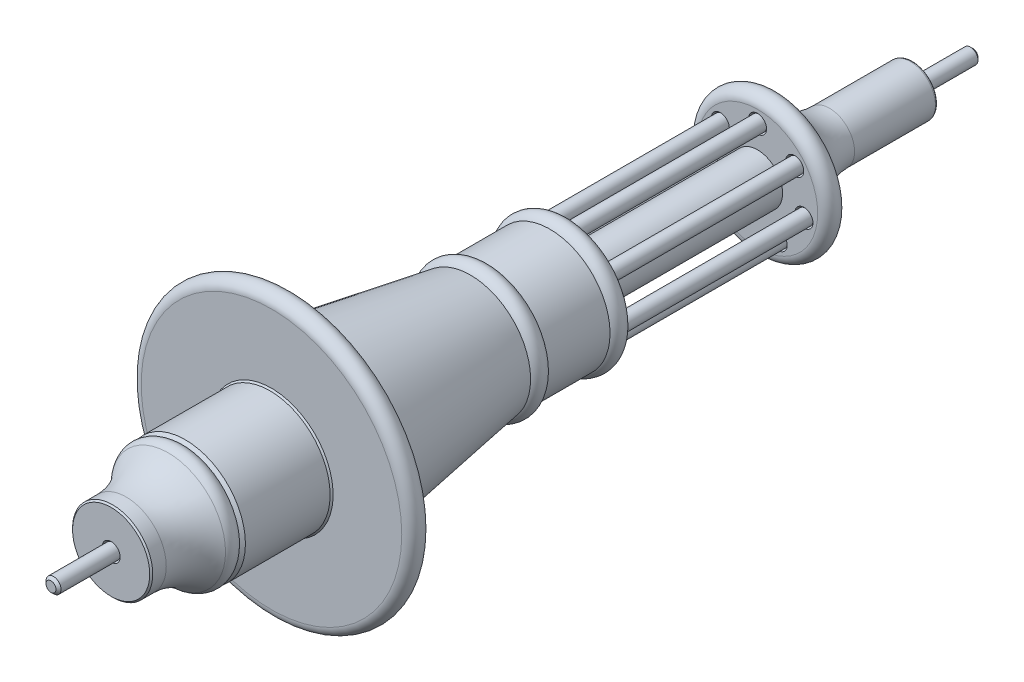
ISO-10303-21;
HEADER;
FILE_DESCRIPTION(('STEP AP214'),'2;1');
FILE_NAME('part.step','',(''),(''),'','','');
FILE_SCHEMA(('AUTOMOTIVE_DESIGN { 1 0 10303 214 1 1 1 1 }'));
ENDSEC;
DATA;
#1=APPLICATION_CONTEXT('core data for automotive mechanical design processes');
#2=APPLICATION_PROTOCOL_DEFINITION('international standard','automotive_design',2000,#1);
#3=PRODUCT_CONTEXT('',#1,'mechanical');
#4=PRODUCT('Part','Part','',(#3));
#5=PRODUCT_RELATED_PRODUCT_CATEGORY('part','',(#4));
#6=PRODUCT_DEFINITION_FORMATION('','',#4);
#7=PRODUCT_DEFINITION_CONTEXT('part definition',#1,'design');
#8=PRODUCT_DEFINITION('design','',#6,#7);
#9=PRODUCT_DEFINITION_SHAPE('','',#8);
#10=(LENGTH_UNIT() NAMED_UNIT(*) SI_UNIT(.MILLI.,.METRE.));
#11=(NAMED_UNIT(*) PLANE_ANGLE_UNIT() SI_UNIT($,.RADIAN.));
#12=(NAMED_UNIT(*) SI_UNIT($,.STERADIAN.) SOLID_ANGLE_UNIT());
#13=UNCERTAINTY_MEASURE_WITH_UNIT(LENGTH_MEASURE(1.E-05),#10,'distance_accuracy_value','');
#14=(GEOMETRIC_REPRESENTATION_CONTEXT(3) GLOBAL_UNCERTAINTY_ASSIGNED_CONTEXT((#13)) GLOBAL_UNIT_ASSIGNED_CONTEXT((#10,
#11,#12)) REPRESENTATION_CONTEXT('',''));
#15=CARTESIAN_POINT('',(0.,0.,0.));
#16=DIRECTION('',(0.,0.,1.));
#17=DIRECTION('',(1.,0.,0.));
#18=AXIS2_PLACEMENT_3D('',#15,#16,#17);
#19=CARTESIAN_POINT('',(0.,0.,6.));
#20=DIRECTION('',(0.,0.,-1.));
#21=DIRECTION('',(-1.,0.,0.));
#22=AXIS2_PLACEMENT_3D('',#19,#20,#21);
#23=PLANE('',#22);
#24=CARTESIAN_POINT('',(0.,0.,6.));
#25=DIRECTION('',(0.,0.,1.));
#26=DIRECTION('',(1.,0.,0.));
#27=AXIS2_PLACEMENT_3D('',#24,#25,#26);
#28=CIRCLE('',#27,0.5);
#29=CARTESIAN_POINT('',(0.5,0.,6.));
#30=VERTEX_POINT('',#29);
#31=EDGE_CURVE('E11',#30,#30,#28,.T.);
#32=ORIENTED_EDGE('',*,*,#31,.T.);
#33=EDGE_LOOP('',(#32));
#34=FACE_BOUND('',#33,.T.);
#35=ADVANCED_FACE('F40',(#34),#23,.F.);
#36=CARTESIAN_POINT('',(0.,0.,5.75));
#37=DIRECTION('',(0.,0.,-1.));
#38=DIRECTION('',(-1.,0.,0.));
#39=AXIS2_PLACEMENT_3D('',#36,#37,#38);
#40=CONICAL_SURFACE('',#39,0.75,0.785398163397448);
#41=ORIENTED_EDGE('',*,*,#31,.F.);
#42=EDGE_LOOP('',(#41));
#43=FACE_BOUND('',#42,.T.);
#44=CARTESIAN_POINT('',(0.,0.,5.75));
#45=DIRECTION('',(0.,0.,1.));
#46=DIRECTION('',(1.,0.,0.));
#47=AXIS2_PLACEMENT_3D('',#44,#45,#46);
#48=CIRCLE('',#47,0.75);
#49=CARTESIAN_POINT('',(0.75,0.,5.75));
#50=VERTEX_POINT('',#49);
#51=EDGE_CURVE('E46',#50,#50,#48,.T.);
#52=ORIENTED_EDGE('',*,*,#51,.T.);
#53=EDGE_LOOP('',(#52));
#54=FACE_BOUND('',#53,.T.);
#55=ADVANCED_FACE('F72',(#43,#54),#40,.T.);
#56=CARTESIAN_POINT('',(0.,0.,6.));
#57=DIRECTION('',(0.,0.,1.));
#58=DIRECTION('',(1.,0.,0.));
#59=AXIS2_PLACEMENT_3D('',#56,#57,#58);
#60=CYLINDRICAL_SURFACE('',#59,0.75);
#61=ORIENTED_EDGE('',*,*,#51,.F.);
#62=EDGE_LOOP('',(#61));
#63=FACE_BOUND('',#62,.T.);
#64=CARTESIAN_POINT('',(0.,0.,-85.75));
#65=DIRECTION('',(0.,0.,1.));
#66=DIRECTION('',(1.,0.,0.));
#67=AXIS2_PLACEMENT_3D('',#64,#65,#66);
#68=CIRCLE('',#67,0.75);
#69=CARTESIAN_POINT('',(0.75,0.,-85.75));
#70=VERTEX_POINT('',#69);
#71=EDGE_CURVE('E50',#70,#70,#68,.T.);
#72=ORIENTED_EDGE('',*,*,#71,.T.);
#73=EDGE_LOOP('',(#72));
#74=FACE_BOUND('',#73,.T.);
#75=ADVANCED_FACE('F68',(#63,#74),#60,.T.);
#76=CARTESIAN_POINT('',(0.,0.,-86.));
#77=DIRECTION('',(0.,0.,1.));
#78=DIRECTION('',(1.,0.,0.));
#79=AXIS2_PLACEMENT_3D('',#76,#77,#78);
#80=CONICAL_SURFACE('',#79,0.5,0.785398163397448);
#81=ORIENTED_EDGE('',*,*,#71,.F.);
#82=EDGE_LOOP('',(#81));
#83=FACE_BOUND('',#82,.T.);
#84=CARTESIAN_POINT('',(0.,0.,-86.));
#85=DIRECTION('',(0.,0.,1.));
#86=DIRECTION('',(1.,0.,0.));
#87=AXIS2_PLACEMENT_3D('',#84,#85,#86);
#88=CIRCLE('',#87,0.5);
#89=CARTESIAN_POINT('',(0.5,0.,-86.));
#90=VERTEX_POINT('',#89);
#91=EDGE_CURVE('E54',#90,#90,#88,.T.);
#92=ORIENTED_EDGE('',*,*,#91,.T.);
#93=EDGE_LOOP('',(#92));
#94=FACE_BOUND('',#93,.T.);
#95=ADVANCED_FACE('F60',(#83,#94),#80,.T.);
#96=CARTESIAN_POINT('',(0.,0.5,-86.));
#97=DIRECTION('',(0.,0.,1.));
#98=DIRECTION('',(1.,0.,0.));
#99=AXIS2_PLACEMENT_3D('',#96,#97,#98);
#100=PLANE('',#99);
#101=ORIENTED_EDGE('',*,*,#91,.F.);
#102=EDGE_LOOP('',(#101));
#103=FACE_BOUND('',#102,.T.);
#104=ADVANCED_FACE('F62',(#103),#100,.F.);
#105=CLOSED_SHELL('',(#35,#55,#75,#95,#104));
#106=MANIFOLD_SOLID_BREP('B2',#105);
#107=CARTESIAN_POINT('',(4.63090758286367,-1.05697443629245,-43.65));
#108=DIRECTION('',(0.,0.,-1.));
#109=DIRECTION('',(-1.,0.,0.));
#110=AXIS2_PLACEMENT_3D('',#107,#108,#109);
#111=PLANE('',#110);
#112=CARTESIAN_POINT('',(4.63090758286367,-1.05697443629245,-43.65));
#113=DIRECTION('',(0.,0.,-1.));
#114=DIRECTION('',(-1.,0.,0.));
#115=AXIS2_PLACEMENT_3D('',#112,#113,#114);
#116=CIRCLE('',#115,0.599999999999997);
#117=CARTESIAN_POINT('',(4.03090758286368,-1.05697443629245,-43.65));
#118=VERTEX_POINT('',#117);
#119=EDGE_CURVE('E126',#118,#118,#116,.F.);
#120=ORIENTED_EDGE('',*,*,#119,.T.);
#121=EDGE_LOOP('',(#120));
#122=FACE_BOUND('',#121,.T.);
#123=ADVANCED_FACE('F119',(#122),#111,.F.);
#124=CARTESIAN_POINT('',(4.63090758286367,-1.05697443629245,-68.6213203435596));
#125=DIRECTION('',(0.,0.,1.));
#126=DIRECTION('',(1.,0.,0.));
#127=AXIS2_PLACEMENT_3D('',#124,#125,#126);
#128=CYLINDRICAL_SURFACE('',#127,0.749999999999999);
#129=CARTESIAN_POINT('',(4.63090758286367,-1.05697443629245,-43.8));
#130=DIRECTION('',(0.,0.,-1.));
#131=DIRECTION('',(-1.,0.,0.));
#132=AXIS2_PLACEMENT_3D('',#129,#130,#131);
#133=CIRCLE('',#132,0.749999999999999);
#134=CARTESIAN_POINT('',(3.88090758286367,-1.05697443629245,-43.8));
#135=VERTEX_POINT('',#134);
#136=EDGE_CURVE('E130',#135,#135,#133,.T.);
#137=ORIENTED_EDGE('',*,*,#136,.T.);
#138=EDGE_LOOP('',(#137));
#139=FACE_BOUND('',#138,.T.);
#140=CARTESIAN_POINT('',(4.63090758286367,-1.05697443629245,-66.35));
#141=DIRECTION('',(0.,0.,1.));
#142=DIRECTION('',(1.,0.,0.));
#143=AXIS2_PLACEMENT_3D('',#140,#141,#142);
#144=CIRCLE('',#143,0.749999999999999);
#145=CARTESIAN_POINT('',(5.38090758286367,-1.05697443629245,-66.35));
#146=VERTEX_POINT('',#145);
#147=EDGE_CURVE('E134',#146,#146,#144,.T.);
#148=ORIENTED_EDGE('',*,*,#147,.T.);
#149=EDGE_LOOP('',(#148));
#150=FACE_BOUND('',#149,.T.);
#151=ADVANCED_FACE('F140',(#139,#150),#128,.T.);
#152=CARTESIAN_POINT('',(0.,4.75,-66.5));
#153=DIRECTION('',(0.,0.,1.));
#154=DIRECTION('',(1.,0.,0.));
#155=AXIS2_PLACEMENT_3D('',#152,#153,#154);
#156=PLANE('',#155);
#157=CARTESIAN_POINT('',(4.63090758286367,-1.05697443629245,-66.5));
#158=DIRECTION('',(0.,0.,1.));
#159=DIRECTION('',(1.,0.,0.));
#160=AXIS2_PLACEMENT_3D('',#157,#158,#159);
#161=CIRCLE('',#160,0.6);
#162=CARTESIAN_POINT('',(5.23090758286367,-1.05697443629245,-66.5));
#163=VERTEX_POINT('',#162);
#164=EDGE_CURVE('E39',#163,#163,#161,.F.);
#165=ORIENTED_EDGE('',*,*,#164,.T.);
#166=EDGE_LOOP('',(#165));
#167=FACE_BOUND('',#166,.T.);
#168=ADVANCED_FACE('F148',(#167),#156,.F.);
#169=CARTESIAN_POINT('',(4.63090758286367,-1.05697443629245,-43.8));
#170=DIRECTION('',(0.,0.,-1.));
#171=DIRECTION('',(-1.,0.,0.));
#172=AXIS2_PLACEMENT_3D('',#169,#170,#171);
#173=CONICAL_SURFACE('',#172,0.749999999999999,0.785398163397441);
#174=ORIENTED_EDGE('',*,*,#119,.F.);
#175=EDGE_LOOP('',(#174));
#176=FACE_BOUND('',#175,.T.);
#177=ORIENTED_EDGE('',*,*,#136,.F.);
#178=EDGE_LOOP('',(#177));
#179=FACE_BOUND('',#178,.T.);
#180=ADVANCED_FACE('F143',(#176,#179),#173,.T.);
#181=CARTESIAN_POINT('',(4.63090758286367,-1.05697443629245,-66.35));
#182=DIRECTION('',(0.,0.,1.));
#183=DIRECTION('',(1.,0.,0.));
#184=AXIS2_PLACEMENT_3D('',#181,#182,#183);
#185=CONICAL_SURFACE('',#184,0.749999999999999,0.785398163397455);
#186=ORIENTED_EDGE('',*,*,#164,.F.);
#187=EDGE_LOOP('',(#186));
#188=FACE_BOUND('',#187,.T.);
#189=ORIENTED_EDGE('',*,*,#147,.F.);
#190=EDGE_LOOP('',(#189));
#191=FACE_BOUND('',#190,.T.);
#192=ADVANCED_FACE('F121',(#188,#191),#185,.T.);
#193=CLOSED_SHELL('',(#123,#151,#168,#180,#192));
#194=MANIFOLD_SOLID_BREP('B6',#193);
#195=CARTESIAN_POINT('',(3.71369954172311,2.96157655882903,-43.65));
#196=DIRECTION('',(0.,0.,-1.));
#197=DIRECTION('',(-1.,0.,0.));
#198=AXIS2_PLACEMENT_3D('',#195,#196,#197);
#199=PLANE('',#198);
#200=CARTESIAN_POINT('',(3.71369954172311,2.96157655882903,-43.65));
#201=DIRECTION('',(0.,0.,-1.));
#202=DIRECTION('',(-1.,0.,0.));
#203=AXIS2_PLACEMENT_3D('',#200,#201,#202);
#204=CIRCLE('',#203,0.599999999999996);
#205=CARTESIAN_POINT('',(3.11369954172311,2.96157655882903,-43.65));
#206=VERTEX_POINT('',#205);
#207=EDGE_CURVE('E205',#206,#206,#204,.F.);
#208=ORIENTED_EDGE('',*,*,#207,.T.);
#209=EDGE_LOOP('',(#208));
#210=FACE_BOUND('',#209,.T.);
#211=ADVANCED_FACE('F198',(#210),#199,.F.);
#212=CARTESIAN_POINT('',(3.71369954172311,2.96157655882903,-68.6213203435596));
#213=DIRECTION('',(0.,0.,1.));
#214=DIRECTION('',(1.,0.,0.));
#215=AXIS2_PLACEMENT_3D('',#212,#213,#214);
#216=CYLINDRICAL_SURFACE('',#215,0.75);
#217=CARTESIAN_POINT('',(3.71369954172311,2.96157655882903,-43.8));
#218=DIRECTION('',(0.,0.,-1.));
#219=DIRECTION('',(-1.,0.,0.));
#220=AXIS2_PLACEMENT_3D('',#217,#218,#219);
#221=CIRCLE('',#220,0.75);
#222=CARTESIAN_POINT('',(2.96369954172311,2.96157655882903,-43.8));
#223=VERTEX_POINT('',#222);
#224=EDGE_CURVE('E209',#223,#223,#221,.T.);
#225=ORIENTED_EDGE('',*,*,#224,.T.);
#226=EDGE_LOOP('',(#225));
#227=FACE_BOUND('',#226,.T.);
#228=CARTESIAN_POINT('',(3.71369954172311,2.96157655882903,-66.35));
#229=DIRECTION('',(0.,0.,1.));
#230=DIRECTION('',(1.,0.,0.));
#231=AXIS2_PLACEMENT_3D('',#228,#229,#230);
#232=CIRCLE('',#231,0.75);
#233=CARTESIAN_POINT('',(4.46369954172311,2.96157655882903,-66.35));
#234=VERTEX_POINT('',#233);
#235=EDGE_CURVE('E213',#234,#234,#232,.T.);
#236=ORIENTED_EDGE('',*,*,#235,.T.);
#237=EDGE_LOOP('',(#236));
#238=FACE_BOUND('',#237,.T.);
#239=ADVANCED_FACE('F219',(#227,#238),#216,.T.);
#240=CARTESIAN_POINT('',(0.,4.75,-66.5));
#241=DIRECTION('',(0.,0.,1.));
#242=DIRECTION('',(1.,0.,0.));
#243=AXIS2_PLACEMENT_3D('',#240,#241,#242);
#244=PLANE('',#243);
#245=CARTESIAN_POINT('',(3.71369954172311,2.96157655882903,-66.5));
#246=DIRECTION('',(0.,0.,1.));
#247=DIRECTION('',(1.,0.,0.));
#248=AXIS2_PLACEMENT_3D('',#245,#246,#247);
#249=CIRCLE('',#248,0.6);
#250=CARTESIAN_POINT('',(4.31369954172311,2.96157655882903,-66.5));
#251=VERTEX_POINT('',#250);
#252=EDGE_CURVE('E118',#251,#251,#249,.F.);
#253=ORIENTED_EDGE('',*,*,#252,.T.);
#254=EDGE_LOOP('',(#253));
#255=FACE_BOUND('',#254,.T.);
#256=ADVANCED_FACE('F227',(#255),#244,.F.);
#257=CARTESIAN_POINT('',(3.71369954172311,2.96157655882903,-43.8));
#258=DIRECTION('',(0.,0.,-1.));
#259=DIRECTION('',(-1.,0.,0.));
#260=AXIS2_PLACEMENT_3D('',#257,#258,#259);
#261=CONICAL_SURFACE('',#260,0.75,0.785398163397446);
#262=ORIENTED_EDGE('',*,*,#207,.F.);
#263=EDGE_LOOP('',(#262));
#264=FACE_BOUND('',#263,.T.);
#265=ORIENTED_EDGE('',*,*,#224,.F.);
#266=EDGE_LOOP('',(#265));
#267=FACE_BOUND('',#266,.T.);
#268=ADVANCED_FACE('F222',(#264,#267),#261,.T.);
#269=CARTESIAN_POINT('',(3.71369954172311,2.96157655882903,-66.35));
#270=DIRECTION('',(0.,0.,1.));
#271=DIRECTION('',(1.,0.,0.));
#272=AXIS2_PLACEMENT_3D('',#269,#270,#271);
#273=CONICAL_SURFACE('',#272,0.75,0.785398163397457);
#274=ORIENTED_EDGE('',*,*,#252,.F.);
#275=EDGE_LOOP('',(#274));
#276=FACE_BOUND('',#275,.T.);
#277=ORIENTED_EDGE('',*,*,#235,.F.);
#278=EDGE_LOOP('',(#277));
#279=FACE_BOUND('',#278,.T.);
#280=ADVANCED_FACE('F200',(#276,#279),#273,.T.);
#281=CLOSED_SHELL('',(#211,#239,#256,#268,#280));
#282=MANIFOLD_SOLID_BREP('B34',#281);
#283=CARTESIAN_POINT('',(0.,4.75,-43.65));
#284=DIRECTION('',(0.,0.,-1.));
#285=DIRECTION('',(-1.,0.,0.));
#286=AXIS2_PLACEMENT_3D('',#283,#284,#285);
#287=PLANE('',#286);
#288=CARTESIAN_POINT('',(0.,4.75,-43.65));
#289=DIRECTION('',(0.,0.,-1.));
#290=DIRECTION('',(-1.,0.,0.));
#291=AXIS2_PLACEMENT_3D('',#288,#289,#290);
#292=CIRCLE('',#291,0.599999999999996);
#293=CARTESIAN_POINT('',(-0.599999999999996,4.75,-43.65));
#294=VERTEX_POINT('',#293);
#295=EDGE_CURVE('E284',#294,#294,#292,.F.);
#296=ORIENTED_EDGE('',*,*,#295,.T.);
#297=EDGE_LOOP('',(#296));
#298=FACE_BOUND('',#297,.T.);
#299=ADVANCED_FACE('F277',(#298),#287,.F.);
#300=CARTESIAN_POINT('',(0.,4.75,-68.6213203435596));
#301=DIRECTION('',(0.,0.,1.));
#302=DIRECTION('',(1.,0.,0.));
#303=AXIS2_PLACEMENT_3D('',#300,#301,#302);
#304=CYLINDRICAL_SURFACE('',#303,0.75);
#305=CARTESIAN_POINT('',(0.,4.75,-43.8));
#306=DIRECTION('',(0.,0.,-1.));
#307=DIRECTION('',(-1.,0.,0.));
#308=AXIS2_PLACEMENT_3D('',#305,#306,#307);
#309=CIRCLE('',#308,0.75);
#310=CARTESIAN_POINT('',(-0.75,4.75,-43.8));
#311=VERTEX_POINT('',#310);
#312=EDGE_CURVE('E288',#311,#311,#309,.T.);
#313=ORIENTED_EDGE('',*,*,#312,.T.);
#314=EDGE_LOOP('',(#313));
#315=FACE_BOUND('',#314,.T.);
#316=CARTESIAN_POINT('',(0.,4.75,-66.35));
#317=DIRECTION('',(0.,0.,1.));
#318=DIRECTION('',(1.,0.,0.));
#319=AXIS2_PLACEMENT_3D('',#316,#317,#318);
#320=CIRCLE('',#319,0.75);
#321=CARTESIAN_POINT('',(0.75,4.75,-66.35));
#322=VERTEX_POINT('',#321);
#323=EDGE_CURVE('E292',#322,#322,#320,.T.);
#324=ORIENTED_EDGE('',*,*,#323,.T.);
#325=EDGE_LOOP('',(#324));
#326=FACE_BOUND('',#325,.T.);
#327=ADVANCED_FACE('F298',(#315,#326),#304,.T.);
#328=CARTESIAN_POINT('',(0.,4.75,-66.5));
#329=DIRECTION('',(0.,0.,1.));
#330=DIRECTION('',(1.,0.,0.));
#331=AXIS2_PLACEMENT_3D('',#328,#329,#330);
#332=PLANE('',#331);
#333=CARTESIAN_POINT('',(0.,4.75,-66.5));
#334=DIRECTION('',(0.,0.,1.));
#335=DIRECTION('',(1.,0.,0.));
#336=AXIS2_PLACEMENT_3D('',#333,#334,#335);
#337=CIRCLE('',#336,0.6);
#338=CARTESIAN_POINT('',(0.6,4.75,-66.5));
#339=VERTEX_POINT('',#338);
#340=EDGE_CURVE('E197',#339,#339,#337,.F.);
#341=ORIENTED_EDGE('',*,*,#340,.T.);
#342=EDGE_LOOP('',(#341));
#343=FACE_BOUND('',#342,.T.);
#344=ADVANCED_FACE('F306',(#343),#332,.F.);
#345=CARTESIAN_POINT('',(0.,4.75,-43.8));
#346=DIRECTION('',(0.,0.,-1.));
#347=DIRECTION('',(-1.,0.,0.));
#348=AXIS2_PLACEMENT_3D('',#345,#346,#347);
#349=CONICAL_SURFACE('',#348,0.75,0.785398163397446);
#350=ORIENTED_EDGE('',*,*,#295,.F.);
#351=EDGE_LOOP('',(#350));
#352=FACE_BOUND('',#351,.T.);
#353=ORIENTED_EDGE('',*,*,#312,.F.);
#354=EDGE_LOOP('',(#353));
#355=FACE_BOUND('',#354,.T.);
#356=ADVANCED_FACE('F301',(#352,#355),#349,.T.);
#357=CARTESIAN_POINT('',(0.,4.75,-66.35));
#358=DIRECTION('',(0.,0.,1.));
#359=DIRECTION('',(1.,0.,0.));
#360=AXIS2_PLACEMENT_3D('',#357,#358,#359);
#361=CONICAL_SURFACE('',#360,0.75,0.785398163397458);
#362=ORIENTED_EDGE('',*,*,#340,.F.);
#363=EDGE_LOOP('',(#362));
#364=FACE_BOUND('',#363,.T.);
#365=ORIENTED_EDGE('',*,*,#323,.F.);
#366=EDGE_LOOP('',(#365));
#367=FACE_BOUND('',#366,.T.);
#368=ADVANCED_FACE('F279',(#364,#367),#361,.T.);
#369=CLOSED_SHELL('',(#299,#327,#344,#356,#368));
#370=MANIFOLD_SOLID_BREP('B113',#369);
#371=CARTESIAN_POINT('',(-3.71369954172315,2.96157655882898,-43.65));
#372=DIRECTION('',(0.,0.,-1.));
#373=DIRECTION('',(-1.,0.,0.));
#374=AXIS2_PLACEMENT_3D('',#371,#372,#373);
#375=PLANE('',#374);
#376=CARTESIAN_POINT('',(-3.71369954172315,2.96157655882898,-43.65));
#377=DIRECTION('',(0.,0.,-1.));
#378=DIRECTION('',(-1.,0.,0.));
#379=AXIS2_PLACEMENT_3D('',#376,#377,#378);
#380=CIRCLE('',#379,0.6);
#381=CARTESIAN_POINT('',(-4.31369954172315,2.96157655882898,-43.65));
#382=VERTEX_POINT('',#381);
#383=EDGE_CURVE('E363',#382,#382,#380,.F.);
#384=ORIENTED_EDGE('',*,*,#383,.T.);
#385=EDGE_LOOP('',(#384));
#386=FACE_BOUND('',#385,.T.);
#387=ADVANCED_FACE('F356',(#386),#375,.F.);
#388=CARTESIAN_POINT('',(-3.71369954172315,2.96157655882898,-68.6213203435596));
#389=DIRECTION('',(0.,0.,1.));
#390=DIRECTION('',(1.,0.,0.));
#391=AXIS2_PLACEMENT_3D('',#388,#389,#390);
#392=CYLINDRICAL_SURFACE('',#391,0.749999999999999);
#393=CARTESIAN_POINT('',(-3.71369954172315,2.96157655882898,-43.8));
#394=DIRECTION('',(0.,0.,-1.));
#395=DIRECTION('',(-1.,0.,0.));
#396=AXIS2_PLACEMENT_3D('',#393,#394,#395);
#397=CIRCLE('',#396,0.749999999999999);
#398=CARTESIAN_POINT('',(-4.46369954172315,2.96157655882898,-43.8));
#399=VERTEX_POINT('',#398);
#400=EDGE_CURVE('E367',#399,#399,#397,.T.);
#401=ORIENTED_EDGE('',*,*,#400,.T.);
#402=EDGE_LOOP('',(#401));
#403=FACE_BOUND('',#402,.T.);
#404=CARTESIAN_POINT('',(-3.71369954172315,2.96157655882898,-66.35));
#405=DIRECTION('',(0.,0.,1.));
#406=DIRECTION('',(1.,0.,0.));
#407=AXIS2_PLACEMENT_3D('',#404,#405,#406);
#408=CIRCLE('',#407,0.749999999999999);
#409=CARTESIAN_POINT('',(-2.96369954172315,2.96157655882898,-66.35));
#410=VERTEX_POINT('',#409);
#411=EDGE_CURVE('E371',#410,#410,#408,.T.);
#412=ORIENTED_EDGE('',*,*,#411,.T.);
#413=EDGE_LOOP('',(#412));
#414=FACE_BOUND('',#413,.T.);
#415=ADVANCED_FACE('F377',(#403,#414),#392,.T.);
#416=CARTESIAN_POINT('',(0.,4.75,-66.5));
#417=DIRECTION('',(0.,0.,1.));
#418=DIRECTION('',(1.,0.,0.));
#419=AXIS2_PLACEMENT_3D('',#416,#417,#418);
#420=PLANE('',#419);
#421=CARTESIAN_POINT('',(-3.71369954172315,2.96157655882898,-66.5));
#422=DIRECTION('',(0.,0.,1.));
#423=DIRECTION('',(1.,0.,0.));
#424=AXIS2_PLACEMENT_3D('',#421,#422,#423);
#425=CIRCLE('',#424,0.600000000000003);
#426=CARTESIAN_POINT('',(-3.11369954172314,2.96157655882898,-66.5));
#427=VERTEX_POINT('',#426);
#428=EDGE_CURVE('E276',#427,#427,#425,.F.);
#429=ORIENTED_EDGE('',*,*,#428,.T.);
#430=EDGE_LOOP('',(#429));
#431=FACE_BOUND('',#430,.T.);
#432=ADVANCED_FACE('F385',(#431),#420,.F.);
#433=CARTESIAN_POINT('',(-3.71369954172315,2.96157655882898,-43.8));
#434=DIRECTION('',(0.,0.,-1.));
#435=DIRECTION('',(-1.,0.,0.));
#436=AXIS2_PLACEMENT_3D('',#433,#434,#435);
#437=CONICAL_SURFACE('',#436,0.749999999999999,0.785398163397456);
#438=ORIENTED_EDGE('',*,*,#383,.F.);
#439=EDGE_LOOP('',(#438));
#440=FACE_BOUND('',#439,.T.);
#441=ORIENTED_EDGE('',*,*,#400,.F.);
#442=EDGE_LOOP('',(#441));
#443=FACE_BOUND('',#442,.T.);
#444=ADVANCED_FACE('F380',(#440,#443),#437,.T.);
#445=CARTESIAN_POINT('',(-3.71369954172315,2.96157655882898,-66.35));
#446=DIRECTION('',(0.,0.,1.));
#447=DIRECTION('',(1.,0.,0.));
#448=AXIS2_PLACEMENT_3D('',#445,#446,#447);
#449=CONICAL_SURFACE('',#448,0.749999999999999,0.785398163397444);
#450=ORIENTED_EDGE('',*,*,#428,.F.);
#451=EDGE_LOOP('',(#450));
#452=FACE_BOUND('',#451,.T.);
#453=ORIENTED_EDGE('',*,*,#411,.F.);
#454=EDGE_LOOP('',(#453));
#455=FACE_BOUND('',#454,.T.);
#456=ADVANCED_FACE('F358',(#452,#455),#449,.T.);
#457=CLOSED_SHELL('',(#387,#415,#432,#444,#456));
#458=MANIFOLD_SOLID_BREP('B192',#457);
#459=CARTESIAN_POINT('',(-4.63090758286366,-1.05697443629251,-43.65));
#460=DIRECTION('',(0.,0.,-1.));
#461=DIRECTION('',(-1.,0.,0.));
#462=AXIS2_PLACEMENT_3D('',#459,#460,#461);
#463=PLANE('',#462);
#464=CARTESIAN_POINT('',(-4.63090758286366,-1.05697443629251,-43.65));
#465=DIRECTION('',(0.,0.,-1.));
#466=DIRECTION('',(-1.,0.,0.));
#467=AXIS2_PLACEMENT_3D('',#464,#465,#466);
#468=CIRCLE('',#467,0.599999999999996);
#469=CARTESIAN_POINT('',(-5.23090758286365,-1.05697443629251,-43.65));
#470=VERTEX_POINT('',#469);
#471=EDGE_CURVE('E442',#470,#470,#468,.F.);
#472=ORIENTED_EDGE('',*,*,#471,.T.);
#473=EDGE_LOOP('',(#472));
#474=FACE_BOUND('',#473,.T.);
#475=ADVANCED_FACE('F435',(#474),#463,.F.);
#476=CARTESIAN_POINT('',(-4.63090758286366,-1.05697443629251,-68.6213203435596));
#477=DIRECTION('',(0.,0.,1.));
#478=DIRECTION('',(1.,0.,0.));
#479=AXIS2_PLACEMENT_3D('',#476,#477,#478);
#480=CYLINDRICAL_SURFACE('',#479,0.75);
#481=CARTESIAN_POINT('',(-4.63090758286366,-1.05697443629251,-43.8));
#482=DIRECTION('',(0.,0.,-1.));
#483=DIRECTION('',(-1.,0.,0.));
#484=AXIS2_PLACEMENT_3D('',#481,#482,#483);
#485=CIRCLE('',#484,0.75);
#486=CARTESIAN_POINT('',(-5.38090758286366,-1.05697443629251,-43.8));
#487=VERTEX_POINT('',#486);
#488=EDGE_CURVE('E446',#487,#487,#485,.T.);
#489=ORIENTED_EDGE('',*,*,#488,.T.);
#490=EDGE_LOOP('',(#489));
#491=FACE_BOUND('',#490,.T.);
#492=CARTESIAN_POINT('',(-4.63090758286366,-1.05697443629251,-66.35));
#493=DIRECTION('',(0.,0.,1.));
#494=DIRECTION('',(1.,0.,0.));
#495=AXIS2_PLACEMENT_3D('',#492,#493,#494);
#496=CIRCLE('',#495,0.75);
#497=CARTESIAN_POINT('',(-3.88090758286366,-1.05697443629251,-66.35));
#498=VERTEX_POINT('',#497);
#499=EDGE_CURVE('E450',#498,#498,#496,.T.);
#500=ORIENTED_EDGE('',*,*,#499,.T.);
#501=EDGE_LOOP('',(#500));
#502=FACE_BOUND('',#501,.T.);
#503=ADVANCED_FACE('F456',(#491,#502),#480,.T.);
#504=CARTESIAN_POINT('',(0.,4.75,-66.5));
#505=DIRECTION('',(0.,0.,1.));
#506=DIRECTION('',(1.,0.,0.));
#507=AXIS2_PLACEMENT_3D('',#504,#505,#506);
#508=PLANE('',#507);
#509=CARTESIAN_POINT('',(-4.63090758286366,-1.05697443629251,-66.5));
#510=DIRECTION('',(0.,0.,1.));
#511=DIRECTION('',(1.,0.,0.));
#512=AXIS2_PLACEMENT_3D('',#509,#510,#511);
#513=CIRCLE('',#512,0.600000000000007);
#514=CARTESIAN_POINT('',(-4.03090758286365,-1.05697443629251,-66.5));
#515=VERTEX_POINT('',#514);
#516=EDGE_CURVE('E355',#515,#515,#513,.F.);
#517=ORIENTED_EDGE('',*,*,#516,.T.);
#518=EDGE_LOOP('',(#517));
#519=FACE_BOUND('',#518,.T.);
#520=ADVANCED_FACE('F464',(#519),#508,.F.);
#521=CARTESIAN_POINT('',(-4.63090758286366,-1.05697443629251,-43.8));
#522=DIRECTION('',(0.,0.,-1.));
#523=DIRECTION('',(-1.,0.,0.));
#524=AXIS2_PLACEMENT_3D('',#521,#522,#523);
#525=CONICAL_SURFACE('',#524,0.75,0.785398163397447);
#526=ORIENTED_EDGE('',*,*,#471,.F.);
#527=EDGE_LOOP('',(#526));
#528=FACE_BOUND('',#527,.T.);
#529=ORIENTED_EDGE('',*,*,#488,.F.);
#530=EDGE_LOOP('',(#529));
#531=FACE_BOUND('',#530,.T.);
#532=ADVANCED_FACE('F459',(#528,#531),#525,.T.);
#533=CARTESIAN_POINT('',(-4.63090758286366,-1.05697443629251,-66.35));
#534=DIRECTION('',(0.,0.,1.));
#535=DIRECTION('',(1.,0.,0.));
#536=AXIS2_PLACEMENT_3D('',#533,#534,#535);
#537=CONICAL_SURFACE('',#536,0.75,0.785398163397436);
#538=ORIENTED_EDGE('',*,*,#516,.F.);
#539=EDGE_LOOP('',(#538));
#540=FACE_BOUND('',#539,.T.);
#541=ORIENTED_EDGE('',*,*,#499,.F.);
#542=EDGE_LOOP('',(#541));
#543=FACE_BOUND('',#542,.T.);
#544=ADVANCED_FACE('F437',(#540,#543),#537,.T.);
#545=CLOSED_SHELL('',(#475,#503,#520,#532,#544));
#546=MANIFOLD_SOLID_BREP('B271',#545);
#547=CARTESIAN_POINT('',(-2.06094776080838,-4.27960212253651,-43.65));
#548=DIRECTION('',(0.,0.,-1.));
#549=DIRECTION('',(-1.,0.,0.));
#550=AXIS2_PLACEMENT_3D('',#547,#548,#549);
#551=PLANE('',#550);
#552=CARTESIAN_POINT('',(-2.06094776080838,-4.27960212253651,-43.65));
#553=DIRECTION('',(0.,0.,-1.));
#554=DIRECTION('',(-1.,0.,0.));
#555=AXIS2_PLACEMENT_3D('',#552,#553,#554);
#556=CIRCLE('',#555,0.599999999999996);
#557=CARTESIAN_POINT('',(-2.66094776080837,-4.27960212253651,-43.65));
#558=VERTEX_POINT('',#557);
#559=EDGE_CURVE('E521',#558,#558,#556,.F.);
#560=ORIENTED_EDGE('',*,*,#559,.T.);
#561=EDGE_LOOP('',(#560));
#562=FACE_BOUND('',#561,.T.);
#563=ADVANCED_FACE('F514',(#562),#551,.F.);
#564=CARTESIAN_POINT('',(-2.06094776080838,-4.27960212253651,-68.6213203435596));
#565=DIRECTION('',(0.,0.,1.));
#566=DIRECTION('',(1.,0.,0.));
#567=AXIS2_PLACEMENT_3D('',#564,#565,#566);
#568=CYLINDRICAL_SURFACE('',#567,0.75);
#569=CARTESIAN_POINT('',(-2.06094776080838,-4.27960212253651,-43.8));
#570=DIRECTION('',(0.,0.,-1.));
#571=DIRECTION('',(-1.,0.,0.));
#572=AXIS2_PLACEMENT_3D('',#569,#570,#571);
#573=CIRCLE('',#572,0.75);
#574=CARTESIAN_POINT('',(-2.81094776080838,-4.27960212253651,-43.8));
#575=VERTEX_POINT('',#574);
#576=EDGE_CURVE('E525',#575,#575,#573,.T.);
#577=ORIENTED_EDGE('',*,*,#576,.T.);
#578=EDGE_LOOP('',(#577));
#579=FACE_BOUND('',#578,.T.);
#580=CARTESIAN_POINT('',(-2.06094776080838,-4.27960212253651,-66.35));
#581=DIRECTION('',(0.,0.,1.));
#582=DIRECTION('',(1.,0.,0.));
#583=AXIS2_PLACEMENT_3D('',#580,#581,#582);
#584=CIRCLE('',#583,0.75);
#585=CARTESIAN_POINT('',(-1.31094776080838,-4.27960212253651,-66.35));
#586=VERTEX_POINT('',#585);
#587=EDGE_CURVE('E529',#586,#586,#584,.T.);
#588=ORIENTED_EDGE('',*,*,#587,.T.);
#589=EDGE_LOOP('',(#588));
#590=FACE_BOUND('',#589,.T.);
#591=ADVANCED_FACE('F535',(#579,#590),#568,.T.);
#592=CARTESIAN_POINT('',(0.,4.75,-66.5));
#593=DIRECTION('',(0.,0.,1.));
#594=DIRECTION('',(1.,0.,0.));
#595=AXIS2_PLACEMENT_3D('',#592,#593,#594);
#596=PLANE('',#595);
#597=CARTESIAN_POINT('',(-2.06094776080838,-4.27960212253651,-66.5));
#598=DIRECTION('',(0.,0.,1.));
#599=DIRECTION('',(1.,0.,0.));
#600=AXIS2_PLACEMENT_3D('',#597,#598,#599);
#601=CIRCLE('',#600,0.6);
#602=CARTESIAN_POINT('',(-1.46094776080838,-4.27960212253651,-66.5));
#603=VERTEX_POINT('',#602);
#604=EDGE_CURVE('E434',#603,#603,#601,.F.);
#605=ORIENTED_EDGE('',*,*,#604,.T.);
#606=EDGE_LOOP('',(#605));
#607=FACE_BOUND('',#606,.T.);
#608=ADVANCED_FACE('F543',(#607),#596,.F.);
#609=CARTESIAN_POINT('',(-2.06094776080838,-4.27960212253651,-43.8));
#610=DIRECTION('',(0.,0.,-1.));
#611=DIRECTION('',(-1.,0.,0.));
#612=AXIS2_PLACEMENT_3D('',#609,#610,#611);
#613=CONICAL_SURFACE('',#612,0.75,0.785398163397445);
#614=ORIENTED_EDGE('',*,*,#559,.F.);
#615=EDGE_LOOP('',(#614));
#616=FACE_BOUND('',#615,.T.);
#617=ORIENTED_EDGE('',*,*,#576,.F.);
#618=EDGE_LOOP('',(#617));
#619=FACE_BOUND('',#618,.T.);
#620=ADVANCED_FACE('F538',(#616,#619),#613,.T.);
#621=CARTESIAN_POINT('',(-2.06094776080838,-4.27960212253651,-66.35));
#622=DIRECTION('',(0.,0.,1.));
#623=DIRECTION('',(1.,0.,0.));
#624=AXIS2_PLACEMENT_3D('',#621,#622,#623);
#625=CONICAL_SURFACE('',#624,0.75,0.785398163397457);
#626=ORIENTED_EDGE('',*,*,#604,.F.);
#627=EDGE_LOOP('',(#626));
#628=FACE_BOUND('',#627,.T.);
#629=ORIENTED_EDGE('',*,*,#587,.F.);
#630=EDGE_LOOP('',(#629));
#631=FACE_BOUND('',#630,.T.);
#632=ADVANCED_FACE('F516',(#628,#631),#625,.T.);
#633=CLOSED_SHELL('',(#563,#591,#608,#620,#632));
#634=MANIFOLD_SOLID_BREP('B350',#633);
#635=CARTESIAN_POINT('',(2.06094776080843,-4.27960212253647,-43.65));
#636=DIRECTION('',(0.,0.,-1.));
#637=DIRECTION('',(-1.,0.,0.));
#638=AXIS2_PLACEMENT_3D('',#635,#636,#637);
#639=PLANE('',#638);
#640=CARTESIAN_POINT('',(2.06094776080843,-4.27960212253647,-43.65));
#641=DIRECTION('',(0.,0.,-1.));
#642=DIRECTION('',(-1.,0.,0.));
#643=AXIS2_PLACEMENT_3D('',#640,#641,#642);
#644=CIRCLE('',#643,0.599999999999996);
#645=CARTESIAN_POINT('',(1.46094776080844,-4.27960212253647,-43.65));
#646=VERTEX_POINT('',#645);
#647=EDGE_CURVE('E600',#646,#646,#644,.F.);
#648=ORIENTED_EDGE('',*,*,#647,.T.);
#649=EDGE_LOOP('',(#648));
#650=FACE_BOUND('',#649,.T.);
#651=ADVANCED_FACE('F593',(#650),#639,.F.);
#652=CARTESIAN_POINT('',(2.06094776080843,-4.27960212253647,-68.6213203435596));
#653=DIRECTION('',(0.,0.,1.));
#654=DIRECTION('',(1.,0.,0.));
#655=AXIS2_PLACEMENT_3D('',#652,#653,#654);
#656=CYLINDRICAL_SURFACE('',#655,0.75);
#657=CARTESIAN_POINT('',(2.06094776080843,-4.27960212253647,-43.8));
#658=DIRECTION('',(0.,0.,-1.));
#659=DIRECTION('',(-1.,0.,0.));
#660=AXIS2_PLACEMENT_3D('',#657,#658,#659);
#661=CIRCLE('',#660,0.75);
#662=CARTESIAN_POINT('',(1.31094776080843,-4.27960212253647,-43.8));
#663=VERTEX_POINT('',#662);
#664=EDGE_CURVE('E604',#663,#663,#661,.T.);
#665=ORIENTED_EDGE('',*,*,#664,.T.);
#666=EDGE_LOOP('',(#665));
#667=FACE_BOUND('',#666,.T.);
#668=CARTESIAN_POINT('',(2.06094776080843,-4.27960212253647,-66.35));
#669=DIRECTION('',(0.,0.,1.));
#670=DIRECTION('',(1.,0.,0.));
#671=AXIS2_PLACEMENT_3D('',#668,#669,#670);
#672=CIRCLE('',#671,0.75);
#673=CARTESIAN_POINT('',(2.81094776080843,-4.27960212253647,-66.35));
#674=VERTEX_POINT('',#673);
#675=EDGE_CURVE('E608',#674,#674,#672,.T.);
#676=ORIENTED_EDGE('',*,*,#675,.T.);
#677=EDGE_LOOP('',(#676));
#678=FACE_BOUND('',#677,.T.);
#679=ADVANCED_FACE('F614',(#667,#678),#656,.T.);
#680=CARTESIAN_POINT('',(0.,4.75,-66.5));
#681=DIRECTION('',(0.,0.,1.));
#682=DIRECTION('',(1.,0.,0.));
#683=AXIS2_PLACEMENT_3D('',#680,#681,#682);
#684=PLANE('',#683);
#685=CARTESIAN_POINT('',(2.06094776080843,-4.27960212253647,-66.5));
#686=DIRECTION('',(0.,0.,1.));
#687=DIRECTION('',(1.,0.,0.));
#688=AXIS2_PLACEMENT_3D('',#685,#686,#687);
#689=CIRCLE('',#688,0.6);
#690=CARTESIAN_POINT('',(2.66094776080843,-4.27960212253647,-66.5));
#691=VERTEX_POINT('',#690);
#692=EDGE_CURVE('E513',#691,#691,#689,.F.);
#693=ORIENTED_EDGE('',*,*,#692,.T.);
#694=EDGE_LOOP('',(#693));
#695=FACE_BOUND('',#694,.T.);
#696=ADVANCED_FACE('F622',(#695),#684,.F.);
#697=CARTESIAN_POINT('',(2.06094776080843,-4.27960212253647,-43.8));
#698=DIRECTION('',(0.,0.,-1.));
#699=DIRECTION('',(-1.,0.,0.));
#700=AXIS2_PLACEMENT_3D('',#697,#698,#699);
#701=CONICAL_SURFACE('',#700,0.75,0.785398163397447);
#702=ORIENTED_EDGE('',*,*,#647,.F.);
#703=EDGE_LOOP('',(#702));
#704=FACE_BOUND('',#703,.T.);
#705=ORIENTED_EDGE('',*,*,#664,.F.);
#706=EDGE_LOOP('',(#705));
#707=FACE_BOUND('',#706,.T.);
#708=ADVANCED_FACE('F617',(#704,#707),#701,.T.);
#709=CARTESIAN_POINT('',(2.06094776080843,-4.27960212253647,-66.35));
#710=DIRECTION('',(0.,0.,1.));
#711=DIRECTION('',(1.,0.,0.));
#712=AXIS2_PLACEMENT_3D('',#709,#710,#711);
#713=CONICAL_SURFACE('',#712,0.75,0.785398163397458);
#714=ORIENTED_EDGE('',*,*,#692,.F.);
#715=EDGE_LOOP('',(#714));
#716=FACE_BOUND('',#715,.T.);
#717=ORIENTED_EDGE('',*,*,#675,.F.);
#718=EDGE_LOOP('',(#717));
#719=FACE_BOUND('',#718,.T.);
#720=ADVANCED_FACE('F595',(#716,#719),#713,.T.);
#721=CLOSED_SHELL('',(#651,#679,#696,#708,#720));
#722=MANIFOLD_SOLID_BREP('B429',#721);
#723=CARTESIAN_POINT('',(0.,2.5,-64.5));
#724=DIRECTION('',(0.,0.,-1.));
#725=DIRECTION('',(-1.,0.,0.));
#726=AXIS2_PLACEMENT_3D('',#723,#724,#725);
#727=PLANE('',#726);
#728=CARTESIAN_POINT('',(-2.06094776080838,-4.27960212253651,-64.5));
#729=DIRECTION('',(0.,0.,-1.));
#730=DIRECTION('',(-1.,0.,0.));
#731=AXIS2_PLACEMENT_3D('',#728,#729,#730);
#732=CIRCLE('',#731,0.900000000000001);
#733=CARTESIAN_POINT('',(-2.96094776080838,-4.27960212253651,-64.5));
#734=VERTEX_POINT('',#733);
#735=EDGE_CURVE('E738',#734,#734,#732,.T.);
#736=ORIENTED_EDGE('',*,*,#735,.T.);
#737=EDGE_LOOP('',(#736));
#738=FACE_BOUND('',#737,.T.);
#739=CARTESIAN_POINT('',(-4.63090758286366,-1.05697443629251,-64.5));
#740=DIRECTION('',(0.,0.,-1.));
#741=DIRECTION('',(-1.,0.,0.));
#742=AXIS2_PLACEMENT_3D('',#739,#740,#741);
#743=CIRCLE('',#742,0.900000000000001);
#744=CARTESIAN_POINT('',(-5.53090758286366,-1.05697443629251,-64.5));
#745=VERTEX_POINT('',#744);
#746=EDGE_CURVE('E741',#745,#745,#743,.T.);
#747=ORIENTED_EDGE('',*,*,#746,.T.);
#748=EDGE_LOOP('',(#747));
#749=FACE_BOUND('',#748,.T.);
#750=CARTESIAN_POINT('',(2.06094776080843,-4.27960212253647,-64.5));
#751=DIRECTION('',(0.,0.,-1.));
#752=DIRECTION('',(-1.,0.,0.));
#753=AXIS2_PLACEMENT_3D('',#750,#751,#752);
#754=CIRCLE('',#753,0.900000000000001);
#755=CARTESIAN_POINT('',(1.16094776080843,-4.27960212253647,-64.5));
#756=VERTEX_POINT('',#755);
#757=EDGE_CURVE('E744',#756,#756,#754,.T.);
#758=ORIENTED_EDGE('',*,*,#757,.T.);
#759=EDGE_LOOP('',(#758));
#760=FACE_BOUND('',#759,.T.);
#761=CARTESIAN_POINT('',(4.63090758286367,-1.05697443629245,-64.5));
#762=DIRECTION('',(0.,0.,-1.));
#763=DIRECTION('',(-1.,0.,0.));
#764=AXIS2_PLACEMENT_3D('',#761,#762,#763);
#765=CIRCLE('',#764,0.900000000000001);
#766=CARTESIAN_POINT('',(3.73090758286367,-1.05697443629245,-64.5));
#767=VERTEX_POINT('',#766);
#768=EDGE_CURVE('E747',#767,#767,#765,.T.);
#769=ORIENTED_EDGE('',*,*,#768,.T.);
#770=EDGE_LOOP('',(#769));
#771=FACE_BOUND('',#770,.T.);
#772=CARTESIAN_POINT('',(3.71369954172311,2.96157655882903,-64.5));
#773=DIRECTION('',(0.,0.,-1.));
#774=DIRECTION('',(-1.,0.,0.));
#775=AXIS2_PLACEMENT_3D('',#772,#773,#774);
#776=CIRCLE('',#775,0.899999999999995);
#777=CARTESIAN_POINT('',(2.81369954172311,2.96157655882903,-64.5));
#778=VERTEX_POINT('',#777);
#779=EDGE_CURVE('E750',#778,#778,#776,.T.);
#780=ORIENTED_EDGE('',*,*,#779,.T.);
#781=EDGE_LOOP('',(#780));
#782=FACE_BOUND('',#781,.T.);
#783=CARTESIAN_POINT('',(0.,4.75,-64.5));
#784=DIRECTION('',(0.,0.,-1.));
#785=DIRECTION('',(-1.,0.,0.));
#786=AXIS2_PLACEMENT_3D('',#783,#784,#785);
#787=CIRCLE('',#786,0.900000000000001);
#788=CARTESIAN_POINT('',(-0.900000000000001,4.75,-64.5));
#789=VERTEX_POINT('',#788);
#790=EDGE_CURVE('E753',#789,#789,#787,.T.);
#791=ORIENTED_EDGE('',*,*,#790,.T.);
#792=EDGE_LOOP('',(#791));
#793=FACE_BOUND('',#792,.T.);
#794=CARTESIAN_POINT('',(-3.71369954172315,2.96157655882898,-64.5));
#795=DIRECTION('',(0.,0.,-1.));
#796=DIRECTION('',(-1.,0.,0.));
#797=AXIS2_PLACEMENT_3D('',#794,#795,#796);
#798=CIRCLE('',#797,0.900000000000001);
#799=CARTESIAN_POINT('',(-4.61369954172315,2.96157655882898,-64.5));
#800=VERTEX_POINT('',#799);
#801=EDGE_CURVE('E756',#800,#800,#798,.T.);
#802=ORIENTED_EDGE('',*,*,#801,.T.);
#803=EDGE_LOOP('',(#802));
#804=FACE_BOUND('',#803,.T.);
#805=CARTESIAN_POINT('',(0.,0.,-64.5));
#806=DIRECTION('',(0.,0.,1.));
#807=DIRECTION('',(1.,0.,0.));
#808=AXIS2_PLACEMENT_3D('',#805,#806,#807);
#809=CIRCLE('',#808,2.5);
#810=CARTESIAN_POINT('',(2.5,0.,-64.5));
#811=VERTEX_POINT('',#810);
#812=EDGE_CURVE('E765',#811,#811,#809,.T.);
#813=ORIENTED_EDGE('',*,*,#812,.F.);
#814=EDGE_LOOP('',(#813));
#815=FACE_BOUND('',#814,.T.);
#816=CARTESIAN_POINT('',(0.,0.,-64.5));
#817=DIRECTION('',(0.,0.,1.));
#818=DIRECTION('',(1.,0.,0.));
#819=AXIS2_PLACEMENT_3D('',#816,#817,#818);
#820=CIRCLE('',#819,6.);
#821=CARTESIAN_POINT('',(6.,0.,-64.5));
#822=VERTEX_POINT('',#821);
#823=EDGE_CURVE('E807',#822,#822,#820,.T.);
#824=ORIENTED_EDGE('',*,*,#823,.T.);
#825=EDGE_LOOP('',(#824));
#826=FACE_BOUND('',#825,.T.);
#827=ADVANCED_FACE('F673',(#738,#749,#760,#771,#782,#793,#804,#815,#826),#727,.F.);
#828=CARTESIAN_POINT('',(0.,0.,-64.5));
#829=DIRECTION('',(0.,0.,1.));
#830=DIRECTION('',(1.,0.,0.));
#831=AXIS2_PLACEMENT_3D('',#828,#829,#830);
#832=CONICAL_SURFACE('',#831,2.5,0.785398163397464);
#833=CARTESIAN_POINT('',(0.,0.,-64.65));
#834=DIRECTION('',(0.,0.,1.));
#835=DIRECTION('',(1.,0.,0.));
#836=AXIS2_PLACEMENT_3D('',#833,#834,#835);
#837=CIRCLE('',#836,2.34999999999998);
#838=CARTESIAN_POINT('',(2.34999999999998,0.,-64.65));
#839=VERTEX_POINT('',#838);
#840=EDGE_CURVE('E768',#839,#839,#837,.T.);
#841=ORIENTED_EDGE('',*,*,#840,.F.);
#842=EDGE_LOOP('',(#841));
#843=FACE_BOUND('',#842,.T.);
#844=ORIENTED_EDGE('',*,*,#812,.T.);
#845=EDGE_LOOP('',(#844));
#846=FACE_BOUND('',#845,.T.);
#847=ADVANCED_FACE('F888',(#843,#846),#832,.F.);
#848=CARTESIAN_POINT('',(0.,2.34999999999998,-64.65));
#849=DIRECTION('',(0.,0.,-1.));
#850=DIRECTION('',(-1.,0.,0.));
#851=AXIS2_PLACEMENT_3D('',#848,#849,#850);
#852=PLANE('',#851);
#853=CARTESIAN_POINT('',(0.,0.,-64.65));
#854=DIRECTION('',(0.,0.,1.));
#855=DIRECTION('',(1.,0.,0.));
#856=AXIS2_PLACEMENT_3D('',#853,#854,#855);
#857=CIRCLE('',#856,2.14999999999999);
#858=CARTESIAN_POINT('',(2.14999999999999,0.,-64.65));
#859=VERTEX_POINT('',#858);
#860=EDGE_CURVE('E771',#859,#859,#857,.T.);
#861=ORIENTED_EDGE('',*,*,#860,.F.);
#862=EDGE_LOOP('',(#861));
#863=FACE_BOUND('',#862,.T.);
#864=ORIENTED_EDGE('',*,*,#840,.T.);
#865=EDGE_LOOP('',(#864));
#866=FACE_BOUND('',#865,.T.);
#867=ADVANCED_FACE('F882',(#863,#866),#852,.F.);
#868=CARTESIAN_POINT('',(0.,0.,-64.65));
#869=DIRECTION('',(0.,0.,1.));
#870=DIRECTION('',(1.,0.,0.));
#871=AXIS2_PLACEMENT_3D('',#868,#869,#870);
#872=CONICAL_SURFACE('',#871,2.14999999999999,0.785398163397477);
#873=CARTESIAN_POINT('',(0.,0.,-64.8));
#874=DIRECTION('',(0.,0.,1.));
#875=DIRECTION('',(1.,0.,0.));
#876=AXIS2_PLACEMENT_3D('',#873,#874,#875);
#877=CIRCLE('',#876,2.);
#878=CARTESIAN_POINT('',(2.,0.,-64.8));
#879=VERTEX_POINT('',#878);
#880=EDGE_CURVE('E774',#879,#879,#877,.T.);
#881=ORIENTED_EDGE('',*,*,#880,.F.);
#882=EDGE_LOOP('',(#881));
#883=FACE_BOUND('',#882,.T.);
#884=ORIENTED_EDGE('',*,*,#860,.T.);
#885=EDGE_LOOP('',(#884));
#886=FACE_BOUND('',#885,.T.);
#887=ADVANCED_FACE('F876',(#883,#886),#872,.F.);
#888=CARTESIAN_POINT('',(0.,0.,-64.5));
#889=DIRECTION('',(0.,0.,1.));
#890=DIRECTION('',(1.,0.,0.));
#891=AXIS2_PLACEMENT_3D('',#888,#889,#890);
#892=CYLINDRICAL_SURFACE('',#891,2.);
#893=CARTESIAN_POINT('',(0.,0.,-66.5));
#894=DIRECTION('',(0.,0.,1.));
#895=DIRECTION('',(1.,0.,0.));
#896=AXIS2_PLACEMENT_3D('',#893,#894,#895);
#897=CIRCLE('',#896,2.);
#898=CARTESIAN_POINT('',(2.,0.,-66.5));
#899=VERTEX_POINT('',#898);
#900=EDGE_CURVE('E777',#899,#899,#897,.T.);
#901=ORIENTED_EDGE('',*,*,#900,.F.);
#902=EDGE_LOOP('',(#901));
#903=FACE_BOUND('',#902,.T.);
#904=ORIENTED_EDGE('',*,*,#880,.T.);
#905=EDGE_LOOP('',(#904));
#906=FACE_BOUND('',#905,.T.);
#907=ADVANCED_FACE('F870',(#903,#906),#892,.F.);
#908=CARTESIAN_POINT('',(0.,0.,-66.5));
#909=DIRECTION('',(0.,0.,1.));
#910=DIRECTION('',(1.,0.,0.));
#911=AXIS2_PLACEMENT_3D('',#908,#909,#910);
#912=CONICAL_SURFACE('',#911,2.,0.785398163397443);
#913=CARTESIAN_POINT('',(0.,0.,-66.65));
#914=DIRECTION('',(0.,0.,1.));
#915=DIRECTION('',(1.,0.,0.));
#916=AXIS2_PLACEMENT_3D('',#913,#914,#915);
#917=CIRCLE('',#916,1.85);
#918=CARTESIAN_POINT('',(1.85,0.,-66.65));
#919=VERTEX_POINT('',#918);
#920=EDGE_CURVE('E780',#919,#919,#917,.T.);
#921=ORIENTED_EDGE('',*,*,#920,.F.);
#922=EDGE_LOOP('',(#921));
#923=FACE_BOUND('',#922,.T.);
#924=ORIENTED_EDGE('',*,*,#900,.T.);
#925=EDGE_LOOP('',(#924));
#926=FACE_BOUND('',#925,.T.);
#927=ADVANCED_FACE('F864',(#923,#926),#912,.F.);
#928=CARTESIAN_POINT('',(0.,1.85,-66.65));
#929=DIRECTION('',(0.,0.,-1.));
#930=DIRECTION('',(-1.,0.,0.));
#931=AXIS2_PLACEMENT_3D('',#928,#929,#930);
#932=PLANE('',#931);
#933=CARTESIAN_POINT('',(0.,0.,-66.65));
#934=DIRECTION('',(0.,0.,1.));
#935=DIRECTION('',(1.,0.,0.));
#936=AXIS2_PLACEMENT_3D('',#933,#934,#935);
#937=CIRCLE('',#936,0.900000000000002);
#938=CARTESIAN_POINT('',(0.900000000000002,0.,-66.65));
#939=VERTEX_POINT('',#938);
#940=EDGE_CURVE('E783',#939,#939,#937,.T.);
#941=ORIENTED_EDGE('',*,*,#940,.F.);
#942=EDGE_LOOP('',(#941));
#943=FACE_BOUND('',#942,.T.);
#944=ORIENTED_EDGE('',*,*,#920,.T.);
#945=EDGE_LOOP('',(#944));
#946=FACE_BOUND('',#945,.T.);
#947=ADVANCED_FACE('F858',(#943,#946),#932,.F.);
#948=CARTESIAN_POINT('',(0.,0.,-66.65));
#949=DIRECTION('',(0.,0.,1.));
#950=DIRECTION('',(1.,0.,0.));
#951=AXIS2_PLACEMENT_3D('',#948,#949,#950);
#952=CONICAL_SURFACE('',#951,0.900000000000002,0.785398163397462);
#953=CARTESIAN_POINT('',(0.,0.,-66.8));
#954=DIRECTION('',(0.,0.,1.));
#955=DIRECTION('',(1.,0.,0.));
#956=AXIS2_PLACEMENT_3D('',#953,#954,#955);
#957=CIRCLE('',#956,0.75);
#958=CARTESIAN_POINT('',(0.75,0.,-66.8));
#959=VERTEX_POINT('',#958);
#960=EDGE_CURVE('E786',#959,#959,#957,.T.);
#961=ORIENTED_EDGE('',*,*,#960,.F.);
#962=EDGE_LOOP('',(#961));
#963=FACE_BOUND('',#962,.T.);
#964=ORIENTED_EDGE('',*,*,#940,.T.);
#965=EDGE_LOOP('',(#964));
#966=FACE_BOUND('',#965,.T.);
#967=ADVANCED_FACE('F852',(#963,#966),#952,.F.);
#968=CARTESIAN_POINT('',(0.,0.,-64.5));
#969=DIRECTION('',(0.,0.,1.));
#970=DIRECTION('',(1.,0.,0.));
#971=AXIS2_PLACEMENT_3D('',#968,#969,#970);
#972=CYLINDRICAL_SURFACE('',#971,0.75);
#973=CARTESIAN_POINT('',(0.,0.,-79.85));
#974=DIRECTION('',(0.,0.,1.));
#975=DIRECTION('',(1.,0.,0.));
#976=AXIS2_PLACEMENT_3D('',#973,#974,#975);
#977=CIRCLE('',#976,0.75);
#978=CARTESIAN_POINT('',(0.75,0.,-79.85));
#979=VERTEX_POINT('',#978);
#980=EDGE_CURVE('E789',#979,#979,#977,.T.);
#981=ORIENTED_EDGE('',*,*,#980,.F.);
#982=EDGE_LOOP('',(#981));
#983=FACE_BOUND('',#982,.T.);
#984=ORIENTED_EDGE('',*,*,#960,.T.);
#985=EDGE_LOOP('',(#984));
#986=FACE_BOUND('',#985,.T.);
#987=ADVANCED_FACE('F846',(#983,#986),#972,.F.);
#988=CARTESIAN_POINT('',(0.,0.,-79.85));
#989=DIRECTION('',(0.,0.,-1.));
#990=DIRECTION('',(-1.,0.,0.));
#991=AXIS2_PLACEMENT_3D('',#988,#989,#990);
#992=CONICAL_SURFACE('',#991,0.75,0.785398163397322);
#993=CARTESIAN_POINT('',(0.,0.,-80.));
#994=DIRECTION('',(0.,0.,1.));
#995=DIRECTION('',(1.,0.,0.));
#996=AXIS2_PLACEMENT_3D('',#993,#994,#995);
#997=CIRCLE('',#996,0.899999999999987);
#998=CARTESIAN_POINT('',(0.899999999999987,0.,-80.));
#999=VERTEX_POINT('',#998);
#1000=EDGE_CURVE('E792',#999,#999,#997,.T.);
#1001=ORIENTED_EDGE('',*,*,#1000,.F.);
#1002=EDGE_LOOP('',(#1001));
#1003=FACE_BOUND('',#1002,.T.);
#1004=ORIENTED_EDGE('',*,*,#980,.T.);
#1005=EDGE_LOOP('',(#1004));
#1006=FACE_BOUND('',#1005,.T.);
#1007=ADVANCED_FACE('F840',(#1003,#1006),#992,.F.);
#1008=CARTESIAN_POINT('',(0.,0.899999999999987,-80.));
#1009=DIRECTION('',(0.,0.,1.));
#1010=DIRECTION('',(1.,0.,0.));
#1011=AXIS2_PLACEMENT_3D('',#1008,#1009,#1010);
#1012=PLANE('',#1011);
#1013=CARTESIAN_POINT('',(0.,0.,-80.));
#1014=DIRECTION('',(0.,0.,1.));
#1015=DIRECTION('',(1.,0.,0.));
#1016=AXIS2_PLACEMENT_3D('',#1013,#1014,#1015);
#1017=CIRCLE('',#1016,2.25);
#1018=CARTESIAN_POINT('',(2.25,0.,-80.));
#1019=VERTEX_POINT('',#1018);
#1020=EDGE_CURVE('E795',#1019,#1019,#1017,.T.);
#1021=ORIENTED_EDGE('',*,*,#1020,.F.);
#1022=EDGE_LOOP('',(#1021));
#1023=FACE_BOUND('',#1022,.T.);
#1024=ORIENTED_EDGE('',*,*,#1000,.T.);
#1025=EDGE_LOOP('',(#1024));
#1026=FACE_BOUND('',#1025,.T.);
#1027=ADVANCED_FACE('F834',(#1023,#1026),#1012,.F.);
#1028=CARTESIAN_POINT('',(0.,0.,-79.75));
#1029=DIRECTION('',(0.,0.,1.));
#1030=DIRECTION('',(1.,0.,0.));
#1031=AXIS2_PLACEMENT_3D('',#1028,#1029,#1030);
#1032=TOROIDAL_SURFACE('',#1031,2.25,0.25);
#1033=CARTESIAN_POINT('',(0.,0.,-79.75));
#1034=DIRECTION('',(0.,0.,1.));
#1035=DIRECTION('',(1.,0.,0.));
#1036=AXIS2_PLACEMENT_3D('',#1033,#1034,#1035);
#1037=CIRCLE('',#1036,2.5);
#1038=CARTESIAN_POINT('',(2.5,0.,-79.75));
#1039=VERTEX_POINT('',#1038);
#1040=EDGE_CURVE('E798',#1039,#1039,#1037,.T.);
#1041=ORIENTED_EDGE('',*,*,#1040,.F.);
#1042=EDGE_LOOP('',(#1041));
#1043=FACE_BOUND('',#1042,.T.);
#1044=ORIENTED_EDGE('',*,*,#1020,.T.);
#1045=EDGE_LOOP('',(#1044));
#1046=FACE_BOUND('',#1045,.T.);
#1047=ADVANCED_FACE('F828',(#1043,#1046),#1032,.T.);
#1048=CARTESIAN_POINT('',(0.,0.,-64.5));
#1049=DIRECTION('',(0.,0.,1.));
#1050=DIRECTION('',(1.,0.,0.));
#1051=AXIS2_PLACEMENT_3D('',#1048,#1049,#1050);
#1052=CYLINDRICAL_SURFACE('',#1051,2.5);
#1053=CARTESIAN_POINT('',(0.,0.,-71.6846584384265));
#1054=DIRECTION('',(0.,0.,1.));
#1055=DIRECTION('',(1.,0.,0.));
#1056=AXIS2_PLACEMENT_3D('',#1053,#1054,#1055);
#1057=CIRCLE('',#1056,2.5);
#1058=CARTESIAN_POINT('',(2.5,0.,-71.6846584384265));
#1059=VERTEX_POINT('',#1058);
#1060=EDGE_CURVE('E801',#1059,#1059,#1057,.T.);
#1061=ORIENTED_EDGE('',*,*,#1060,.F.);
#1062=EDGE_LOOP('',(#1061));
#1063=FACE_BOUND('',#1062,.T.);
#1064=ORIENTED_EDGE('',*,*,#1040,.T.);
#1065=EDGE_LOOP('',(#1064));
#1066=FACE_BOUND('',#1065,.T.);
#1067=ADVANCED_FACE('F822',(#1063,#1066),#1052,.T.);
#1068=CARTESIAN_POINT('',(0.,0.,-71.6846584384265));
#1069=DIRECTION('',(0.,0.,1.));
#1070=DIRECTION('',(1.,0.,0.));
#1071=AXIS2_PLACEMENT_3D('',#1068,#1069,#1070);
#1072=TOROIDAL_SURFACE('',#1071,8.,5.5);
#1073=CARTESIAN_POINT('',(0.,0.,-66.4514859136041));
#1074=DIRECTION('',(0.,0.,1.));
#1075=DIRECTION('',(1.,0.,0.));
#1076=AXIS2_PLACEMENT_3D('',#1073,#1074,#1075);
#1077=CIRCLE('',#1076,6.30769230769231);
#1078=CARTESIAN_POINT('',(6.30769230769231,0.,-66.4514859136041));
#1079=VERTEX_POINT('',#1078);
#1080=EDGE_CURVE('E804',#1079,#1079,#1077,.T.);
#1081=ORIENTED_EDGE('',*,*,#1080,.F.);
#1082=EDGE_LOOP('',(#1081));
#1083=FACE_BOUND('',#1082,.T.);
#1084=ORIENTED_EDGE('',*,*,#1060,.T.);
#1085=EDGE_LOOP('',(#1084));
#1086=FACE_BOUND('',#1085,.T.);
#1087=ADVANCED_FACE('F816',(#1083,#1086),#1072,.F.);
#1088=CARTESIAN_POINT('',(0.,0.,-65.5));
#1089=DIRECTION('',(0.,0.,1.));
#1090=DIRECTION('',(1.,0.,0.));
#1091=AXIS2_PLACEMENT_3D('',#1088,#1089,#1090);
#1092=TOROIDAL_SURFACE('',#1091,6.,0.999999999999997);
#1093=ORIENTED_EDGE('',*,*,#823,.F.);
#1094=EDGE_LOOP('',(#1093));
#1095=FACE_BOUND('',#1094,.T.);
#1096=ORIENTED_EDGE('',*,*,#1080,.T.);
#1097=EDGE_LOOP('',(#1096));
#1098=FACE_BOUND('',#1097,.T.);
#1099=ADVANCED_FACE('F812',(#1095,#1098),#1092,.T.);
#1100=CARTESIAN_POINT('',(2.06094776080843,-4.27960212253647,-66.5));
#1101=DIRECTION('',(0.,0.,1.));
#1102=DIRECTION('',(1.,0.,0.));
#1103=AXIS2_PLACEMENT_3D('',#1100,#1101,#1102);
#1104=CYLINDRICAL_SURFACE('',#1103,0.75);
#1105=CARTESIAN_POINT('',(2.06094776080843,-4.27960212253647,-64.65));
#1106=DIRECTION('',(0.,0.,-1.));
#1107=DIRECTION('',(-1.,0.,0.));
#1108=AXIS2_PLACEMENT_3D('',#1105,#1106,#1107);
#1109=CIRCLE('',#1108,0.75);
#1110=CARTESIAN_POINT('',(1.31094776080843,-4.27960212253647,-64.65));
#1111=VERTEX_POINT('',#1110);
#1112=EDGE_CURVE('E720',#1111,#1111,#1109,.F.);
#1113=ORIENTED_EDGE('',*,*,#1112,.T.);
#1114=EDGE_LOOP('',(#1113));
#1115=FACE_BOUND('',#1114,.T.);
#1116=CARTESIAN_POINT('',(2.06094776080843,-4.27960212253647,-66.35));
#1117=DIRECTION('',(0.,0.,1.));
#1118=DIRECTION('',(1.,0.,0.));
#1119=AXIS2_PLACEMENT_3D('',#1116,#1117,#1118);
#1120=CIRCLE('',#1119,0.75);
#1121=CARTESIAN_POINT('',(2.81094776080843,-4.27960212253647,-66.35));
#1122=VERTEX_POINT('',#1121);
#1123=EDGE_CURVE('E723',#1122,#1122,#1120,.F.);
#1124=ORIENTED_EDGE('',*,*,#1123,.T.);
#1125=EDGE_LOOP('',(#1124));
#1126=FACE_BOUND('',#1125,.T.);
#1127=ADVANCED_FACE('F815',(#1115,#1126),#1104,.F.);
#1128=CARTESIAN_POINT('',(2.06094776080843,-4.27960212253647,-66.5));
#1129=DIRECTION('',(0.,0.,1.));
#1130=DIRECTION('',(1.,0.,0.));
#1131=AXIS2_PLACEMENT_3D('',#1128,#1129,#1130);
#1132=PLANE('',#1131);
#1133=CARTESIAN_POINT('',(2.06094776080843,-4.27960212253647,-66.5));
#1134=DIRECTION('',(0.,0.,1.));
#1135=DIRECTION('',(1.,0.,0.));
#1136=AXIS2_PLACEMENT_3D('',#1133,#1134,#1135);
#1137=CIRCLE('',#1136,0.600000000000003);
#1138=CARTESIAN_POINT('',(2.66094776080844,-4.27960212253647,-66.5));
#1139=VERTEX_POINT('',#1138);
#1140=EDGE_CURVE('E717',#1139,#1139,#1137,.T.);
#1141=ORIENTED_EDGE('',*,*,#1140,.T.);
#1142=EDGE_LOOP('',(#1141));
#1143=FACE_BOUND('',#1142,.T.);
#1144=ADVANCED_FACE('F993',(#1143),#1132,.T.);
#1145=CARTESIAN_POINT('',(-2.06094776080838,-4.27960212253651,-66.5));
#1146=DIRECTION('',(0.,0.,1.));
#1147=DIRECTION('',(1.,0.,0.));
#1148=AXIS2_PLACEMENT_3D('',#1145,#1146,#1147);
#1149=CYLINDRICAL_SURFACE('',#1148,0.75);
#1150=CARTESIAN_POINT('',(-2.06094776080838,-4.27960212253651,-64.65));
#1151=DIRECTION('',(0.,0.,-1.));
#1152=DIRECTION('',(-1.,0.,0.));
#1153=AXIS2_PLACEMENT_3D('',#1150,#1151,#1152);
#1154=CIRCLE('',#1153,0.75);
#1155=CARTESIAN_POINT('',(-2.81094776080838,-4.27960212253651,-64.65));
#1156=VERTEX_POINT('',#1155);
#1157=EDGE_CURVE('E759',#1156,#1156,#1154,.F.);
#1158=ORIENTED_EDGE('',*,*,#1157,.T.);
#1159=EDGE_LOOP('',(#1158));
#1160=FACE_BOUND('',#1159,.T.);
#1161=CARTESIAN_POINT('',(-2.06094776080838,-4.27960212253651,-66.35));
#1162=DIRECTION('',(0.,0.,1.));
#1163=DIRECTION('',(1.,0.,0.));
#1164=AXIS2_PLACEMENT_3D('',#1161,#1162,#1163);
#1165=CIRCLE('',#1164,0.75);
#1166=CARTESIAN_POINT('',(-1.31094776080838,-4.27960212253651,-66.35));
#1167=VERTEX_POINT('',#1166);
#1168=EDGE_CURVE('E762',#1167,#1167,#1165,.F.);
#1169=ORIENTED_EDGE('',*,*,#1168,.T.);
#1170=EDGE_LOOP('',(#1169));
#1171=FACE_BOUND('',#1170,.T.);
#1172=ADVANCED_FACE('F989',(#1160,#1171),#1149,.F.);
#1173=CARTESIAN_POINT('',(-2.06094776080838,-4.27960212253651,-66.5));
#1174=DIRECTION('',(0.,0.,1.));
#1175=DIRECTION('',(1.,0.,0.));
#1176=AXIS2_PLACEMENT_3D('',#1173,#1174,#1175);
#1177=PLANE('',#1176);
#1178=CARTESIAN_POINT('',(-2.06094776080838,-4.27960212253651,-66.5));
#1179=DIRECTION('',(0.,0.,1.));
#1180=DIRECTION('',(1.,0.,0.));
#1181=AXIS2_PLACEMENT_3D('',#1178,#1179,#1180);
#1182=CIRCLE('',#1181,0.600000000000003);
#1183=CARTESIAN_POINT('',(-1.46094776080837,-4.27960212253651,-66.5));
#1184=VERTEX_POINT('',#1183);
#1185=EDGE_CURVE('E735',#1184,#1184,#1182,.T.);
#1186=ORIENTED_EDGE('',*,*,#1185,.T.);
#1187=EDGE_LOOP('',(#1186));
#1188=FACE_BOUND('',#1187,.T.);
#1189=ADVANCED_FACE('F985',(#1188),#1177,.T.);
#1190=CARTESIAN_POINT('',(-4.63090758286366,-1.05697443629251,-66.5));
#1191=DIRECTION('',(0.,0.,1.));
#1192=DIRECTION('',(1.,0.,0.));
#1193=AXIS2_PLACEMENT_3D('',#1190,#1191,#1192);
#1194=CYLINDRICAL_SURFACE('',#1193,0.75);
#1195=CARTESIAN_POINT('',(-4.63090758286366,-1.05697443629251,-64.65));
#1196=DIRECTION('',(0.,0.,-1.));
#1197=DIRECTION('',(-1.,0.,0.));
#1198=AXIS2_PLACEMENT_3D('',#1195,#1196,#1197);
#1199=CIRCLE('',#1198,0.75);
#1200=CARTESIAN_POINT('',(-5.38090758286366,-1.05697443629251,-64.65));
#1201=VERTEX_POINT('',#1200);
#1202=EDGE_CURVE('E729',#1201,#1201,#1199,.F.);
#1203=ORIENTED_EDGE('',*,*,#1202,.T.);
#1204=EDGE_LOOP('',(#1203));
#1205=FACE_BOUND('',#1204,.T.);
#1206=CARTESIAN_POINT('',(-4.63090758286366,-1.05697443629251,-66.35));
#1207=DIRECTION('',(0.,0.,1.));
#1208=DIRECTION('',(1.,0.,0.));
#1209=AXIS2_PLACEMENT_3D('',#1206,#1207,#1208);
#1210=CIRCLE('',#1209,0.75);
#1211=CARTESIAN_POINT('',(-3.88090758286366,-1.05697443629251,-66.35));
#1212=VERTEX_POINT('',#1211);
#1213=EDGE_CURVE('E732',#1212,#1212,#1210,.F.);
#1214=ORIENTED_EDGE('',*,*,#1213,.T.);
#1215=EDGE_LOOP('',(#1214));
#1216=FACE_BOUND('',#1215,.T.);
#1217=ADVANCED_FACE('F978',(#1205,#1216),#1194,.F.);
#1218=CARTESIAN_POINT('',(-4.63090758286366,-1.05697443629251,-66.5));
#1219=DIRECTION('',(0.,0.,1.));
#1220=DIRECTION('',(1.,0.,0.));
#1221=AXIS2_PLACEMENT_3D('',#1218,#1219,#1220);
#1222=PLANE('',#1221);
#1223=CARTESIAN_POINT('',(-4.63090758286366,-1.05697443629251,-66.5));
#1224=DIRECTION('',(0.,0.,1.));
#1225=DIRECTION('',(1.,0.,0.));
#1226=AXIS2_PLACEMENT_3D('',#1223,#1224,#1225);
#1227=CIRCLE('',#1226,0.600000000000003);
#1228=CARTESIAN_POINT('',(-4.03090758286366,-1.05697443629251,-66.5));
#1229=VERTEX_POINT('',#1228);
#1230=EDGE_CURVE('E726',#1229,#1229,#1227,.T.);
#1231=ORIENTED_EDGE('',*,*,#1230,.T.);
#1232=EDGE_LOOP('',(#1231));
#1233=FACE_BOUND('',#1232,.T.);
#1234=ADVANCED_FACE('F970',(#1233),#1222,.T.);
#1235=CARTESIAN_POINT('',(-3.71369954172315,2.96157655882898,-66.5));
#1236=DIRECTION('',(0.,0.,1.));
#1237=DIRECTION('',(1.,0.,0.));
#1238=AXIS2_PLACEMENT_3D('',#1235,#1236,#1237);
#1239=CYLINDRICAL_SURFACE('',#1238,0.75);
#1240=CARTESIAN_POINT('',(-3.71369954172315,2.96157655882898,-64.65));
#1241=DIRECTION('',(0.,0.,-1.));
#1242=DIRECTION('',(-1.,0.,0.));
#1243=AXIS2_PLACEMENT_3D('',#1240,#1241,#1242);
#1244=CIRCLE('',#1243,0.75);
#1245=CARTESIAN_POINT('',(-4.46369954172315,2.96157655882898,-64.65));
#1246=VERTEX_POINT('',#1245);
#1247=EDGE_CURVE('E680',#1246,#1246,#1244,.F.);
#1248=ORIENTED_EDGE('',*,*,#1247,.T.);
#1249=EDGE_LOOP('',(#1248));
#1250=FACE_BOUND('',#1249,.T.);
#1251=CARTESIAN_POINT('',(-3.71369954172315,2.96157655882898,-66.35));
#1252=DIRECTION('',(0.,0.,1.));
#1253=DIRECTION('',(1.,0.,0.));
#1254=AXIS2_PLACEMENT_3D('',#1251,#1252,#1253);
#1255=CIRCLE('',#1254,0.75);
#1256=CARTESIAN_POINT('',(-2.96369954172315,2.96157655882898,-66.35));
#1257=VERTEX_POINT('',#1256);
#1258=EDGE_CURVE('E684',#1257,#1257,#1255,.F.);
#1259=ORIENTED_EDGE('',*,*,#1258,.T.);
#1260=EDGE_LOOP('',(#1259));
#1261=FACE_BOUND('',#1260,.T.);
#1262=ADVANCED_FACE('F967',(#1250,#1261),#1239,.F.);
#1263=CARTESIAN_POINT('',(-3.71369954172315,2.96157655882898,-66.5));
#1264=DIRECTION('',(0.,0.,1.));
#1265=DIRECTION('',(1.,0.,0.));
#1266=AXIS2_PLACEMENT_3D('',#1263,#1264,#1265);
#1267=PLANE('',#1266);
#1268=CARTESIAN_POINT('',(-3.71369954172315,2.96157655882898,-66.5));
#1269=DIRECTION('',(0.,0.,1.));
#1270=DIRECTION('',(1.,0.,0.));
#1271=AXIS2_PLACEMENT_3D('',#1268,#1269,#1270);
#1272=CIRCLE('',#1271,0.6);
#1273=CARTESIAN_POINT('',(-3.11369954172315,2.96157655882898,-66.5));
#1274=VERTEX_POINT('',#1273);
#1275=EDGE_CURVE('E592',#1274,#1274,#1272,.T.);
#1276=ORIENTED_EDGE('',*,*,#1275,.T.);
#1277=EDGE_LOOP('',(#1276));
#1278=FACE_BOUND('',#1277,.T.);
#1279=ADVANCED_FACE('F969',(#1278),#1267,.T.);
#1280=CARTESIAN_POINT('',(0.,4.75,-66.5));
#1281=DIRECTION('',(0.,0.,1.));
#1282=DIRECTION('',(1.,0.,0.));
#1283=AXIS2_PLACEMENT_3D('',#1280,#1281,#1282);
#1284=CYLINDRICAL_SURFACE('',#1283,0.75);
#1285=CARTESIAN_POINT('',(0.,4.75,-64.65));
#1286=DIRECTION('',(0.,0.,-1.));
#1287=DIRECTION('',(-1.,0.,0.));
#1288=AXIS2_PLACEMENT_3D('',#1285,#1286,#1287);
#1289=CIRCLE('',#1288,0.75);
#1290=CARTESIAN_POINT('',(-0.75,4.75,-64.65));
#1291=VERTEX_POINT('',#1290);
#1292=EDGE_CURVE('E693',#1291,#1291,#1289,.F.);
#1293=ORIENTED_EDGE('',*,*,#1292,.T.);
#1294=EDGE_LOOP('',(#1293));
#1295=FACE_BOUND('',#1294,.T.);
#1296=CARTESIAN_POINT('',(0.,4.75,-66.35));
#1297=DIRECTION('',(0.,0.,1.));
#1298=DIRECTION('',(1.,0.,0.));
#1299=AXIS2_PLACEMENT_3D('',#1296,#1297,#1298);
#1300=CIRCLE('',#1299,0.75);
#1301=CARTESIAN_POINT('',(0.75,4.75,-66.35));
#1302=VERTEX_POINT('',#1301);
#1303=EDGE_CURVE('E696',#1302,#1302,#1300,.F.);
#1304=ORIENTED_EDGE('',*,*,#1303,.T.);
#1305=EDGE_LOOP('',(#1304));
#1306=FACE_BOUND('',#1305,.T.);
#1307=ADVANCED_FACE('F976',(#1295,#1306),#1284,.F.);
#1308=CARTESIAN_POINT('',(0.,4.75,-66.5));
#1309=DIRECTION('',(0.,0.,1.));
#1310=DIRECTION('',(1.,0.,0.));
#1311=AXIS2_PLACEMENT_3D('',#1308,#1309,#1310);
#1312=PLANE('',#1311);
#1313=CARTESIAN_POINT('',(0.,4.75,-66.5));
#1314=DIRECTION('',(0.,0.,1.));
#1315=DIRECTION('',(1.,0.,0.));
#1316=AXIS2_PLACEMENT_3D('',#1313,#1314,#1315);
#1317=CIRCLE('',#1316,0.600000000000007);
#1318=CARTESIAN_POINT('',(0.600000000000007,4.75,-66.5));
#1319=VERTEX_POINT('',#1318);
#1320=EDGE_CURVE('E688',#1319,#1319,#1317,.T.);
#1321=ORIENTED_EDGE('',*,*,#1320,.T.);
#1322=EDGE_LOOP('',(#1321));
#1323=FACE_BOUND('',#1322,.T.);
#1324=ADVANCED_FACE('F1049',(#1323),#1312,.T.);
#1325=CARTESIAN_POINT('',(3.71369954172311,2.96157655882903,-66.5));
#1326=DIRECTION('',(0.,0.,1.));
#1327=DIRECTION('',(1.,0.,0.));
#1328=AXIS2_PLACEMENT_3D('',#1325,#1326,#1327);
#1329=CYLINDRICAL_SURFACE('',#1328,0.749999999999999);
#1330=CARTESIAN_POINT('',(3.71369954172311,2.96157655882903,-64.65));
#1331=DIRECTION('',(0.,0.,-1.));
#1332=DIRECTION('',(-1.,0.,0.));
#1333=AXIS2_PLACEMENT_3D('',#1330,#1331,#1332);
#1334=CIRCLE('',#1333,0.749999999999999);
#1335=CARTESIAN_POINT('',(2.96369954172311,2.96157655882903,-64.65));
#1336=VERTEX_POINT('',#1335);
#1337=EDGE_CURVE('E702',#1336,#1336,#1334,.F.);
#1338=ORIENTED_EDGE('',*,*,#1337,.T.);
#1339=EDGE_LOOP('',(#1338));
#1340=FACE_BOUND('',#1339,.T.);
#1341=CARTESIAN_POINT('',(3.71369954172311,2.96157655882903,-66.35));
#1342=DIRECTION('',(0.,0.,1.));
#1343=DIRECTION('',(1.,0.,0.));
#1344=AXIS2_PLACEMENT_3D('',#1341,#1342,#1343);
#1345=CIRCLE('',#1344,0.749999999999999);
#1346=CARTESIAN_POINT('',(4.46369954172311,2.96157655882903,-66.35));
#1347=VERTEX_POINT('',#1346);
#1348=EDGE_CURVE('E705',#1347,#1347,#1345,.F.);
#1349=ORIENTED_EDGE('',*,*,#1348,.T.);
#1350=EDGE_LOOP('',(#1349));
#1351=FACE_BOUND('',#1350,.T.);
#1352=ADVANCED_FACE('F1058',(#1340,#1351),#1329,.F.);
#1353=CARTESIAN_POINT('',(3.71369954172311,2.96157655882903,-66.5));
#1354=DIRECTION('',(0.,0.,1.));
#1355=DIRECTION('',(1.,0.,0.));
#1356=AXIS2_PLACEMENT_3D('',#1353,#1354,#1355);
#1357=PLANE('',#1356);
#1358=CARTESIAN_POINT('',(3.71369954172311,2.96157655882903,-66.5));
#1359=DIRECTION('',(0.,0.,1.));
#1360=DIRECTION('',(1.,0.,0.));
#1361=AXIS2_PLACEMENT_3D('',#1358,#1359,#1360);
#1362=CIRCLE('',#1361,0.6);
#1363=CARTESIAN_POINT('',(4.31369954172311,2.96157655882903,-66.5));
#1364=VERTEX_POINT('',#1363);
#1365=EDGE_CURVE('E699',#1364,#1364,#1362,.T.);
#1366=ORIENTED_EDGE('',*,*,#1365,.T.);
#1367=EDGE_LOOP('',(#1366));
#1368=FACE_BOUND('',#1367,.T.);
#1369=ADVANCED_FACE('F1068',(#1368),#1357,.T.);
#1370=CARTESIAN_POINT('',(4.63090758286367,-1.05697443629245,-66.5));
#1371=DIRECTION('',(0.,0.,1.));
#1372=DIRECTION('',(1.,0.,0.));
#1373=AXIS2_PLACEMENT_3D('',#1370,#1371,#1372);
#1374=CYLINDRICAL_SURFACE('',#1373,0.749999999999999);
#1375=CARTESIAN_POINT('',(4.63090758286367,-1.05697443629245,-64.65));
#1376=DIRECTION('',(0.,0.,-1.));
#1377=DIRECTION('',(-1.,0.,0.));
#1378=AXIS2_PLACEMENT_3D('',#1375,#1376,#1377);
#1379=CIRCLE('',#1378,0.749999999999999);
#1380=CARTESIAN_POINT('',(3.88090758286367,-1.05697443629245,-64.65));
#1381=VERTEX_POINT('',#1380);
#1382=EDGE_CURVE('E711',#1381,#1381,#1379,.F.);
#1383=ORIENTED_EDGE('',*,*,#1382,.T.);
#1384=EDGE_LOOP('',(#1383));
#1385=FACE_BOUND('',#1384,.T.);
#1386=CARTESIAN_POINT('',(4.63090758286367,-1.05697443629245,-66.35));
#1387=DIRECTION('',(0.,0.,1.));
#1388=DIRECTION('',(1.,0.,0.));
#1389=AXIS2_PLACEMENT_3D('',#1386,#1387,#1388);
#1390=CIRCLE('',#1389,0.749999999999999);
#1391=CARTESIAN_POINT('',(5.38090758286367,-1.05697443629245,-66.35));
#1392=VERTEX_POINT('',#1391);
#1393=EDGE_CURVE('E714',#1392,#1392,#1390,.F.);
#1394=ORIENTED_EDGE('',*,*,#1393,.T.);
#1395=EDGE_LOOP('',(#1394));
#1396=FACE_BOUND('',#1395,.T.);
#1397=ADVANCED_FACE('F1078',(#1385,#1396),#1374,.F.);
#1398=CARTESIAN_POINT('',(4.63090758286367,-1.05697443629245,-66.5));
#1399=DIRECTION('',(0.,0.,1.));
#1400=DIRECTION('',(1.,0.,0.));
#1401=AXIS2_PLACEMENT_3D('',#1398,#1399,#1400);
#1402=PLANE('',#1401);
#1403=CARTESIAN_POINT('',(4.63090758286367,-1.05697443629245,-66.5));
#1404=DIRECTION('',(0.,0.,1.));
#1405=DIRECTION('',(1.,0.,0.));
#1406=AXIS2_PLACEMENT_3D('',#1403,#1404,#1405);
#1407=CIRCLE('',#1406,0.600000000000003);
#1408=CARTESIAN_POINT('',(5.23090758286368,-1.05697443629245,-66.5));
#1409=VERTEX_POINT('',#1408);
#1410=EDGE_CURVE('E708',#1409,#1409,#1407,.T.);
#1411=ORIENTED_EDGE('',*,*,#1410,.T.);
#1412=EDGE_LOOP('',(#1411));
#1413=FACE_BOUND('',#1412,.T.);
#1414=ADVANCED_FACE('F908',(#1413),#1402,.T.);
#1415=CARTESIAN_POINT('',(-2.06094776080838,-4.27960212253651,-64.65));
#1416=DIRECTION('',(0.,0.,1.));
#1417=DIRECTION('',(1.,0.,0.));
#1418=AXIS2_PLACEMENT_3D('',#1415,#1416,#1417);
#1419=CONICAL_SURFACE('',#1418,0.75,0.785398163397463);
#1420=ORIENTED_EDGE('',*,*,#735,.F.);
#1421=EDGE_LOOP('',(#1420));
#1422=FACE_BOUND('',#1421,.T.);
#1423=ORIENTED_EDGE('',*,*,#1157,.F.);
#1424=EDGE_LOOP('',(#1423));
#1425=FACE_BOUND('',#1424,.T.);
#1426=ADVANCED_FACE('F904',(#1422,#1425),#1419,.F.);
#1427=CARTESIAN_POINT('',(-2.06094776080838,-4.27960212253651,-66.5));
#1428=DIRECTION('',(0.,0.,1.));
#1429=DIRECTION('',(1.,0.,0.));
#1430=AXIS2_PLACEMENT_3D('',#1427,#1428,#1429);
#1431=CONICAL_SURFACE('',#1430,0.600000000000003,0.785398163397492);
#1432=ORIENTED_EDGE('',*,*,#1168,.F.);
#1433=EDGE_LOOP('',(#1432));
#1434=FACE_BOUND('',#1433,.T.);
#1435=ORIENTED_EDGE('',*,*,#1185,.F.);
#1436=EDGE_LOOP('',(#1435));
#1437=FACE_BOUND('',#1436,.T.);
#1438=ADVANCED_FACE('F907',(#1434,#1437),#1431,.F.);
#1439=CARTESIAN_POINT('',(-4.63090758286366,-1.05697443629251,-64.65));
#1440=DIRECTION('',(0.,0.,1.));
#1441=DIRECTION('',(1.,0.,0.));
#1442=AXIS2_PLACEMENT_3D('',#1439,#1440,#1441);
#1443=CONICAL_SURFACE('',#1442,0.75,0.785398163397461);
#1444=ORIENTED_EDGE('',*,*,#746,.F.);
#1445=EDGE_LOOP('',(#1444));
#1446=FACE_BOUND('',#1445,.T.);
#1447=ORIENTED_EDGE('',*,*,#1202,.F.);
#1448=EDGE_LOOP('',(#1447));
#1449=FACE_BOUND('',#1448,.T.);
#1450=ADVANCED_FACE('F912',(#1446,#1449),#1443,.F.);
#1451=CARTESIAN_POINT('',(-4.63090758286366,-1.05697443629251,-66.5));
#1452=DIRECTION('',(0.,0.,1.));
#1453=DIRECTION('',(1.,0.,0.));
#1454=AXIS2_PLACEMENT_3D('',#1451,#1452,#1453);
#1455=CONICAL_SURFACE('',#1454,0.600000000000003,0.785398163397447);
#1456=ORIENTED_EDGE('',*,*,#1213,.F.);
#1457=EDGE_LOOP('',(#1456));
#1458=FACE_BOUND('',#1457,.T.);
#1459=ORIENTED_EDGE('',*,*,#1230,.F.);
#1460=EDGE_LOOP('',(#1459));
#1461=FACE_BOUND('',#1460,.T.);
#1462=ADVANCED_FACE('F916',(#1458,#1461),#1455,.F.);
#1463=CARTESIAN_POINT('',(2.06094776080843,-4.27960212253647,-64.65));
#1464=DIRECTION('',(0.,0.,1.));
#1465=DIRECTION('',(1.,0.,0.));
#1466=AXIS2_PLACEMENT_3D('',#1463,#1464,#1465);
#1467=CONICAL_SURFACE('',#1466,0.75,0.785398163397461);
#1468=ORIENTED_EDGE('',*,*,#757,.F.);
#1469=EDGE_LOOP('',(#1468));
#1470=FACE_BOUND('',#1469,.T.);
#1471=ORIENTED_EDGE('',*,*,#1112,.F.);
#1472=EDGE_LOOP('',(#1471));
#1473=FACE_BOUND('',#1472,.T.);
#1474=ADVANCED_FACE('F920',(#1470,#1473),#1467,.F.);
#1475=CARTESIAN_POINT('',(2.06094776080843,-4.27960212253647,-66.5));
#1476=DIRECTION('',(0.,0.,1.));
#1477=DIRECTION('',(1.,0.,0.));
#1478=AXIS2_PLACEMENT_3D('',#1475,#1476,#1477);
#1479=CONICAL_SURFACE('',#1478,0.600000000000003,0.785398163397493);
#1480=ORIENTED_EDGE('',*,*,#1123,.F.);
#1481=EDGE_LOOP('',(#1480));
#1482=FACE_BOUND('',#1481,.T.);
#1483=ORIENTED_EDGE('',*,*,#1140,.F.);
#1484=EDGE_LOOP('',(#1483));
#1485=FACE_BOUND('',#1484,.T.);
#1486=ADVANCED_FACE('F924',(#1482,#1485),#1479,.F.);
#1487=CARTESIAN_POINT('',(4.63090758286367,-1.05697443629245,-64.65));
#1488=DIRECTION('',(0.,0.,1.));
#1489=DIRECTION('',(1.,0.,0.));
#1490=AXIS2_PLACEMENT_3D('',#1487,#1488,#1489);
#1491=CONICAL_SURFACE('',#1490,0.749999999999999,0.785398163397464);
#1492=ORIENTED_EDGE('',*,*,#768,.F.);
#1493=EDGE_LOOP('',(#1492));
#1494=FACE_BOUND('',#1493,.T.);
#1495=ORIENTED_EDGE('',*,*,#1382,.F.);
#1496=EDGE_LOOP('',(#1495));
#1497=FACE_BOUND('',#1496,.T.);
#1498=ADVANCED_FACE('F928',(#1494,#1497),#1491,.F.);
#1499=CARTESIAN_POINT('',(4.63090758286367,-1.05697443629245,-66.5));
#1500=DIRECTION('',(0.,0.,1.));
#1501=DIRECTION('',(1.,0.,0.));
#1502=AXIS2_PLACEMENT_3D('',#1499,#1500,#1501);
#1503=CONICAL_SURFACE('',#1502,0.600000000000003,0.78539816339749);
#1504=ORIENTED_EDGE('',*,*,#1393,.F.);
#1505=EDGE_LOOP('',(#1504));
#1506=FACE_BOUND('',#1505,.T.);
#1507=ORIENTED_EDGE('',*,*,#1410,.F.);
#1508=EDGE_LOOP('',(#1507));
#1509=FACE_BOUND('',#1508,.T.);
#1510=ADVANCED_FACE('F932',(#1506,#1509),#1503,.F.);
#1511=CARTESIAN_POINT('',(3.71369954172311,2.96157655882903,-64.65));
#1512=DIRECTION('',(0.,0.,1.));
#1513=DIRECTION('',(1.,0.,0.));
#1514=AXIS2_PLACEMENT_3D('',#1511,#1512,#1513);
#1515=CONICAL_SURFACE('',#1514,0.749999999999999,0.785398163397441);
#1516=ORIENTED_EDGE('',*,*,#779,.F.);
#1517=EDGE_LOOP('',(#1516));
#1518=FACE_BOUND('',#1517,.T.);
#1519=ORIENTED_EDGE('',*,*,#1337,.F.);
#1520=EDGE_LOOP('',(#1519));
#1521=FACE_BOUND('',#1520,.T.);
#1522=ADVANCED_FACE('F936',(#1518,#1521),#1515,.F.);
#1523=CARTESIAN_POINT('',(3.71369954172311,2.96157655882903,-66.5));
#1524=DIRECTION('',(0.,0.,1.));
#1525=DIRECTION('',(1.,0.,0.));
#1526=AXIS2_PLACEMENT_3D('',#1523,#1524,#1525);
#1527=CONICAL_SURFACE('',#1526,0.6,0.785398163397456);
#1528=ORIENTED_EDGE('',*,*,#1348,.F.);
#1529=EDGE_LOOP('',(#1528));
#1530=FACE_BOUND('',#1529,.T.);
#1531=ORIENTED_EDGE('',*,*,#1365,.F.);
#1532=EDGE_LOOP('',(#1531));
#1533=FACE_BOUND('',#1532,.T.);
#1534=ADVANCED_FACE('F940',(#1530,#1533),#1527,.F.);
#1535=CARTESIAN_POINT('',(0.,4.75,-64.65));
#1536=DIRECTION('',(0.,0.,1.));
#1537=DIRECTION('',(1.,0.,0.));
#1538=AXIS2_PLACEMENT_3D('',#1535,#1536,#1537);
#1539=CONICAL_SURFACE('',#1538,0.75,0.785398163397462);
#1540=ORIENTED_EDGE('',*,*,#790,.F.);
#1541=EDGE_LOOP('',(#1540));
#1542=FACE_BOUND('',#1541,.T.);
#1543=ORIENTED_EDGE('',*,*,#1292,.F.);
#1544=EDGE_LOOP('',(#1543));
#1545=FACE_BOUND('',#1544,.T.);
#1546=ADVANCED_FACE('F944',(#1542,#1545),#1539,.F.);
#1547=CARTESIAN_POINT('',(0.,4.75,-66.5));
#1548=DIRECTION('',(0.,0.,1.));
#1549=DIRECTION('',(1.,0.,0.));
#1550=AXIS2_PLACEMENT_3D('',#1547,#1548,#1549);
#1551=CONICAL_SURFACE('',#1550,0.600000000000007,0.785398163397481);
#1552=ORIENTED_EDGE('',*,*,#1303,.F.);
#1553=EDGE_LOOP('',(#1552));
#1554=FACE_BOUND('',#1553,.T.);
#1555=ORIENTED_EDGE('',*,*,#1320,.F.);
#1556=EDGE_LOOP('',(#1555));
#1557=FACE_BOUND('',#1556,.T.);
#1558=ADVANCED_FACE('F948',(#1554,#1557),#1551,.F.);
#1559=CARTESIAN_POINT('',(-3.71369954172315,2.96157655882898,-64.65));
#1560=DIRECTION('',(0.,0.,1.));
#1561=DIRECTION('',(1.,0.,0.));
#1562=AXIS2_PLACEMENT_3D('',#1559,#1560,#1561);
#1563=CONICAL_SURFACE('',#1562,0.75,0.785398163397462);
#1564=ORIENTED_EDGE('',*,*,#801,.F.);
#1565=EDGE_LOOP('',(#1564));
#1566=FACE_BOUND('',#1565,.T.);
#1567=ORIENTED_EDGE('',*,*,#1247,.F.);
#1568=EDGE_LOOP('',(#1567));
#1569=FACE_BOUND('',#1568,.T.);
#1570=ADVANCED_FACE('F951',(#1566,#1569),#1563,.F.);
#1571=CARTESIAN_POINT('',(-3.71369954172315,2.96157655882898,-66.5));
#1572=DIRECTION('',(0.,0.,1.));
#1573=DIRECTION('',(1.,0.,0.));
#1574=AXIS2_PLACEMENT_3D('',#1571,#1572,#1573);
#1575=CONICAL_SURFACE('',#1574,0.6,0.785398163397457);
#1576=ORIENTED_EDGE('',*,*,#1258,.F.);
#1577=EDGE_LOOP('',(#1576));
#1578=FACE_BOUND('',#1577,.T.);
#1579=ORIENTED_EDGE('',*,*,#1275,.F.);
#1580=EDGE_LOOP('',(#1579));
#1581=FACE_BOUND('',#1580,.T.);
#1582=ADVANCED_FACE('F675',(#1578,#1581),#1575,.F.);
#1583=CLOSED_SHELL('',(#827,#847,#867,#887,#907,#927,#947,#967,#987,#1007,#1027,#1047,#1067,
#1087,#1099,#1127,#1144,#1172,#1189,#1217,#1234,#1262,#1279,#1307,#1324,#1352,#1369,#1397,#1414,
#1426,#1438,#1450,#1462,#1474,#1486,#1498,#1510,#1522,#1534,#1546,#1558,#1570,#1582));
#1584=MANIFOLD_SOLID_BREP('B508',#1583);
#1585=CARTESIAN_POINT('',(0.,0.75,0.));
#1586=DIRECTION('',(0.,0.,-1.));
#1587=DIRECTION('',(-1.,0.,0.));
#1588=AXIS2_PLACEMENT_3D('',#1585,#1586,#1587);
#1589=PLANE('',#1588);
#1590=CARTESIAN_POINT('',(0.,0.,0.));
#1591=DIRECTION('',(0.,0.,-1.));
#1592=DIRECTION('',(-1.,0.,0.));
#1593=AXIS2_PLACEMENT_3D('',#1590,#1591,#1592);
#1594=CIRCLE('',#1593,0.899999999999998);
#1595=CARTESIAN_POINT('',(-0.899999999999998,0.,0.));
#1596=VERTEX_POINT('',#1595);
#1597=EDGE_CURVE('E2801',#1596,#1596,#1594,.T.);
#1598=ORIENTED_EDGE('',*,*,#1597,.T.);
#1599=EDGE_LOOP('',(#1598));
#1600=FACE_BOUND('',#1599,.T.);
#1601=CARTESIAN_POINT('',(0.,0.,0.));
#1602=DIRECTION('',(0.,0.,-1.));
#1603=DIRECTION('',(-1.,0.,0.));
#1604=AXIS2_PLACEMENT_3D('',#1601,#1602,#1603);
#1605=CIRCLE('',#1604,3.85);
#1606=CARTESIAN_POINT('',(-3.85,0.,0.));
#1607=VERTEX_POINT('',#1606);
#1608=EDGE_CURVE('E2805',#1607,#1607,#1605,.F.);
#1609=ORIENTED_EDGE('',*,*,#1608,.T.);
#1610=EDGE_LOOP('',(#1609));
#1611=FACE_BOUND('',#1610,.T.);
#1612=ADVANCED_FACE('F1320',(#1600,#1611),#1589,.F.);
#1613=CARTESIAN_POINT('',(0.,0.,0.));
#1614=DIRECTION('',(0.,0.,1.));
#1615=DIRECTION('',(1.,0.,0.));
#1616=AXIS2_PLACEMENT_3D('',#1613,#1614,#1615);
#1617=CYLINDRICAL_SURFACE('',#1616,0.75);
#1618=CARTESIAN_POINT('',(0.,0.,-0.149999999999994));
#1619=DIRECTION('',(0.,0.,-1.));
#1620=DIRECTION('',(-1.,0.,0.));
#1621=AXIS2_PLACEMENT_3D('',#1618,#1619,#1620);
#1622=CIRCLE('',#1621,0.75);
#1623=CARTESIAN_POINT('',(-0.75,0.,-0.149999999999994));
#1624=VERTEX_POINT('',#1623);
#1625=EDGE_CURVE('E2852',#1624,#1624,#1622,.F.);
#1626=ORIENTED_EDGE('',*,*,#1625,.T.);
#1627=EDGE_LOOP('',(#1626));
#1628=FACE_BOUND('',#1627,.T.);
#1629=CARTESIAN_POINT('',(0.,0.,-66.5));
#1630=DIRECTION('',(0.,0.,1.));
#1631=DIRECTION('',(1.,0.,0.));
#1632=AXIS2_PLACEMENT_3D('',#1629,#1630,#1631);
#1633=CIRCLE('',#1632,0.75);
#1634=CARTESIAN_POINT('',(0.75,0.,-66.5));
#1635=VERTEX_POINT('',#1634);
#1636=EDGE_CURVE('E2854',#1635,#1635,#1633,.F.);
#1637=ORIENTED_EDGE('',*,*,#1636,.T.);
#1638=EDGE_LOOP('',(#1637));
#1639=FACE_BOUND('',#1638,.T.);
#1640=ADVANCED_FACE('F1754',(#1628,#1639),#1617,.F.);
#1641=CARTESIAN_POINT('',(0.,2.,-66.65));
#1642=DIRECTION('',(0.,0.,1.));
#1643=DIRECTION('',(1.,0.,0.));
#1644=AXIS2_PLACEMENT_3D('',#1641,#1642,#1643);
#1645=PLANE('',#1644);
#1646=CARTESIAN_POINT('',(0.,0.,-66.65));
#1647=DIRECTION('',(0.,0.,1.));
#1648=DIRECTION('',(1.,0.,0.));
#1649=AXIS2_PLACEMENT_3D('',#1646,#1647,#1648);
#1650=CIRCLE('',#1649,0.900000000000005);
#1651=CARTESIAN_POINT('',(0.900000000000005,0.,-66.65));
#1652=VERTEX_POINT('',#1651);
#1653=EDGE_CURVE('E2797',#1652,#1652,#1650,.T.);
#1654=ORIENTED_EDGE('',*,*,#1653,.T.);
#1655=EDGE_LOOP('',(#1654));
#1656=FACE_BOUND('',#1655,.T.);
#1657=CARTESIAN_POINT('',(0.,0.,-66.65));
#1658=DIRECTION('',(0.,0.,1.));
#1659=DIRECTION('',(1.,0.,0.));
#1660=AXIS2_PLACEMENT_3D('',#1657,#1658,#1659);
#1661=CIRCLE('',#1660,1.85);
#1662=CARTESIAN_POINT('',(1.85,0.,-66.65));
#1663=VERTEX_POINT('',#1662);
#1664=EDGE_CURVE('E2800',#1663,#1663,#1661,.F.);
#1665=ORIENTED_EDGE('',*,*,#1664,.T.);
#1666=EDGE_LOOP('',(#1665));
#1667=FACE_BOUND('',#1666,.T.);
#1668=ADVANCED_FACE('F1760',(#1656,#1667),#1645,.F.);
#1669=CARTESIAN_POINT('',(0.,0.,0.));
#1670=DIRECTION('',(0.,0.,1.));
#1671=DIRECTION('',(1.,0.,0.));
#1672=AXIS2_PLACEMENT_3D('',#1669,#1670,#1671);
#1673=CYLINDRICAL_SURFACE('',#1672,2.);
#1674=CARTESIAN_POINT('',(0.,0.,-64.8));
#1675=DIRECTION('',(0.,0.,1.));
#1676=DIRECTION('',(1.,0.,0.));
#1677=AXIS2_PLACEMENT_3D('',#1674,#1675,#1676);
#1678=CIRCLE('',#1677,2.);
#1679=CARTESIAN_POINT('',(2.,0.,-64.8));
#1680=VERTEX_POINT('',#1679);
#1681=EDGE_CURVE('E1331',#1680,#1680,#1678,.F.);
#1682=ORIENTED_EDGE('',*,*,#1681,.T.);
#1683=EDGE_LOOP('',(#1682));
#1684=FACE_BOUND('',#1683,.T.);
#1685=CARTESIAN_POINT('',(0.,0.,-66.5));
#1686=DIRECTION('',(0.,0.,1.));
#1687=DIRECTION('',(1.,0.,0.));
#1688=AXIS2_PLACEMENT_3D('',#1685,#1686,#1687);
#1689=CIRCLE('',#1688,2.);
#1690=CARTESIAN_POINT('',(2.,0.,-66.5));
#1691=VERTEX_POINT('',#1690);
#1692=EDGE_CURVE('E2823',#1691,#1691,#1689,.T.);
#1693=ORIENTED_EDGE('',*,*,#1692,.T.);
#1694=EDGE_LOOP('',(#1693));
#1695=FACE_BOUND('',#1694,.T.);
#1696=ADVANCED_FACE('F2738',(#1684,#1695),#1673,.T.);
#1697=CARTESIAN_POINT('',(0.,2.5,-64.65));
#1698=DIRECTION('',(0.,0.,1.));
#1699=DIRECTION('',(1.,0.,0.));
#1700=AXIS2_PLACEMENT_3D('',#1697,#1698,#1699);
#1701=PLANE('',#1700);
#1702=CARTESIAN_POINT('',(0.,0.,-64.65));
#1703=DIRECTION('',(0.,0.,1.));
#1704=DIRECTION('',(1.,0.,0.));
#1705=AXIS2_PLACEMENT_3D('',#1702,#1703,#1704);
#1706=CIRCLE('',#1705,2.14999999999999);
#1707=CARTESIAN_POINT('',(2.14999999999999,0.,-64.65));
#1708=VERTEX_POINT('',#1707);
#1709=EDGE_CURVE('E2820',#1708,#1708,#1706,.T.);
#1710=ORIENTED_EDGE('',*,*,#1709,.T.);
#1711=EDGE_LOOP('',(#1710));
#1712=FACE_BOUND('',#1711,.T.);
#1713=CARTESIAN_POINT('',(0.,0.,-64.65));
#1714=DIRECTION('',(0.,0.,1.));
#1715=DIRECTION('',(1.,0.,0.));
#1716=AXIS2_PLACEMENT_3D('',#1713,#1714,#1715);
#1717=CIRCLE('',#1716,2.34999999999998);
#1718=CARTESIAN_POINT('',(2.34999999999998,0.,-64.65));
#1719=VERTEX_POINT('',#1718);
#1720=EDGE_CURVE('E2817',#1719,#1719,#1717,.F.);
#1721=ORIENTED_EDGE('',*,*,#1720,.T.);
#1722=EDGE_LOOP('',(#1721));
#1723=FACE_BOUND('',#1722,.T.);
#1724=ADVANCED_FACE('F2729',(#1712,#1723),#1701,.F.);
#1725=CARTESIAN_POINT('',(0.,0.,0.));
#1726=DIRECTION('',(0.,0.,1.));
#1727=DIRECTION('',(1.,0.,0.));
#1728=AXIS2_PLACEMENT_3D('',#1725,#1726,#1727);
#1729=CYLINDRICAL_SURFACE('',#1728,2.5);
#1730=CARTESIAN_POINT('',(0.,0.,-64.5));
#1731=DIRECTION('',(0.,0.,1.));
#1732=DIRECTION('',(1.,0.,0.));
#1733=AXIS2_PLACEMENT_3D('',#1730,#1731,#1732);
#1734=CIRCLE('',#1733,2.5);
#1735=CARTESIAN_POINT('',(2.5,0.,-64.5));
#1736=VERTEX_POINT('',#1735);
#1737=EDGE_CURVE('E671',#1736,#1736,#1734,.T.);
#1738=ORIENTED_EDGE('',*,*,#1737,.T.);
#1739=EDGE_LOOP('',(#1738));
#1740=FACE_BOUND('',#1739,.T.);
#1741=CARTESIAN_POINT('',(0.,0.,-46.65));
#1742=DIRECTION('',(0.,0.,1.));
#1743=DIRECTION('',(1.,0.,0.));
#1744=AXIS2_PLACEMENT_3D('',#1741,#1742,#1743);
#1745=CIRCLE('',#1744,2.5);
#1746=CARTESIAN_POINT('',(2.5,0.,-46.65));
#1747=VERTEX_POINT('',#1746);
#1748=EDGE_CURVE('E2838',#1747,#1747,#1745,.T.);
#1749=ORIENTED_EDGE('',*,*,#1748,.F.);
#1750=EDGE_LOOP('',(#1749));
#1751=FACE_BOUND('',#1750,.T.);
#1752=ADVANCED_FACE('F2722',(#1740,#1751),#1729,.T.);
#1753=CARTESIAN_POINT('',(0.,0.,-46.65));
#1754=DIRECTION('',(0.,0.,1.));
#1755=DIRECTION('',(1.,0.,0.));
#1756=AXIS2_PLACEMENT_3D('',#1753,#1754,#1755);
#1757=TOROIDAL_SURFACE('',#1756,3.5,1.);
#1758=CARTESIAN_POINT('',(0.,0.,-45.65));
#1759=DIRECTION('',(0.,0.,1.));
#1760=DIRECTION('',(1.,0.,0.));
#1761=AXIS2_PLACEMENT_3D('',#1758,#1759,#1760);
#1762=CIRCLE('',#1761,3.5);
#1763=CARTESIAN_POINT('',(3.5,0.,-45.65));
#1764=VERTEX_POINT('',#1763);
#1765=EDGE_CURVE('E2254',#1764,#1764,#1762,.T.);
#1766=ORIENTED_EDGE('',*,*,#1765,.F.);
#1767=EDGE_LOOP('',(#1766));
#1768=FACE_BOUND('',#1767,.T.);
#1769=ORIENTED_EDGE('',*,*,#1748,.T.);
#1770=EDGE_LOOP('',(#1769));
#1771=FACE_BOUND('',#1770,.T.);
#1772=ADVANCED_FACE('F2715',(#1768,#1771),#1757,.F.);
#1773=CARTESIAN_POINT('',(0.,5.5,-45.65));
#1774=DIRECTION('',(0.,0.,1.));
#1775=DIRECTION('',(1.,0.,0.));
#1776=AXIS2_PLACEMENT_3D('',#1773,#1774,#1775);
#1777=PLANE('',#1776);
#1778=CARTESIAN_POINT('',(0.,0.,-45.65));
#1779=DIRECTION('',(0.,0.,1.));
#1780=DIRECTION('',(1.,0.,0.));
#1781=AXIS2_PLACEMENT_3D('',#1778,#1779,#1780);
#1782=CIRCLE('',#1781,5.5);
#1783=CARTESIAN_POINT('',(-5.21772294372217,-1.73935829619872,-45.65));
#1784=VERTEX_POINT('',#1783);
#1785=CARTESIAN_POINT('',(-2.85680153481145,-4.69986010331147,-45.65));
#1786=VERTEX_POINT('',#1785);
#1787=EDGE_CURVE('E2236',#1784,#1786,#1782,.T.);
#1788=ORIENTED_EDGE('',*,*,#1787,.F.);
#1789=CARTESIAN_POINT('',(-4.63090758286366,-1.05697443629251,-45.65));
#1790=DIRECTION('',(0.,0.,1.));
#1791=DIRECTION('',(1.,0.,0.));
#1792=AXIS2_PLACEMENT_3D('',#1789,#1790,#1791);
#1793=CIRCLE('',#1792,0.899999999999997);
#1794=CARTESIAN_POINT('',(-5.45568521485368,-0.696777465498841,-45.65));
#1795=VERTEX_POINT('',#1794);
#1796=EDGE_CURVE('E2228',#1784,#1795,#1793,.T.);
#1797=ORIENTED_EDGE('',*,*,#1796,.T.);
#1798=CARTESIAN_POINT('',(-4.61308211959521,2.99490790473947,-45.65));
#1799=VERTEX_POINT('',#1798);
#1800=EDGE_CURVE('E2242',#1799,#1795,#1782,.T.);
#1801=ORIENTED_EDGE('',*,*,#1800,.F.);
#1802=CARTESIAN_POINT('',(-3.71369954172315,2.96157655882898,-45.65));
#1803=DIRECTION('',(0.,0.,1.));
#1804=DIRECTION('',(1.,0.,0.));
#1805=AXIS2_PLACEMENT_3D('',#1802,#1803,#1804);
#1806=CIRCLE('',#1805,0.899999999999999);
#1807=CARTESIAN_POINT('',(-3.94632665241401,3.83099281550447,-45.65));
#1808=VERTEX_POINT('',#1807);
#1809=EDGE_CURVE('E2232',#1799,#1808,#1806,.T.);
#1810=ORIENTED_EDGE('',*,*,#1809,.T.);
#1811=CARTESIAN_POINT('',(-0.534696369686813,5.47394736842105,-45.65));
#1812=VERTEX_POINT('',#1811);
#1813=EDGE_CURVE('E2264',#1812,#1808,#1782,.T.);
#1814=ORIENTED_EDGE('',*,*,#1813,.F.);
#1815=CARTESIAN_POINT('',(0.,4.75,-45.65));
#1816=DIRECTION('',(0.,0.,1.));
#1817=DIRECTION('',(1.,0.,0.));
#1818=AXIS2_PLACEMENT_3D('',#1815,#1816,#1817);
#1819=CIRCLE('',#1818,0.900000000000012);
#1820=CARTESIAN_POINT('',(0.534696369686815,5.47394736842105,-45.65));
#1821=VERTEX_POINT('',#1820);
#1822=EDGE_CURVE('E2275',#1812,#1821,#1819,.T.);
#1823=ORIENTED_EDGE('',*,*,#1822,.T.);
#1824=CARTESIAN_POINT('',(3.94632665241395,3.83099281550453,-45.65));
#1825=VERTEX_POINT('',#1824);
#1826=EDGE_CURVE('E2258',#1825,#1821,#1782,.T.);
#1827=ORIENTED_EDGE('',*,*,#1826,.F.);
#1828=CARTESIAN_POINT('',(3.71369954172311,2.96157655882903,-45.65));
#1829=DIRECTION('',(0.,0.,1.));
#1830=DIRECTION('',(1.,0.,0.));
#1831=AXIS2_PLACEMENT_3D('',#1828,#1829,#1830);
#1832=CIRCLE('',#1831,0.900000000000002);
#1833=CARTESIAN_POINT('',(4.61308211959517,2.99490790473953,-45.65));
#1834=VERTEX_POINT('',#1833);
#1835=EDGE_CURVE('E2271',#1825,#1834,#1832,.T.);
#1836=ORIENTED_EDGE('',*,*,#1835,.T.);
#1837=CARTESIAN_POINT('',(5.45568521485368,-0.69677746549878,-45.65));
#1838=VERTEX_POINT('',#1837);
#1839=EDGE_CURVE('E2244',#1838,#1834,#1782,.T.);
#1840=ORIENTED_EDGE('',*,*,#1839,.F.);
#1841=CARTESIAN_POINT('',(4.63090758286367,-1.05697443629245,-45.65));
#1842=DIRECTION('',(0.,0.,1.));
#1843=DIRECTION('',(1.,0.,0.));
#1844=AXIS2_PLACEMENT_3D('',#1841,#1842,#1843);
#1845=CIRCLE('',#1844,0.899999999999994);
#1846=CARTESIAN_POINT('',(5.21772294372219,-1.73935829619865,-45.65));
#1847=VERTEX_POINT('',#1846);
#1848=EDGE_CURVE('E1455',#1838,#1847,#1845,.T.);
#1849=ORIENTED_EDGE('',*,*,#1848,.T.);
#1850=CARTESIAN_POINT('',(2.8568015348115,-4.69986010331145,-45.65));
#1851=VERTEX_POINT('',#1850);
#1852=EDGE_CURVE('E2240',#1851,#1847,#1782,.T.);
#1853=ORIENTED_EDGE('',*,*,#1852,.F.);
#1854=CARTESIAN_POINT('',(2.06094776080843,-4.27960212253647,-45.65));
#1855=DIRECTION('',(0.,0.,1.));
#1856=DIRECTION('',(1.,0.,0.));
#1857=AXIS2_PLACEMENT_3D('',#1854,#1855,#1856);
#1858=CIRCLE('',#1857,0.899999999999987);
#1859=CARTESIAN_POINT('',(1.89331196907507,-5.16385222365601,-45.65));
#1860=VERTEX_POINT('',#1859);
#1861=EDGE_CURVE('E2239',#1851,#1860,#1858,.T.);
#1862=ORIENTED_EDGE('',*,*,#1861,.T.);
#1863=CARTESIAN_POINT('',(-1.89331196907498,-5.16385222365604,-45.65));
#1864=VERTEX_POINT('',#1863);
#1865=EDGE_CURVE('E2235',#1864,#1860,#1782,.T.);
#1866=ORIENTED_EDGE('',*,*,#1865,.F.);
#1867=CARTESIAN_POINT('',(-2.06094776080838,-4.27960212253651,-45.65));
#1868=DIRECTION('',(0.,0.,1.));
#1869=DIRECTION('',(1.,0.,0.));
#1870=AXIS2_PLACEMENT_3D('',#1867,#1868,#1869);
#1871=CIRCLE('',#1870,0.899999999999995);
#1872=EDGE_CURVE('E2229',#1864,#1786,#1871,.T.);
#1873=ORIENTED_EDGE('',*,*,#1872,.T.);
#1874=EDGE_LOOP('',(#1788,#1797,#1801,#1810,#1814,#1823,#1827,#1836,#1840,#1849,#1853,#1862,
#1866,#1873));
#1875=FACE_BOUND('',#1874,.T.);
#1876=ORIENTED_EDGE('',*,*,#1765,.T.);
#1877=EDGE_LOOP('',(#1876));
#1878=FACE_BOUND('',#1877,.T.);
#1879=ADVANCED_FACE('F1580',(#1875,#1878),#1777,.F.);
#1880=CARTESIAN_POINT('',(0.,0.,-44.65));
#1881=DIRECTION('',(0.,0.,1.));
#1882=DIRECTION('',(1.,0.,0.));
#1883=AXIS2_PLACEMENT_3D('',#1880,#1881,#1882);
#1884=TOROIDAL_SURFACE('',#1883,5.5,1.);
#1885=CARTESIAN_POINT('',(0.,0.,-43.7839745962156));
#1886=DIRECTION('',(0.,0.,1.));
#1887=DIRECTION('',(1.,0.,0.));
#1888=AXIS2_PLACEMENT_3D('',#1885,#1886,#1887);
#1889=CIRCLE('',#1888,6.);
#1890=CARTESIAN_POINT('',(6.,0.,-43.7839745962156));
#1891=VERTEX_POINT('',#1890);
#1892=EDGE_CURVE('E2252',#1891,#1891,#1889,.T.);
#1893=ORIENTED_EDGE('',*,*,#1892,.F.);
#1894=EDGE_LOOP('',(#1893));
#1895=FACE_BOUND('',#1894,.T.);
#1896=ORIENTED_EDGE('',*,*,#1800,.T.);
#1897=CARTESIAN_POINT('',(-5.21772294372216,-1.73935829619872,-45.65));
#1898=CARTESIAN_POINT('',(-5.54663228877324,-1.50384149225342,-45.6322127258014));
#1899=CARTESIAN_POINT('',(-5.65064518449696,-1.05330152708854,-45.6320919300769));
#1900=CARTESIAN_POINT('',(-5.45568521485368,-0.696777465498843,-45.65));
#1901=B_SPLINE_CURVE_WITH_KNOTS('',3,(#1897,#1898,#1899,#1900),.UNSPECIFIED.,.F.,.F.,(4,4),(0.,
0.0011391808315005),.UNSPECIFIED.);
#1902=EDGE_CURVE('E1437',#1795,#1784,#1901,.F.);
#1903=ORIENTED_EDGE('',*,*,#1902,.T.);
#1904=ORIENTED_EDGE('',*,*,#1787,.T.);
#1905=CARTESIAN_POINT('',(-1.89331196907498,-5.16385222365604,-45.65));
#1906=CARTESIAN_POINT('',(-2.28251804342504,-5.27416157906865,-45.6322127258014));
#1907=CARTESIAN_POINT('',(-2.69961535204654,-5.07457506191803,-45.6320919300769));
#1908=CARTESIAN_POINT('',(-2.85680153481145,-4.69986010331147,-45.65));
#1909=B_SPLINE_CURVE_WITH_KNOTS('',3,(#1905,#1906,#1907,#1908),.UNSPECIFIED.,.F.,.F.,(4,4),(0.,
0.00113918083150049),.UNSPECIFIED.);
#1910=EDGE_CURVE('E1875',#1786,#1864,#1909,.F.);
#1911=ORIENTED_EDGE('',*,*,#1910,.T.);
#1912=ORIENTED_EDGE('',*,*,#1865,.T.);
#1913=CARTESIAN_POINT('',(2.8568015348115,-4.69986010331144,-45.65));
#1914=CARTESIAN_POINT('',(2.7003788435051,-5.07293042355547,-45.6322127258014));
#1915=CARTESIAN_POINT('',(2.2842799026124,-5.27459007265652,-45.6320919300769));
#1916=CARTESIAN_POINT('',(1.89331196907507,-5.16385222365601,-45.65));
#1917=B_SPLINE_CURVE_WITH_KNOTS('',3,(#1913,#1914,#1915,#1916),.UNSPECIFIED.,.F.,.F.,(4,4),(0.,
0.00113918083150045),.UNSPECIFIED.);
#1918=EDGE_CURVE('E2163',#1860,#1851,#1917,.F.);
#1919=ORIENTED_EDGE('',*,*,#1918,.T.);
#1920=ORIENTED_EDGE('',*,*,#1852,.T.);
#1921=CARTESIAN_POINT('',(5.45568521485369,-0.69677746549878,-45.65));
#1922=CARTESIAN_POINT('',(5.64983538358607,-1.05167919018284,-45.6322127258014));
#1923=CARTESIAN_POINT('',(5.5480657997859,-1.50273117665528,-45.6320919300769));
#1924=CARTESIAN_POINT('',(5.21772294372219,-1.73935829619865,-45.65));
#1925=B_SPLINE_CURVE_WITH_KNOTS('',3,(#1921,#1922,#1923,#1924),.UNSPECIFIED.,.F.,.F.,(4,4),(0.,
0.00113918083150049),.UNSPECIFIED.);
#1926=EDGE_CURVE('E2224',#1847,#1838,#1925,.F.);
#1927=ORIENTED_EDGE('',*,*,#1926,.T.);
#1928=ORIENTED_EDGE('',*,*,#1839,.T.);
#1929=CARTESIAN_POINT('',(3.94632665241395,3.83099281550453,-45.65));
#1930=CARTESIAN_POINT('',(4.34485064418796,3.76150792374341,-45.6322127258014));
#1931=CARTESIAN_POINT('',(4.63404498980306,3.40071494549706,-45.6320919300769));
#1932=CARTESIAN_POINT('',(4.61308211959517,2.99490790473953,-45.65));
#1933=B_SPLINE_CURVE_WITH_KNOTS('',3,(#1929,#1930,#1931,#1932),.UNSPECIFIED.,.F.,.F.,(4,4),(0.,
0.00113918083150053),.UNSPECIFIED.);
#1934=EDGE_CURVE('E2093',#1834,#1825,#1933,.F.);
#1935=ORIENTED_EDGE('',*,*,#1934,.T.);
#1936=ORIENTED_EDGE('',*,*,#1826,.T.);
#1937=CARTESIAN_POINT('',(-0.534696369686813,5.47394736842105,-45.65));
#1938=CARTESIAN_POINT('',(-0.231895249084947,5.7422028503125,-45.6322127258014));
#1939=CARTESIAN_POINT('',(0.230493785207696,5.74335335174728,-45.6320919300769));
#1940=CARTESIAN_POINT('',(0.534696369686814,5.47394736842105,-45.65));
#1941=B_SPLINE_CURVE_WITH_KNOTS('',3,(#1937,#1938,#1939,#1940),.UNSPECIFIED.,.F.,.F.,(4,4),(0.,
0.00113918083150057),.UNSPECIFIED.);
#1942=EDGE_CURVE('E2020',#1821,#1812,#1941,.F.);
#1943=ORIENTED_EDGE('',*,*,#1942,.T.);
#1944=ORIENTED_EDGE('',*,*,#1813,.T.);
#1945=CARTESIAN_POINT('',(-4.61308211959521,2.99490790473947,-45.65));
#1946=CARTESIAN_POINT('',(-4.6340192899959,3.39890191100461,-45.6322127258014));
#1947=CARTESIAN_POINT('',(-4.34662394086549,3.76112954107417,-45.6320919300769));
#1948=CARTESIAN_POINT('',(-3.94632665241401,3.83099281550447,-45.65));
#1949=B_SPLINE_CURVE_WITH_KNOTS('',3,(#1945,#1946,#1947,#1948),.UNSPECIFIED.,.F.,.F.,(4,4),(0.,
0.00113918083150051),.UNSPECIFIED.);
#1950=EDGE_CURVE('E1948',#1808,#1799,#1949,.F.);
#1951=ORIENTED_EDGE('',*,*,#1950,.T.);
#1952=EDGE_LOOP('',(#1896,#1903,#1904,#1911,#1912,#1919,#1920,#1927,#1928,#1935,#1936,#1943,
#1944,#1951));
#1953=FACE_BOUND('',#1952,.T.);
#1954=ADVANCED_FACE('F1575',(#1895,#1953),#1884,.T.);
#1955=CARTESIAN_POINT('',(0.,0.,0.));
#1956=DIRECTION('',(0.,0.,1.));
#1957=DIRECTION('',(1.,0.,0.));
#1958=AXIS2_PLACEMENT_3D('',#1955,#1956,#1957);
#1959=CYLINDRICAL_SURFACE('',#1958,6.);
#1960=CARTESIAN_POINT('',(0.,0.,-37.5876464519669));
#1961=DIRECTION('',(0.,0.,1.));
#1962=DIRECTION('',(1.,0.,0.));
#1963=AXIS2_PLACEMENT_3D('',#1960,#1961,#1962);
#1964=CIRCLE('',#1963,6.);
#1965=CARTESIAN_POINT('',(6.,0.,-37.5876464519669));
#1966=VERTEX_POINT('',#1965);
#1967=EDGE_CURVE('E2293',#1966,#1966,#1964,.T.);
#1968=ORIENTED_EDGE('',*,*,#1967,.F.);
#1969=EDGE_LOOP('',(#1968));
#1970=FACE_BOUND('',#1969,.T.);
#1971=ORIENTED_EDGE('',*,*,#1892,.T.);
#1972=EDGE_LOOP('',(#1971));
#1973=FACE_BOUND('',#1972,.T.);
#1974=ADVANCED_FACE('F1571',(#1970,#1973),#1959,.T.);
#1975=CARTESIAN_POINT('',(0.,0.,-36.7216210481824));
#1976=DIRECTION('',(0.,0.,1.));
#1977=DIRECTION('',(1.,0.,0.));
#1978=AXIS2_PLACEMENT_3D('',#1975,#1976,#1977);
#1979=TOROIDAL_SURFACE('',#1978,5.5,1.);
#1980=CARTESIAN_POINT('',(0.,0.,-35.855595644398));
#1981=DIRECTION('',(0.,0.,1.));
#1982=DIRECTION('',(1.,0.,0.));
#1983=AXIS2_PLACEMENT_3D('',#1980,#1981,#1982);
#1984=CIRCLE('',#1983,6.);
#1985=CARTESIAN_POINT('',(6.,0.,-35.855595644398));
#1986=VERTEX_POINT('',#1985);
#1987=EDGE_CURVE('E2297',#1986,#1986,#1984,.T.);
#1988=ORIENTED_EDGE('',*,*,#1987,.F.);
#1989=EDGE_LOOP('',(#1988));
#1990=FACE_BOUND('',#1989,.T.);
#1991=ORIENTED_EDGE('',*,*,#1967,.T.);
#1992=EDGE_LOOP('',(#1991));
#1993=FACE_BOUND('',#1992,.T.);
#1994=ADVANCED_FACE('F1567',(#1990,#1993),#1979,.T.);
#1995=CARTESIAN_POINT('',(0.,0.,-35.855595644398));
#1996=DIRECTION('',(0.,0.,1.));
#1997=DIRECTION('',(1.,0.,0.));
#1998=AXIS2_PLACEMENT_3D('',#1995,#1996,#1997);
#1999=CONICAL_SURFACE('',#1998,6.,0.165806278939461);
#2000=CARTESIAN_POINT('',(0.,0.,-20.2241374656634));
#2001=DIRECTION('',(0.,0.,1.));
#2002=DIRECTION('',(1.,0.,0.));
#2003=AXIS2_PLACEMENT_3D('',#2000,#2001,#2002);
#2004=CIRCLE('',#2003,8.61580899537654);
#2005=CARTESIAN_POINT('',(8.61580899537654,0.,-20.2241374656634));
#2006=VERTEX_POINT('',#2005);
#2007=EDGE_CURVE('E2301',#2006,#2006,#2004,.T.);
#2008=ORIENTED_EDGE('',*,*,#2007,.F.);
#2009=EDGE_LOOP('',(#2008));
#2010=FACE_BOUND('',#2009,.T.);
#2011=ORIENTED_EDGE('',*,*,#1987,.T.);
#2012=EDGE_LOOP('',(#2011));
#2013=FACE_BOUND('',#2012,.T.);
#2014=ADVANCED_FACE('F1563',(#2010,#2013),#1999,.T.);
#2015=CARTESIAN_POINT('',(0.,0.,-19.2425102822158));
#2016=DIRECTION('',(0.,0.,1.));
#2017=DIRECTION('',(1.,0.,0.));
#2018=AXIS2_PLACEMENT_3D('',#2015,#2016,#2017);
#2019=TOROIDAL_SURFACE('',#2018,8.425,1.);
#2020=CARTESIAN_POINT('',(0.,0.,-18.2438807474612));
#2021=DIRECTION('',(0.,0.,1.));
#2022=DIRECTION('',(1.,0.,0.));
#2023=AXIS2_PLACEMENT_3D('',#2020,#2021,#2022);
#2024=CIRCLE('',#2023,8.37266404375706);
#2025=CARTESIAN_POINT('',(8.37266404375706,0.,-18.2438807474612));
#2026=VERTEX_POINT('',#2025);
#2027=EDGE_CURVE('E2306',#2026,#2026,#2024,.T.);
#2028=ORIENTED_EDGE('',*,*,#2027,.F.);
#2029=EDGE_LOOP('',(#2028));
#2030=FACE_BOUND('',#2029,.T.);
#2031=ORIENTED_EDGE('',*,*,#2007,.T.);
#2032=EDGE_LOOP('',(#2031));
#2033=FACE_BOUND('',#2032,.T.);
#2034=ADVANCED_FACE('F1559',(#2030,#2033),#2019,.T.);
#2035=CARTESIAN_POINT('',(0.,0.,-18.2438807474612));
#2036=DIRECTION('',(0.,0.,1.));
#2037=DIRECTION('',(1.,0.,0.));
#2038=AXIS2_PLACEMENT_3D('',#2035,#2036,#2037);
#2039=CONICAL_SURFACE('',#2038,8.37266404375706,1.51843644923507);
#2040=CARTESIAN_POINT('',(0.,0.,-17.9986295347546));
#2041=DIRECTION('',(0.,0.,1.));
#2042=DIRECTION('',(1.,0.,0.));
#2043=AXIS2_PLACEMENT_3D('',#2040,#2041,#2042);
#2044=CIRCLE('',#2043,13.0523359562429);
#2045=CARTESIAN_POINT('',(13.0523359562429,0.,-17.9986295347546));
#2046=VERTEX_POINT('',#2045);
#2047=EDGE_CURVE('E2309',#2046,#2046,#2044,.T.);
#2048=ORIENTED_EDGE('',*,*,#2047,.F.);
#2049=EDGE_LOOP('',(#2048));
#2050=FACE_BOUND('',#2049,.T.);
#2051=ORIENTED_EDGE('',*,*,#2027,.T.);
#2052=EDGE_LOOP('',(#2051));
#2053=FACE_BOUND('',#2052,.T.);
#2054=ADVANCED_FACE('F1555',(#2050,#2053),#2039,.T.);
#2055=CARTESIAN_POINT('',(0.,0.,-17.));
#2056=DIRECTION('',(0.,0.,1.));
#2057=DIRECTION('',(1.,0.,0.));
#2058=AXIS2_PLACEMENT_3D('',#2055,#2056,#2057);
#2059=TOROIDAL_SURFACE('',#2058,13.,1.);
#2060=CARTESIAN_POINT('',(0.,0.,-16.));
#2061=DIRECTION('',(0.,0.,1.));
#2062=DIRECTION('',(1.,0.,0.));
#2063=AXIS2_PLACEMENT_3D('',#2060,#2061,#2062);
#2064=CIRCLE('',#2063,13.);
#2065=CARTESIAN_POINT('',(13.,0.,-16.));
#2066=VERTEX_POINT('',#2065);
#2067=EDGE_CURVE('E2312',#2066,#2066,#2064,.T.);
#2068=ORIENTED_EDGE('',*,*,#2067,.F.);
#2069=EDGE_LOOP('',(#2068));
#2070=FACE_BOUND('',#2069,.T.);
#2071=ORIENTED_EDGE('',*,*,#2047,.T.);
#2072=EDGE_LOOP('',(#2071));
#2073=FACE_BOUND('',#2072,.T.);
#2074=ADVANCED_FACE('F1551',(#2070,#2073),#2059,.T.);
#2075=CARTESIAN_POINT('',(0.,6.,-16.));
#2076=DIRECTION('',(0.,0.,-1.));
#2077=DIRECTION('',(-1.,0.,0.));
#2078=AXIS2_PLACEMENT_3D('',#2075,#2076,#2077);
#2079=PLANE('',#2078);
#2080=CARTESIAN_POINT('',(0.,0.,-16.));
#2081=DIRECTION('',(0.,0.,-1.));
#2082=DIRECTION('',(-1.,0.,0.));
#2083=AXIS2_PLACEMENT_3D('',#2080,#2081,#2082);
#2084=CIRCLE('',#2083,6.15000000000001);
#2085=CARTESIAN_POINT('',(-6.15000000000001,0.,-16.));
#2086=VERTEX_POINT('',#2085);
#2087=EDGE_CURVE('E2811',#2086,#2086,#2084,.T.);
#2088=ORIENTED_EDGE('',*,*,#2087,.T.);
#2089=EDGE_LOOP('',(#2088));
#2090=FACE_BOUND('',#2089,.T.);
#2091=ORIENTED_EDGE('',*,*,#2067,.T.);
#2092=EDGE_LOOP('',(#2091));
#2093=FACE_BOUND('',#2092,.T.);
#2094=ADVANCED_FACE('F1547',(#2090,#2093),#2079,.F.);
#2095=CARTESIAN_POINT('',(0.,0.,0.));
#2096=DIRECTION('',(0.,0.,1.));
#2097=DIRECTION('',(1.,0.,0.));
#2098=AXIS2_PLACEMENT_3D('',#2095,#2096,#2097);
#2099=CYLINDRICAL_SURFACE('',#2098,6.);
#2100=CARTESIAN_POINT('',(0.,0.,-15.85));
#2101=DIRECTION('',(0.,0.,-1.));
#2102=DIRECTION('',(-1.,0.,0.));
#2103=AXIS2_PLACEMENT_3D('',#2100,#2101,#2102);
#2104=CIRCLE('',#2103,6.);
#2105=CARTESIAN_POINT('',(-6.,0.,-15.85));
#2106=VERTEX_POINT('',#2105);
#2107=EDGE_CURVE('E2803',#2106,#2106,#2104,.F.);
#2108=ORIENTED_EDGE('',*,*,#2107,.T.);
#2109=EDGE_LOOP('',(#2108));
#2110=FACE_BOUND('',#2109,.T.);
#2111=CARTESIAN_POINT('',(0.,0.,-7.39897948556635));
#2112=DIRECTION('',(0.,0.,1.));
#2113=DIRECTION('',(1.,0.,0.));
#2114=AXIS2_PLACEMENT_3D('',#2111,#2112,#2113);
#2115=CIRCLE('',#2114,6.);
#2116=CARTESIAN_POINT('',(6.,0.,-7.39897948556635));
#2117=VERTEX_POINT('',#2116);
#2118=EDGE_CURVE('E2315',#2117,#2117,#2115,.T.);
#2119=ORIENTED_EDGE('',*,*,#2118,.F.);
#2120=EDGE_LOOP('',(#2119));
#2121=FACE_BOUND('',#2120,.T.);
#2122=ADVANCED_FACE('F1543',(#2110,#2121),#2099,.T.);
#2123=CARTESIAN_POINT('',(0.,0.,-7.39897948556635));
#2124=DIRECTION('',(0.,0.,-1.));
#2125=DIRECTION('',(-1.,0.,0.));
#2126=AXIS2_PLACEMENT_3D('',#2123,#2124,#2125);
#2127=CONICAL_SURFACE('',#2126,6.,0.78539816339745);
#2128=CARTESIAN_POINT('',(0.,0.,-7.1060862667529));
#2129=DIRECTION('',(0.,0.,1.));
#2130=DIRECTION('',(1.,0.,0.));
#2131=AXIS2_PLACEMENT_3D('',#2128,#2129,#2130);
#2132=CIRCLE('',#2131,5.70710678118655);
#2133=CARTESIAN_POINT('',(5.70710678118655,0.,-7.1060862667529));
#2134=VERTEX_POINT('',#2133);
#2135=EDGE_CURVE('E2318',#2134,#2134,#2132,.T.);
#2136=ORIENTED_EDGE('',*,*,#2135,.F.);
#2137=EDGE_LOOP('',(#2136));
#2138=FACE_BOUND('',#2137,.T.);
#2139=ORIENTED_EDGE('',*,*,#2118,.T.);
#2140=EDGE_LOOP('',(#2139));
#2141=FACE_BOUND('',#2140,.T.);
#2142=ADVANCED_FACE('F1539',(#2138,#2141),#2127,.T.);
#2143=CARTESIAN_POINT('',(0.,0.,-6.39897948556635));
#2144=DIRECTION('',(0.,0.,1.));
#2145=DIRECTION('',(1.,0.,0.));
#2146=AXIS2_PLACEMENT_3D('',#2143,#2144,#2145);
#2147=TOROIDAL_SURFACE('',#2146,5.,1.);
#2148=CARTESIAN_POINT('',(0.,0.,-5.69912527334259));
#2149=DIRECTION('',(0.,0.,1.));
#2150=DIRECTION('',(1.,0.,0.));
#2151=AXIS2_PLACEMENT_3D('',#2148,#2149,#2150);
#2152=CIRCLE('',#2151,5.71428571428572);
#2153=CARTESIAN_POINT('',(5.71428571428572,0.,-5.69912527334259));
#2154=VERTEX_POINT('',#2153);
#2155=EDGE_CURVE('E2321',#2154,#2154,#2152,.T.);
#2156=ORIENTED_EDGE('',*,*,#2155,.F.);
#2157=EDGE_LOOP('',(#2156));
#2158=FACE_BOUND('',#2157,.T.);
#2159=ORIENTED_EDGE('',*,*,#2135,.T.);
#2160=EDGE_LOOP('',(#2159));
#2161=FACE_BOUND('',#2160,.T.);
#2162=ADVANCED_FACE('F1535',(#2158,#2161),#2147,.T.);
#2163=CARTESIAN_POINT('',(0.,0.,-1.5));
#2164=DIRECTION('',(0.,0.,1.));
#2165=DIRECTION('',(1.,0.,0.));
#2166=AXIS2_PLACEMENT_3D('',#2163,#2164,#2165);
#2167=TOROIDAL_SURFACE('',#2166,10.,6.);
#2168=CARTESIAN_POINT('',(0.,0.,-1.5));
#2169=DIRECTION('',(0.,0.,1.));
#2170=DIRECTION('',(1.,0.,0.));
#2171=AXIS2_PLACEMENT_3D('',#2168,#2169,#2170);
#2172=CIRCLE('',#2171,4.);
#2173=CARTESIAN_POINT('',(4.,0.,-1.5));
#2174=VERTEX_POINT('',#2173);
#2175=EDGE_CURVE('E2324',#2174,#2174,#2172,.T.);
#2176=ORIENTED_EDGE('',*,*,#2175,.F.);
#2177=EDGE_LOOP('',(#2176));
#2178=FACE_BOUND('',#2177,.T.);
#2179=ORIENTED_EDGE('',*,*,#2155,.T.);
#2180=EDGE_LOOP('',(#2179));
#2181=FACE_BOUND('',#2180,.T.);
#2182=ADVANCED_FACE('F1531',(#2178,#2181),#2167,.F.);
#2183=CARTESIAN_POINT('',(0.,0.,0.));
#2184=DIRECTION('',(0.,0.,1.));
#2185=DIRECTION('',(1.,0.,0.));
#2186=AXIS2_PLACEMENT_3D('',#2183,#2184,#2185);
#2187=CYLINDRICAL_SURFACE('',#2186,4.);
#2188=CARTESIAN_POINT('',(0.,0.,-0.149999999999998));
#2189=DIRECTION('',(0.,0.,-1.));
#2190=DIRECTION('',(-1.,0.,0.));
#2191=AXIS2_PLACEMENT_3D('',#2188,#2189,#2190);
#2192=CIRCLE('',#2191,4.);
#2193=CARTESIAN_POINT('',(-4.,0.,-0.149999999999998));
#2194=VERTEX_POINT('',#2193);
#2195=EDGE_CURVE('E2814',#2194,#2194,#2192,.T.);
#2196=ORIENTED_EDGE('',*,*,#2195,.T.);
#2197=EDGE_LOOP('',(#2196));
#2198=FACE_BOUND('',#2197,.T.);
#2199=ORIENTED_EDGE('',*,*,#2175,.T.);
#2200=EDGE_LOOP('',(#2199));
#2201=FACE_BOUND('',#2200,.T.);
#2202=ADVANCED_FACE('F1528',(#2198,#2201),#2187,.T.);
#2203=CARTESIAN_POINT('',(0.,4.75,-43.65));
#2204=DIRECTION('',(0.,0.,-1.));
#2205=DIRECTION('',(-1.,0.,0.));
#2206=AXIS2_PLACEMENT_3D('',#2203,#2204,#2205);
#2207=CYLINDRICAL_SURFACE('',#2206,0.75);
#2208=CARTESIAN_POINT('',(0.,4.75,-45.5));
#2209=DIRECTION('',(0.,0.,1.));
#2210=DIRECTION('',(1.,0.,0.));
#2211=AXIS2_PLACEMENT_3D('',#2208,#2209,#2210);
#2212=CIRCLE('',#2211,0.75);
#2213=CARTESIAN_POINT('',(0.445580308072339,5.3532894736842,-45.5));
#2214=VERTEX_POINT('',#2213);
#2215=CARTESIAN_POINT('',(-0.445580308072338,5.3532894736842,-45.5));
#2216=VERTEX_POINT('',#2215);
#2217=EDGE_CURVE('E1509',#2214,#2216,#2212,.F.);
#2218=ORIENTED_EDGE('',*,*,#2217,.T.);
#2219=CARTESIAN_POINT('',(0.445580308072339,5.3532894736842,-45.5));
#2220=CARTESIAN_POINT('',(0.189158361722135,5.54841977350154,-45.4847781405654));
#2221=CARTESIAN_POINT('',(-0.190323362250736,5.54758599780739,-45.4848808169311));
#2222=CARTESIAN_POINT('',(-0.445580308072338,5.3532894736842,-45.5));
#2223=B_SPLINE_CURVE_WITH_KNOTS('',3,(#2219,#2220,#2221,#2222),.UNSPECIFIED.,.F.,.F.,(4,4),(0.,
0.00113918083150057),.UNSPECIFIED.);
#2224=EDGE_CURVE('E1514',#2216,#2214,#2223,.F.);
#2225=ORIENTED_EDGE('',*,*,#2224,.T.);
#2226=EDGE_LOOP('',(#2218,#2225));
#2227=FACE_BOUND('',#2226,.T.);
#2228=CARTESIAN_POINT('',(0.,4.75,-43.8));
#2229=DIRECTION('',(0.,0.,-1.));
#2230=DIRECTION('',(-1.,0.,0.));
#2231=AXIS2_PLACEMENT_3D('',#2228,#2229,#2230);
#2232=CIRCLE('',#2231,0.75);
#2233=CARTESIAN_POINT('',(-0.75,4.75,-43.8));
#2234=VERTEX_POINT('',#2233);
#2235=EDGE_CURVE('E1506',#2234,#2234,#2232,.F.);
#2236=ORIENTED_EDGE('',*,*,#2235,.T.);
#2237=EDGE_LOOP('',(#2236));
#2238=FACE_BOUND('',#2237,.T.);
#2239=ADVANCED_FACE('F1519',(#2227,#2238),#2207,.F.);
#2240=CARTESIAN_POINT('',(0.,4.75,-43.65));
#2241=DIRECTION('',(0.,0.,-1.));
#2242=DIRECTION('',(-1.,0.,0.));
#2243=AXIS2_PLACEMENT_3D('',#2240,#2241,#2242);
#2244=PLANE('',#2243);
#2245=CARTESIAN_POINT('',(0.,4.75,-43.65));
#2246=DIRECTION('',(0.,0.,-1.));
#2247=DIRECTION('',(-1.,0.,0.));
#2248=AXIS2_PLACEMENT_3D('',#2245,#2246,#2247);
#2249=CIRCLE('',#2248,0.599999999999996);
#2250=CARTESIAN_POINT('',(-0.599999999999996,4.75,-43.65));
#2251=VERTEX_POINT('',#2250);
#2252=EDGE_CURVE('E2345',#2251,#2251,#2249,.T.);
#2253=ORIENTED_EDGE('',*,*,#2252,.T.);
#2254=EDGE_LOOP('',(#2253));
#2255=FACE_BOUND('',#2254,.T.);
#2256=ADVANCED_FACE('F1482',(#2255),#2244,.T.);
#2257=CARTESIAN_POINT('',(-3.71369954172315,2.96157655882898,-43.65));
#2258=DIRECTION('',(0.,0.,-1.));
#2259=DIRECTION('',(-1.,0.,0.));
#2260=AXIS2_PLACEMENT_3D('',#2257,#2258,#2259);
#2261=CYLINDRICAL_SURFACE('',#2260,0.75);
#2262=CARTESIAN_POINT('',(-3.71369954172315,2.96157655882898,-45.5));
#2263=DIRECTION('',(0.,0.,1.));
#2264=DIRECTION('',(1.,0.,0.));
#2265=AXIS2_PLACEMENT_3D('',#2262,#2263,#2264);
#2266=CIRCLE('',#2265,0.75);
#2267=CARTESIAN_POINT('',(-3.90755546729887,3.68609010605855,-45.5));
#2268=VERTEX_POINT('',#2267);
#2269=CARTESIAN_POINT('',(-4.4631850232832,2.98935268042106,-45.5));
#2270=VERTEX_POINT('',#2269);
#2271=EDGE_CURVE('E1492',#2268,#2270,#2266,.F.);
#2272=ORIENTED_EDGE('',*,*,#2271,.T.);
#2273=CARTESIAN_POINT('',(-3.90755546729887,3.68609010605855,-45.5));
#2274=CARTESIAN_POINT('',(-4.21999094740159,3.60727310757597,-45.4847781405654));
#2275=CARTESIAN_POINT('',(-4.45594206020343,3.31006249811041,-45.4848808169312));
#2276=CARTESIAN_POINT('',(-4.4631850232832,2.98935268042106,-45.5));
#2277=B_SPLINE_CURVE_WITH_KNOTS('',3,(#2273,#2274,#2275,#2276),.UNSPECIFIED.,.F.,.F.,(4,4),(0.,
0.00113918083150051),.UNSPECIFIED.);
#2278=EDGE_CURVE('E1499',#2270,#2268,#2277,.F.);
#2279=ORIENTED_EDGE('',*,*,#2278,.T.);
#2280=EDGE_LOOP('',(#2272,#2279));
#2281=FACE_BOUND('',#2280,.T.);
#2282=CARTESIAN_POINT('',(-3.71369954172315,2.96157655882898,-43.8));
#2283=DIRECTION('',(0.,0.,-1.));
#2284=DIRECTION('',(-1.,0.,0.));
#2285=AXIS2_PLACEMENT_3D('',#2282,#2283,#2284);
#2286=CIRCLE('',#2285,0.75);
#2287=CARTESIAN_POINT('',(-4.46369954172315,2.96157655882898,-43.8));
#2288=VERTEX_POINT('',#2287);
#2289=EDGE_CURVE('E1500',#2288,#2288,#2286,.F.);
#2290=ORIENTED_EDGE('',*,*,#2289,.T.);
#2291=EDGE_LOOP('',(#2290));
#2292=FACE_BOUND('',#2291,.T.);
#2293=ADVANCED_FACE('F1477',(#2281,#2292),#2261,.F.);
#2294=CARTESIAN_POINT('',(-3.71369954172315,2.96157655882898,-43.65));
#2295=DIRECTION('',(0.,0.,-1.));
#2296=DIRECTION('',(-1.,0.,0.));
#2297=AXIS2_PLACEMENT_3D('',#2294,#2295,#2296);
#2298=PLANE('',#2297);
#2299=CARTESIAN_POINT('',(-3.71369954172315,2.96157655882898,-43.65));
#2300=DIRECTION('',(0.,0.,-1.));
#2301=DIRECTION('',(-1.,0.,0.));
#2302=AXIS2_PLACEMENT_3D('',#2299,#2300,#2301);
#2303=CIRCLE('',#2302,0.599999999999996);
#2304=CARTESIAN_POINT('',(-4.31369954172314,2.96157655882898,-43.65));
#2305=VERTEX_POINT('',#2304);
#2306=EDGE_CURVE('E1503',#2305,#2305,#2303,.T.);
#2307=ORIENTED_EDGE('',*,*,#2306,.T.);
#2308=EDGE_LOOP('',(#2307));
#2309=FACE_BOUND('',#2308,.T.);
#2310=ADVANCED_FACE('F1473',(#2309),#2298,.T.);
#2311=CARTESIAN_POINT('',(-4.63090758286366,-1.05697443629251,-43.65));
#2312=DIRECTION('',(0.,0.,-1.));
#2313=DIRECTION('',(-1.,0.,0.));
#2314=AXIS2_PLACEMENT_3D('',#2311,#2312,#2313);
#2315=CYLINDRICAL_SURFACE('',#2314,0.75);
#2316=CARTESIAN_POINT('',(-4.63090758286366,-1.05697443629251,-45.5));
#2317=DIRECTION('',(0.,0.,1.));
#2318=DIRECTION('',(1.,0.,0.));
#2319=AXIS2_PLACEMENT_3D('',#2316,#2317,#2318);
#2320=CIRCLE('',#2319,0.75);
#2321=CARTESIAN_POINT('',(-5.31822227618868,-0.756810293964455,-45.5));
#2322=VERTEX_POINT('',#2321);
#2323=CARTESIAN_POINT('',(-5.11992038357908,-1.62562765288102,-45.5));
#2324=VERTEX_POINT('',#2323);
#2325=EDGE_CURVE('E1446',#2322,#2324,#2320,.F.);
#2326=ORIENTED_EDGE('',*,*,#2325,.T.);
#2327=CARTESIAN_POINT('',(-5.31822227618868,-0.756810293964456,-45.5));
#2328=CARTESIAN_POINT('',(-5.45140100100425,-1.05022378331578,-45.4847781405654));
#2329=CARTESIAN_POINT('',(-5.36614550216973,-1.42000557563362,-45.4848808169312));
#2330=CARTESIAN_POINT('',(-5.11992038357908,-1.62562765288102,-45.5));
#2331=B_SPLINE_CURVE_WITH_KNOTS('',3,(#2327,#2328,#2329,#2330),.UNSPECIFIED.,.F.,.F.,(4,4),(0.,
0.0011391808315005),.UNSPECIFIED.);
#2332=EDGE_CURVE('E1434',#2324,#2322,#2331,.F.);
#2333=ORIENTED_EDGE('',*,*,#2332,.T.);
#2334=EDGE_LOOP('',(#2326,#2333));
#2335=FACE_BOUND('',#2334,.T.);
#2336=CARTESIAN_POINT('',(-4.63090758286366,-1.05697443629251,-43.8));
#2337=DIRECTION('',(0.,0.,-1.));
#2338=DIRECTION('',(-1.,0.,0.));
#2339=AXIS2_PLACEMENT_3D('',#2336,#2337,#2338);
#2340=CIRCLE('',#2339,0.75);
#2341=CARTESIAN_POINT('',(-5.38090758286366,-1.05697443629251,-43.8));
#2342=VERTEX_POINT('',#2341);
#2343=EDGE_CURVE('E1450',#2342,#2342,#2340,.F.);
#2344=ORIENTED_EDGE('',*,*,#2343,.T.);
#2345=EDGE_LOOP('',(#2344));
#2346=FACE_BOUND('',#2345,.T.);
#2347=ADVANCED_FACE('F1453',(#2335,#2346),#2315,.F.);
#2348=CARTESIAN_POINT('',(-4.63090758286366,-1.05697443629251,-43.65));
#2349=DIRECTION('',(0.,0.,-1.));
#2350=DIRECTION('',(-1.,0.,0.));
#2351=AXIS2_PLACEMENT_3D('',#2348,#2349,#2350);
#2352=PLANE('',#2351);
#2353=CARTESIAN_POINT('',(-4.63090758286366,-1.05697443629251,-43.65));
#2354=DIRECTION('',(0.,0.,-1.));
#2355=DIRECTION('',(-1.,0.,0.));
#2356=AXIS2_PLACEMENT_3D('',#2353,#2354,#2355);
#2357=CIRCLE('',#2356,0.599999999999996);
#2358=CARTESIAN_POINT('',(-5.23090758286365,-1.05697443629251,-43.65));
#2359=VERTEX_POINT('',#2358);
#2360=EDGE_CURVE('E1628',#2359,#2359,#2357,.T.);
#2361=ORIENTED_EDGE('',*,*,#2360,.T.);
#2362=EDGE_LOOP('',(#2361));
#2363=FACE_BOUND('',#2362,.T.);
#2364=ADVANCED_FACE('F1472',(#2363),#2352,.T.);
#2365=CARTESIAN_POINT('',(-2.06094776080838,-4.27960212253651,-43.65));
#2366=DIRECTION('',(0.,0.,-1.));
#2367=DIRECTION('',(-1.,0.,0.));
#2368=AXIS2_PLACEMENT_3D('',#2365,#2366,#2367);
#2369=CYLINDRICAL_SURFACE('',#2368,0.75);
#2370=CARTESIAN_POINT('',(-2.06094776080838,-4.27960212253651,-45.5));
#2371=DIRECTION('',(0.,0.,1.));
#2372=DIRECTION('',(1.,0.,0.));
#2373=AXIS2_PLACEMENT_3D('',#2370,#2371,#2372);
#2374=CIRCLE('',#2373,0.75);
#2375=CARTESIAN_POINT('',(-2.72415923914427,-4.62981710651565,-45.5));
#2376=VERTEX_POINT('',#2375);
#2377=CARTESIAN_POINT('',(-1.92125126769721,-5.01647720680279,-45.5));
#2378=VERTEX_POINT('',#2377);
#2379=EDGE_CURVE('E1639',#2376,#2378,#2374,.F.);
#2380=ORIENTED_EDGE('',*,*,#2379,.T.);
#2381=CARTESIAN_POINT('',(-2.72415923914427,-4.62981710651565,-45.5));
#2382=CARTESIAN_POINT('',(-2.57779491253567,-4.91688074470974,-45.4847781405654));
#2383=CARTESIAN_POINT('',(-2.23553193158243,-5.08078048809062,-45.4848808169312));
#2384=CARTESIAN_POINT('',(-1.92125126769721,-5.01647720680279,-45.5));
#2385=B_SPLINE_CURVE_WITH_KNOTS('',3,(#2381,#2382,#2383,#2384),.UNSPECIFIED.,.F.,.F.,(4,4),(0.,
0.00113918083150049),.UNSPECIFIED.);
#2386=EDGE_CURVE('E1644',#2378,#2376,#2385,.F.);
#2387=ORIENTED_EDGE('',*,*,#2386,.T.);
#2388=EDGE_LOOP('',(#2380,#2387));
#2389=FACE_BOUND('',#2388,.T.);
#2390=CARTESIAN_POINT('',(-2.06094776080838,-4.27960212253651,-43.8));
#2391=DIRECTION('',(0.,0.,-1.));
#2392=DIRECTION('',(-1.,0.,0.));
#2393=AXIS2_PLACEMENT_3D('',#2390,#2391,#2392);
#2394=CIRCLE('',#2393,0.75);
#2395=CARTESIAN_POINT('',(-2.81094776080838,-4.27960212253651,-43.8));
#2396=VERTEX_POINT('',#2395);
#2397=EDGE_CURVE('E1636',#2396,#2396,#2394,.F.);
#2398=ORIENTED_EDGE('',*,*,#2397,.T.);
#2399=EDGE_LOOP('',(#2398));
#2400=FACE_BOUND('',#2399,.T.);
#2401=ADVANCED_FACE('F1649',(#2389,#2400),#2369,.F.);
#2402=CARTESIAN_POINT('',(-2.06094776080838,-4.27960212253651,-43.65));
#2403=DIRECTION('',(0.,0.,-1.));
#2404=DIRECTION('',(-1.,0.,0.));
#2405=AXIS2_PLACEMENT_3D('',#2402,#2403,#2404);
#2406=PLANE('',#2405);
#2407=CARTESIAN_POINT('',(-2.06094776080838,-4.27960212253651,-43.65));
#2408=DIRECTION('',(0.,0.,-1.));
#2409=DIRECTION('',(-1.,0.,0.));
#2410=AXIS2_PLACEMENT_3D('',#2407,#2408,#2409);
#2411=CIRCLE('',#2410,0.599999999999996);
#2412=CARTESIAN_POINT('',(-2.66094776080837,-4.27960212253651,-43.65));
#2413=VERTEX_POINT('',#2412);
#2414=EDGE_CURVE('E2900',#2413,#2413,#2411,.T.);
#2415=ORIENTED_EDGE('',*,*,#2414,.T.);
#2416=EDGE_LOOP('',(#2415));
#2417=FACE_BOUND('',#2416,.T.);
#2418=ADVANCED_FACE('F1658',(#2417),#2406,.T.);
#2419=CARTESIAN_POINT('',(2.06094776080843,-4.27960212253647,-43.65));
#2420=DIRECTION('',(0.,0.,-1.));
#2421=DIRECTION('',(-1.,0.,0.));
#2422=AXIS2_PLACEMENT_3D('',#2419,#2420,#2421);
#2423=CYLINDRICAL_SURFACE('',#2422,0.75);
#2424=CARTESIAN_POINT('',(2.06094776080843,-4.27960212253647,-45.5));
#2425=DIRECTION('',(0.,0.,1.));
#2426=DIRECTION('',(1.,0.,0.));
#2427=AXIS2_PLACEMENT_3D('',#2424,#2425,#2426);
#2428=CIRCLE('',#2427,0.75);
#2429=CARTESIAN_POINT('',(1.92125126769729,-5.01647720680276,-45.5));
#2430=VERTEX_POINT('',#2429);
#2431=CARTESIAN_POINT('',(2.72415923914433,-4.62981710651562,-45.5));
#2432=VERTEX_POINT('',#2431);
#2433=EDGE_CURVE('E1676',#2430,#2432,#2428,.F.);
#2434=ORIENTED_EDGE('',*,*,#2433,.T.);
#2435=CARTESIAN_POINT('',(1.92125126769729,-5.01647720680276,-45.5));
#2436=CARTESIAN_POINT('',(2.23694332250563,-5.0810262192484,-45.4847781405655));
#2437=CARTESIAN_POINT('',(2.57848278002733,-4.91562406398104,-45.4848808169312));
#2438=CARTESIAN_POINT('',(2.72415923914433,-4.62981710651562,-45.5));
#2439=B_SPLINE_CURVE_WITH_KNOTS('',3,(#2435,#2436,#2437,#2438),.UNSPECIFIED.,.F.,.F.,(4,4),(0.,
0.00113918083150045),.UNSPECIFIED.);
#2440=EDGE_CURVE('E1683',#2432,#2430,#2439,.F.);
#2441=ORIENTED_EDGE('',*,*,#2440,.T.);
#2442=EDGE_LOOP('',(#2434,#2441));
#2443=FACE_BOUND('',#2442,.T.);
#2444=CARTESIAN_POINT('',(2.06094776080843,-4.27960212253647,-43.8));
#2445=DIRECTION('',(0.,0.,-1.));
#2446=DIRECTION('',(-1.,0.,0.));
#2447=AXIS2_PLACEMENT_3D('',#2444,#2445,#2446);
#2448=CIRCLE('',#2447,0.75);
#2449=CARTESIAN_POINT('',(1.31094776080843,-4.27960212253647,-43.8));
#2450=VERTEX_POINT('',#2449);
#2451=EDGE_CURVE('E1684',#2450,#2450,#2448,.F.);
#2452=ORIENTED_EDGE('',*,*,#2451,.T.);
#2453=EDGE_LOOP('',(#2452));
#2454=FACE_BOUND('',#2453,.T.);
#2455=ADVANCED_FACE('F1661',(#2443,#2454),#2423,.F.);
#2456=CARTESIAN_POINT('',(2.06094776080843,-4.27960212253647,-43.65));
#2457=DIRECTION('',(0.,0.,-1.));
#2458=DIRECTION('',(-1.,0.,0.));
#2459=AXIS2_PLACEMENT_3D('',#2456,#2457,#2458);
#2460=PLANE('',#2459);
#2461=CARTESIAN_POINT('',(2.06094776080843,-4.27960212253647,-43.65));
#2462=DIRECTION('',(0.,0.,-1.));
#2463=DIRECTION('',(-1.,0.,0.));
#2464=AXIS2_PLACEMENT_3D('',#2461,#2462,#2463);
#2465=CIRCLE('',#2464,0.599999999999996);
#2466=CARTESIAN_POINT('',(1.46094776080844,-4.27960212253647,-43.65));
#2467=VERTEX_POINT('',#2466);
#2468=EDGE_CURVE('E1687',#2467,#2467,#2465,.T.);
#2469=ORIENTED_EDGE('',*,*,#2468,.T.);
#2470=EDGE_LOOP('',(#2469));
#2471=FACE_BOUND('',#2470,.T.);
#2472=ADVANCED_FACE('F1666',(#2471),#2460,.T.);
#2473=CARTESIAN_POINT('',(4.63090758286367,-1.05697443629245,-43.65));
#2474=DIRECTION('',(0.,0.,-1.));
#2475=DIRECTION('',(-1.,0.,0.));
#2476=AXIS2_PLACEMENT_3D('',#2473,#2474,#2475);
#2477=CYLINDRICAL_SURFACE('',#2476,0.75);
#2478=CARTESIAN_POINT('',(4.63090758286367,-1.05697443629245,-45.5));
#2479=DIRECTION('',(0.,0.,1.));
#2480=DIRECTION('',(1.,0.,0.));
#2481=AXIS2_PLACEMENT_3D('',#2478,#2479,#2480);
#2482=CIRCLE('',#2481,0.75);
#2483=CARTESIAN_POINT('',(5.1199203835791,-1.62562765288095,-45.5));
#2484=VERTEX_POINT('',#2483);
#2485=CARTESIAN_POINT('',(5.31822227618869,-0.756810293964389,-45.5));
#2486=VERTEX_POINT('',#2485);
#2487=EDGE_CURVE('E1338',#2484,#2486,#2482,.F.);
#2488=ORIENTED_EDGE('',*,*,#2487,.T.);
#2489=CARTESIAN_POINT('',(5.1199203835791,-1.62562765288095,-45.5));
#2490=CARTESIAN_POINT('',(5.36721761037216,-1.41905531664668,-45.4847781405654));
#2491=CARTESIAN_POINT('',(5.45084736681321,-1.0489024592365,-45.4848808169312));
#2492=CARTESIAN_POINT('',(5.31822227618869,-0.756810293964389,-45.5));
#2493=B_SPLINE_CURVE_WITH_KNOTS('',3,(#2489,#2490,#2491,#2492),.UNSPECIFIED.,.F.,.F.,(4,4),(0.,
0.00113918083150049),.UNSPECIFIED.);
#2494=EDGE_CURVE('E1694',#2486,#2484,#2493,.F.);
#2495=ORIENTED_EDGE('',*,*,#2494,.T.);
#2496=EDGE_LOOP('',(#2488,#2495));
#2497=FACE_BOUND('',#2496,.T.);
#2498=CARTESIAN_POINT('',(4.63090758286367,-1.05697443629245,-43.8));
#2499=DIRECTION('',(0.,0.,-1.));
#2500=DIRECTION('',(-1.,0.,0.));
#2501=AXIS2_PLACEMENT_3D('',#2498,#2499,#2500);
#2502=CIRCLE('',#2501,0.75);
#2503=CARTESIAN_POINT('',(3.88090758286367,-1.05697443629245,-43.8));
#2504=VERTEX_POINT('',#2503);
#2505=EDGE_CURVE('E1690',#2504,#2504,#2502,.F.);
#2506=ORIENTED_EDGE('',*,*,#2505,.T.);
#2507=EDGE_LOOP('',(#2506));
#2508=FACE_BOUND('',#2507,.T.);
#2509=ADVANCED_FACE('F1699',(#2497,#2508),#2477,.F.);
#2510=CARTESIAN_POINT('',(4.63090758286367,-1.05697443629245,-43.65));
#2511=DIRECTION('',(0.,0.,-1.));
#2512=DIRECTION('',(-1.,0.,0.));
#2513=AXIS2_PLACEMENT_3D('',#2510,#2511,#2512);
#2514=PLANE('',#2513);
#2515=CARTESIAN_POINT('',(4.63090758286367,-1.05697443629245,-43.65));
#2516=DIRECTION('',(0.,0.,-1.));
#2517=DIRECTION('',(-1.,0.,0.));
#2518=AXIS2_PLACEMENT_3D('',#2515,#2516,#2517);
#2519=CIRCLE('',#2518,0.600000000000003);
#2520=CARTESIAN_POINT('',(4.03090758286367,-1.05697443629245,-43.65));
#2521=VERTEX_POINT('',#2520);
#2522=EDGE_CURVE('E2859',#2521,#2521,#2519,.T.);
#2523=ORIENTED_EDGE('',*,*,#2522,.T.);
#2524=EDGE_LOOP('',(#2523));
#2525=FACE_BOUND('',#2524,.T.);
#2526=ADVANCED_FACE('F1708',(#2525),#2514,.T.);
#2527=CARTESIAN_POINT('',(3.71369954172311,2.96157655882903,-43.65));
#2528=DIRECTION('',(0.,0.,-1.));
#2529=DIRECTION('',(-1.,0.,0.));
#2530=AXIS2_PLACEMENT_3D('',#2527,#2528,#2529);
#2531=CYLINDRICAL_SURFACE('',#2530,0.75);
#2532=CARTESIAN_POINT('',(3.71369954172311,2.96157655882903,-45.5));
#2533=DIRECTION('',(0.,0.,1.));
#2534=DIRECTION('',(1.,0.,0.));
#2535=AXIS2_PLACEMENT_3D('',#2532,#2533,#2534);
#2536=CIRCLE('',#2535,0.75);
#2537=CARTESIAN_POINT('',(4.46318502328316,2.98935268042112,-45.5));
#2538=VERTEX_POINT('',#2537);
#2539=CARTESIAN_POINT('',(3.90755546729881,3.68609010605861,-45.5));
#2540=VERTEX_POINT('',#2539);
#2541=EDGE_CURVE('E1725',#2538,#2540,#2536,.F.);
#2542=ORIENTED_EDGE('',*,*,#2541,.T.);
#2543=CARTESIAN_POINT('',(4.46318502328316,2.98935268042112,-45.5));
#2544=CARTESIAN_POINT('',(4.45586756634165,3.31149318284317,-45.4847781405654));
#2545=CARTESIAN_POINT('',(4.21861270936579,3.60766409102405,-45.4848808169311));
#2546=CARTESIAN_POINT('',(3.90755546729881,3.68609010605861,-45.5));
#2547=B_SPLINE_CURVE_WITH_KNOTS('',3,(#2543,#2544,#2545,#2546),.UNSPECIFIED.,.F.,.F.,(4,4),(0.,
0.00113918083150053),.UNSPECIFIED.);
#2548=EDGE_CURVE('E1732',#2540,#2538,#2547,.F.);
#2549=ORIENTED_EDGE('',*,*,#2548,.T.);
#2550=EDGE_LOOP('',(#2542,#2549));
#2551=FACE_BOUND('',#2550,.T.);
#2552=CARTESIAN_POINT('',(3.71369954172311,2.96157655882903,-43.8));
#2553=DIRECTION('',(0.,0.,-1.));
#2554=DIRECTION('',(-1.,0.,0.));
#2555=AXIS2_PLACEMENT_3D('',#2552,#2553,#2554);
#2556=CIRCLE('',#2555,0.75);
#2557=CARTESIAN_POINT('',(2.96369954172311,2.96157655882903,-43.8));
#2558=VERTEX_POINT('',#2557);
#2559=EDGE_CURVE('E1733',#2558,#2558,#2556,.F.);
#2560=ORIENTED_EDGE('',*,*,#2559,.T.);
#2561=EDGE_LOOP('',(#2560));
#2562=FACE_BOUND('',#2561,.T.);
#2563=ADVANCED_FACE('F1711',(#2551,#2562),#2531,.F.);
#2564=CARTESIAN_POINT('',(3.71369954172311,2.96157655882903,-43.65));
#2565=DIRECTION('',(0.,0.,-1.));
#2566=DIRECTION('',(-1.,0.,0.));
#2567=AXIS2_PLACEMENT_3D('',#2564,#2565,#2566);
#2568=PLANE('',#2567);
#2569=CARTESIAN_POINT('',(3.71369954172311,2.96157655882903,-43.65));
#2570=DIRECTION('',(0.,0.,-1.));
#2571=DIRECTION('',(-1.,0.,0.));
#2572=AXIS2_PLACEMENT_3D('',#2569,#2570,#2571);
#2573=CIRCLE('',#2572,0.600000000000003);
#2574=CARTESIAN_POINT('',(3.1136995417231,2.96157655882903,-43.65));
#2575=VERTEX_POINT('',#2574);
#2576=EDGE_CURVE('E1736',#2575,#2575,#2573,.T.);
#2577=ORIENTED_EDGE('',*,*,#2576,.T.);
#2578=EDGE_LOOP('',(#2577));
#2579=FACE_BOUND('',#2578,.T.);
#2580=ADVANCED_FACE('F1716',(#2579),#2568,.T.);
#2581=CARTESIAN_POINT('',(-4.63090758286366,-1.05697443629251,-45.5));
#2582=DIRECTION('',(0.,0.,-1.));
#2583=DIRECTION('',(-1.,0.,0.));
#2584=AXIS2_PLACEMENT_3D('',#2581,#2582,#2583);
#2585=CONICAL_SURFACE('',#2584,0.75,0.785398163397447);
#2586=CARTESIAN_POINT('',(-5.45568521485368,-0.696777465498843,-45.65));
#2587=CARTESIAN_POINT('',(-5.31822227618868,-0.756810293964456,-45.5));
#2588=B_SPLINE_CURVE_WITH_KNOTS('',1,(#2586,#2587),.UNSPECIFIED.,.F.,.F.,(2,2),(0.,1.),.UNSPECIFIED.);
#2589=EDGE_CURVE('E1429',#1795,#2322,#2588,.T.);
#2590=ORIENTED_EDGE('',*,*,#2589,.F.);
#2591=ORIENTED_EDGE('',*,*,#1796,.F.);
#2592=CARTESIAN_POINT('',(-5.11992038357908,-1.62562765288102,-45.5));
#2593=CARTESIAN_POINT('',(-5.21772294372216,-1.73935829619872,-45.65));
#2594=B_SPLINE_CURVE_WITH_KNOTS('',1,(#2592,#2593),.UNSPECIFIED.,.F.,.F.,(2,2),(0.,1.),.UNSPECIFIED.);
#2595=EDGE_CURVE('E1442',#2324,#1784,#2594,.T.);
#2596=ORIENTED_EDGE('',*,*,#2595,.F.);
#2597=ORIENTED_EDGE('',*,*,#2325,.F.);
#2598=EDGE_LOOP('',(#2590,#2591,#2596,#2597));
#2599=FACE_BOUND('',#2598,.T.);
#2600=ADVANCED_FACE('F1447',(#2599),#2585,.F.);
#2601=CARTESIAN_POINT('',(-5.11992038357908,-1.62562765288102,-45.5));
#2602=CARTESIAN_POINT('',(-5.36614550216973,-1.42000557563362,-45.4848808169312));
#2603=CARTESIAN_POINT('',(-5.45140100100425,-1.05022378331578,-45.4847781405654));
#2604=CARTESIAN_POINT('',(-5.31822227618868,-0.756810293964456,-45.5));
#2605=CARTESIAN_POINT('',(-5.21772294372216,-1.73935829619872,-45.65));
#2606=CARTESIAN_POINT('',(-5.54663228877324,-1.50384149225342,-45.6322127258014));
#2607=CARTESIAN_POINT('',(-5.65064518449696,-1.05330152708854,-45.6320919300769));
#2608=CARTESIAN_POINT('',(-5.45568521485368,-0.696777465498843,-45.65));
#2609=B_SPLINE_SURFACE_WITH_KNOTS('',1,3,((#2601,#2602,#2603,#2604),(#2605,#2606,#2607,#2608)),
.UNSPECIFIED.,.F.,.F.,.F.,(2,2),(4,4),(0.,1.),(0.,0.0011391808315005),.UNSPECIFIED.);
#2610=ORIENTED_EDGE('',*,*,#2595,.T.);
#2611=ORIENTED_EDGE('',*,*,#1902,.F.);
#2612=ORIENTED_EDGE('',*,*,#2589,.T.);
#2613=ORIENTED_EDGE('',*,*,#2332,.F.);
#2614=EDGE_LOOP('',(#2610,#2611,#2612,#2613));
#2615=FACE_BOUND('',#2614,.T.);
#2616=ADVANCED_FACE('F1432',(#2615),#2609,.T.);
#2617=CARTESIAN_POINT('',(-4.63090758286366,-1.05697443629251,-43.65));
#2618=DIRECTION('',(0.,0.,-1.));
#2619=DIRECTION('',(-1.,0.,0.));
#2620=AXIS2_PLACEMENT_3D('',#2617,#2618,#2619);
#2621=CONICAL_SURFACE('',#2620,0.599999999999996,0.785398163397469);
#2622=ORIENTED_EDGE('',*,*,#2343,.F.);
#2623=EDGE_LOOP('',(#2622));
#2624=FACE_BOUND('',#2623,.T.);
#2625=ORIENTED_EDGE('',*,*,#2360,.F.);
#2626=EDGE_LOOP('',(#2625));
#2627=FACE_BOUND('',#2626,.T.);
#2628=ADVANCED_FACE('F1772',(#2624,#2627),#2621,.F.);
#2629=CARTESIAN_POINT('',(-2.06094776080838,-4.27960212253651,-45.5));
#2630=DIRECTION('',(0.,0.,-1.));
#2631=DIRECTION('',(-1.,0.,0.));
#2632=AXIS2_PLACEMENT_3D('',#2629,#2630,#2631);
#2633=CONICAL_SURFACE('',#2632,0.75,0.785398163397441);
#2634=CARTESIAN_POINT('',(-2.85680153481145,-4.69986010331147,-45.65));
#2635=CARTESIAN_POINT('',(-2.72415923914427,-4.62981710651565,-45.5));
#2636=B_SPLINE_CURVE_WITH_KNOTS('',1,(#2634,#2635),.UNSPECIFIED.,.F.,.F.,(2,2),(0.,1.),.UNSPECIFIED.);
#2637=EDGE_CURVE('E1818',#1786,#2376,#2636,.T.);
#2638=ORIENTED_EDGE('',*,*,#2637,.F.);
#2639=ORIENTED_EDGE('',*,*,#1872,.F.);
#2640=CARTESIAN_POINT('',(-1.92125126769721,-5.01647720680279,-45.5));
#2641=CARTESIAN_POINT('',(-1.89331196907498,-5.16385222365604,-45.65));
#2642=B_SPLINE_CURVE_WITH_KNOTS('',1,(#2640,#2641),.UNSPECIFIED.,.F.,.F.,(2,2),(0.,1.),.UNSPECIFIED.);
#2643=EDGE_CURVE('E1443',#2378,#1864,#2642,.T.);
#2644=ORIENTED_EDGE('',*,*,#2643,.F.);
#2645=ORIENTED_EDGE('',*,*,#2379,.F.);
#2646=EDGE_LOOP('',(#2638,#2639,#2644,#2645));
#2647=FACE_BOUND('',#2646,.T.);
#2648=ADVANCED_FACE('F1837',(#2647),#2633,.F.);
#2649=CARTESIAN_POINT('',(-1.92125126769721,-5.01647720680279,-45.5));
#2650=CARTESIAN_POINT('',(-2.23553193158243,-5.08078048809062,-45.4848808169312));
#2651=CARTESIAN_POINT('',(-2.57779491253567,-4.91688074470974,-45.4847781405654));
#2652=CARTESIAN_POINT('',(-2.72415923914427,-4.62981710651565,-45.5));
#2653=CARTESIAN_POINT('',(-1.89331196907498,-5.16385222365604,-45.65));
#2654=CARTESIAN_POINT('',(-2.28251804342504,-5.27416157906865,-45.6322127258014));
#2655=CARTESIAN_POINT('',(-2.69961535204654,-5.07457506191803,-45.6320919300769));
#2656=CARTESIAN_POINT('',(-2.85680153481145,-4.69986010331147,-45.65));
#2657=B_SPLINE_SURFACE_WITH_KNOTS('',1,3,((#2649,#2650,#2651,#2652),(#2653,#2654,#2655,#2656)),
.UNSPECIFIED.,.F.,.F.,.F.,(2,2),(4,4),(0.,1.),(0.,0.00113918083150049),.UNSPECIFIED.);
#2658=ORIENTED_EDGE('',*,*,#2643,.T.);
#2659=ORIENTED_EDGE('',*,*,#1910,.F.);
#2660=ORIENTED_EDGE('',*,*,#2637,.T.);
#2661=ORIENTED_EDGE('',*,*,#2386,.F.);
#2662=EDGE_LOOP('',(#2658,#2659,#2660,#2661));
#2663=FACE_BOUND('',#2662,.T.);
#2664=ADVANCED_FACE('F1825',(#2663),#2657,.T.);
#2665=CARTESIAN_POINT('',(-2.06094776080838,-4.27960212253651,-43.65));
#2666=DIRECTION('',(0.,0.,-1.));
#2667=DIRECTION('',(-1.,0.,0.));
#2668=AXIS2_PLACEMENT_3D('',#2665,#2666,#2667);
#2669=CONICAL_SURFACE('',#2668,0.599999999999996,0.785398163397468);
#2670=ORIENTED_EDGE('',*,*,#2397,.F.);
#2671=EDGE_LOOP('',(#2670));
#2672=FACE_BOUND('',#2671,.T.);
#2673=ORIENTED_EDGE('',*,*,#2414,.F.);
#2674=EDGE_LOOP('',(#2673));
#2675=FACE_BOUND('',#2674,.T.);
#2676=ADVANCED_FACE('F1836',(#2672,#2675),#2669,.F.);
#2677=CARTESIAN_POINT('',(-3.71369954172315,2.96157655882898,-45.5));
#2678=DIRECTION('',(0.,0.,-1.));
#2679=DIRECTION('',(-1.,0.,0.));
#2680=AXIS2_PLACEMENT_3D('',#2677,#2678,#2679);
#2681=CONICAL_SURFACE('',#2680,0.75,0.785398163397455);
#2682=CARTESIAN_POINT('',(-3.94632665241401,3.83099281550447,-45.65));
#2683=CARTESIAN_POINT('',(-3.90755546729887,3.68609010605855,-45.5));
#2684=B_SPLINE_CURVE_WITH_KNOTS('',1,(#2682,#2683),.UNSPECIFIED.,.F.,.F.,(2,2),(0.,1.),.UNSPECIFIED.);
#2685=EDGE_CURVE('E1889',#1808,#2268,#2684,.T.);
#2686=ORIENTED_EDGE('',*,*,#2685,.F.);
#2687=ORIENTED_EDGE('',*,*,#1809,.F.);
#2688=CARTESIAN_POINT('',(-4.4631850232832,2.98935268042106,-45.5));
#2689=CARTESIAN_POINT('',(-4.61308211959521,2.99490790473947,-45.65));
#2690=B_SPLINE_CURVE_WITH_KNOTS('',1,(#2688,#2689),.UNSPECIFIED.,.F.,.F.,(2,2),(0.,1.),.UNSPECIFIED.);
#2691=EDGE_CURVE('E1938',#2270,#1799,#2690,.T.);
#2692=ORIENTED_EDGE('',*,*,#2691,.F.);
#2693=ORIENTED_EDGE('',*,*,#2271,.F.);
#2694=EDGE_LOOP('',(#2686,#2687,#2692,#2693));
#2695=FACE_BOUND('',#2694,.T.);
#2696=ADVANCED_FACE('F1908',(#2695),#2681,.F.);
#2697=CARTESIAN_POINT('',(-4.4631850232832,2.98935268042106,-45.5));
#2698=CARTESIAN_POINT('',(-4.45594206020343,3.31006249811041,-45.4848808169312));
#2699=CARTESIAN_POINT('',(-4.21999094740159,3.60727310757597,-45.4847781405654));
#2700=CARTESIAN_POINT('',(-3.90755546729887,3.68609010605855,-45.5));
#2701=CARTESIAN_POINT('',(-4.61308211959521,2.99490790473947,-45.65));
#2702=CARTESIAN_POINT('',(-4.6340192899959,3.39890191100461,-45.6322127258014));
#2703=CARTESIAN_POINT('',(-4.34662394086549,3.76112954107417,-45.6320919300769));
#2704=CARTESIAN_POINT('',(-3.94632665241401,3.83099281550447,-45.65));
#2705=B_SPLINE_SURFACE_WITH_KNOTS('',1,3,((#2697,#2698,#2699,#2700),(#2701,#2702,#2703,#2704)),
.UNSPECIFIED.,.F.,.F.,.F.,(2,2),(4,4),(0.,1.),(0.,0.00113918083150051),.UNSPECIFIED.);
#2706=ORIENTED_EDGE('',*,*,#2691,.T.);
#2707=ORIENTED_EDGE('',*,*,#1950,.F.);
#2708=ORIENTED_EDGE('',*,*,#2685,.T.);
#2709=ORIENTED_EDGE('',*,*,#2278,.F.);
#2710=EDGE_LOOP('',(#2706,#2707,#2708,#2709));
#2711=FACE_BOUND('',#2710,.T.);
#2712=ADVANCED_FACE('F1896',(#2711),#2705,.T.);
#2713=CARTESIAN_POINT('',(-3.71369954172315,2.96157655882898,-43.65));
#2714=DIRECTION('',(0.,0.,-1.));
#2715=DIRECTION('',(-1.,0.,0.));
#2716=AXIS2_PLACEMENT_3D('',#2713,#2714,#2715);
#2717=CONICAL_SURFACE('',#2716,0.599999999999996,0.785398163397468);
#2718=ORIENTED_EDGE('',*,*,#2289,.F.);
#2719=EDGE_LOOP('',(#2718));
#2720=FACE_BOUND('',#2719,.T.);
#2721=ORIENTED_EDGE('',*,*,#2306,.F.);
#2722=EDGE_LOOP('',(#2721));
#2723=FACE_BOUND('',#2722,.T.);
#2724=ADVANCED_FACE('F1907',(#2720,#2723),#2717,.F.);
#2725=CARTESIAN_POINT('',(0.,4.75,-45.5));
#2726=DIRECTION('',(0.,0.,-1.));
#2727=DIRECTION('',(-1.,0.,0.));
#2728=AXIS2_PLACEMENT_3D('',#2725,#2726,#2727);
#2729=CONICAL_SURFACE('',#2728,0.75,0.785398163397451);
#2730=CARTESIAN_POINT('',(0.534696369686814,5.47394736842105,-45.65));
#2731=CARTESIAN_POINT('',(0.445580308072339,5.3532894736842,-45.5));
#2732=B_SPLINE_CURVE_WITH_KNOTS('',1,(#2730,#2731),.UNSPECIFIED.,.F.,.F.,(2,2),(0.,1.),.UNSPECIFIED.);
#2733=EDGE_CURVE('E1961',#1821,#2214,#2732,.T.);
#2734=ORIENTED_EDGE('',*,*,#2733,.F.);
#2735=ORIENTED_EDGE('',*,*,#1822,.F.);
#2736=CARTESIAN_POINT('',(-0.445580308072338,5.3532894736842,-45.5));
#2737=CARTESIAN_POINT('',(-0.534696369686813,5.47394736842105,-45.65));
#2738=B_SPLINE_CURVE_WITH_KNOTS('',1,(#2736,#2737),.UNSPECIFIED.,.F.,.F.,(2,2),(0.,1.),.UNSPECIFIED.);
#2739=EDGE_CURVE('E2010',#2216,#1812,#2738,.T.);
#2740=ORIENTED_EDGE('',*,*,#2739,.F.);
#2741=ORIENTED_EDGE('',*,*,#2217,.F.);
#2742=EDGE_LOOP('',(#2734,#2735,#2740,#2741));
#2743=FACE_BOUND('',#2742,.T.);
#2744=ADVANCED_FACE('F1980',(#2743),#2729,.F.);
#2745=CARTESIAN_POINT('',(-0.445580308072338,5.3532894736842,-45.5));
#2746=CARTESIAN_POINT('',(-0.190323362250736,5.54758599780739,-45.4848808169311));
#2747=CARTESIAN_POINT('',(0.189158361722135,5.54841977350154,-45.4847781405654));
#2748=CARTESIAN_POINT('',(0.445580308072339,5.3532894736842,-45.5));
#2749=CARTESIAN_POINT('',(-0.534696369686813,5.47394736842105,-45.65));
#2750=CARTESIAN_POINT('',(-0.231895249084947,5.7422028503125,-45.6322127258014));
#2751=CARTESIAN_POINT('',(0.230493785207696,5.74335335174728,-45.6320919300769));
#2752=CARTESIAN_POINT('',(0.534696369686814,5.47394736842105,-45.65));
#2753=B_SPLINE_SURFACE_WITH_KNOTS('',1,3,((#2745,#2746,#2747,#2748),(#2749,#2750,#2751,#2752)),
.UNSPECIFIED.,.F.,.F.,.F.,(2,2),(4,4),(0.,1.),(0.,0.00113918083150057),.UNSPECIFIED.);
#2754=ORIENTED_EDGE('',*,*,#2739,.T.);
#2755=ORIENTED_EDGE('',*,*,#1942,.F.);
#2756=ORIENTED_EDGE('',*,*,#2733,.T.);
#2757=ORIENTED_EDGE('',*,*,#2224,.F.);
#2758=EDGE_LOOP('',(#2754,#2755,#2756,#2757));
#2759=FACE_BOUND('',#2758,.T.);
#2760=ADVANCED_FACE('F1968',(#2759),#2753,.T.);
#2761=CARTESIAN_POINT('',(0.,4.75,-43.65));
#2762=DIRECTION('',(0.,0.,-1.));
#2763=DIRECTION('',(-1.,0.,0.));
#2764=AXIS2_PLACEMENT_3D('',#2761,#2762,#2763);
#2765=CONICAL_SURFACE('',#2764,0.599999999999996,0.785398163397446);
#2766=ORIENTED_EDGE('',*,*,#2235,.F.);
#2767=EDGE_LOOP('',(#2766));
#2768=FACE_BOUND('',#2767,.T.);
#2769=ORIENTED_EDGE('',*,*,#2252,.F.);
#2770=EDGE_LOOP('',(#2769));
#2771=FACE_BOUND('',#2770,.T.);
#2772=ADVANCED_FACE('F1979',(#2768,#2771),#2765,.F.);
#2773=CARTESIAN_POINT('',(3.71369954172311,2.96157655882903,-45.5));
#2774=DIRECTION('',(0.,0.,-1.));
#2775=DIRECTION('',(-1.,0.,0.));
#2776=AXIS2_PLACEMENT_3D('',#2773,#2774,#2775);
#2777=CONICAL_SURFACE('',#2776,0.75,0.785398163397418);
#2778=CARTESIAN_POINT('',(4.61308211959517,2.99490790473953,-45.65));
#2779=CARTESIAN_POINT('',(4.46318502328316,2.98935268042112,-45.5));
#2780=B_SPLINE_CURVE_WITH_KNOTS('',1,(#2778,#2779),.UNSPECIFIED.,.F.,.F.,(2,2),(0.,1.),.UNSPECIFIED.);
#2781=EDGE_CURVE('E2034',#1834,#2538,#2780,.T.);
#2782=ORIENTED_EDGE('',*,*,#2781,.F.);
#2783=ORIENTED_EDGE('',*,*,#1835,.F.);
#2784=CARTESIAN_POINT('',(3.90755546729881,3.68609010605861,-45.5));
#2785=CARTESIAN_POINT('',(3.94632665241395,3.83099281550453,-45.65));
#2786=B_SPLINE_CURVE_WITH_KNOTS('',1,(#2784,#2785),.UNSPECIFIED.,.F.,.F.,(2,2),(0.,1.),.UNSPECIFIED.);
#2787=EDGE_CURVE('E2083',#2540,#1825,#2786,.T.);
#2788=ORIENTED_EDGE('',*,*,#2787,.F.);
#2789=ORIENTED_EDGE('',*,*,#2541,.F.);
#2790=EDGE_LOOP('',(#2782,#2783,#2788,#2789));
#2791=FACE_BOUND('',#2790,.T.);
#2792=ADVANCED_FACE('F2053',(#2791),#2777,.F.);
#2793=CARTESIAN_POINT('',(3.90755546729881,3.68609010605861,-45.5));
#2794=CARTESIAN_POINT('',(4.21861270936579,3.60766409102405,-45.4848808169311));
#2795=CARTESIAN_POINT('',(4.45586756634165,3.31149318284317,-45.4847781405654));
#2796=CARTESIAN_POINT('',(4.46318502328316,2.98935268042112,-45.5));
#2797=CARTESIAN_POINT('',(3.94632665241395,3.83099281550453,-45.65));
#2798=CARTESIAN_POINT('',(4.34485064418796,3.76150792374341,-45.6322127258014));
#2799=CARTESIAN_POINT('',(4.63404498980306,3.40071494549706,-45.6320919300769));
#2800=CARTESIAN_POINT('',(4.61308211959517,2.99490790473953,-45.65));
#2801=B_SPLINE_SURFACE_WITH_KNOTS('',1,3,((#2793,#2794,#2795,#2796),(#2797,#2798,#2799,#2800)),
.UNSPECIFIED.,.F.,.F.,.F.,(2,2),(4,4),(0.,1.),(0.,0.00113918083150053),.UNSPECIFIED.);
#2802=ORIENTED_EDGE('',*,*,#2787,.T.);
#2803=ORIENTED_EDGE('',*,*,#1934,.F.);
#2804=ORIENTED_EDGE('',*,*,#2781,.T.);
#2805=ORIENTED_EDGE('',*,*,#2548,.F.);
#2806=EDGE_LOOP('',(#2802,#2803,#2804,#2805));
#2807=FACE_BOUND('',#2806,.T.);
#2808=ADVANCED_FACE('F2041',(#2807),#2801,.T.);
#2809=CARTESIAN_POINT('',(3.71369954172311,2.96157655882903,-43.65));
#2810=DIRECTION('',(0.,0.,-1.));
#2811=DIRECTION('',(-1.,0.,0.));
#2812=AXIS2_PLACEMENT_3D('',#2809,#2810,#2811);
#2813=CONICAL_SURFACE('',#2812,0.600000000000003,0.785398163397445);
#2814=ORIENTED_EDGE('',*,*,#2559,.F.);
#2815=EDGE_LOOP('',(#2814));
#2816=FACE_BOUND('',#2815,.T.);
#2817=ORIENTED_EDGE('',*,*,#2576,.F.);
#2818=EDGE_LOOP('',(#2817));
#2819=FACE_BOUND('',#2818,.T.);
#2820=ADVANCED_FACE('F2052',(#2816,#2819),#2813,.F.);
#2821=CARTESIAN_POINT('',(2.06094776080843,-4.27960212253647,-45.5));
#2822=DIRECTION('',(0.,0.,-1.));
#2823=DIRECTION('',(-1.,0.,0.));
#2824=AXIS2_PLACEMENT_3D('',#2821,#2822,#2823);
#2825=CONICAL_SURFACE('',#2824,0.75,0.785398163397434);
#2826=CARTESIAN_POINT('',(1.89331196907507,-5.16385222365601,-45.65));
#2827=CARTESIAN_POINT('',(1.92125126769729,-5.01647720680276,-45.5));
#2828=B_SPLINE_CURVE_WITH_KNOTS('',1,(#2826,#2827),.UNSPECIFIED.,.F.,.F.,(2,2),(0.,1.),.UNSPECIFIED.);
#2829=EDGE_CURVE('E2107',#1860,#2430,#2828,.T.);
#2830=ORIENTED_EDGE('',*,*,#2829,.F.);
#2831=ORIENTED_EDGE('',*,*,#1861,.F.);
#2832=CARTESIAN_POINT('',(2.72415923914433,-4.62981710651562,-45.5));
#2833=CARTESIAN_POINT('',(2.8568015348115,-4.69986010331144,-45.65));
#2834=B_SPLINE_CURVE_WITH_KNOTS('',1,(#2832,#2833),.UNSPECIFIED.,.F.,.F.,(2,2),(0.,1.),.UNSPECIFIED.);
#2835=EDGE_CURVE('E2153',#2432,#1851,#2834,.T.);
#2836=ORIENTED_EDGE('',*,*,#2835,.F.);
#2837=ORIENTED_EDGE('',*,*,#2433,.F.);
#2838=EDGE_LOOP('',(#2830,#2831,#2836,#2837));
#2839=FACE_BOUND('',#2838,.T.);
#2840=ADVANCED_FACE('F2124',(#2839),#2825,.F.);
#2841=CARTESIAN_POINT('',(2.72415923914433,-4.62981710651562,-45.5));
#2842=CARTESIAN_POINT('',(2.57848278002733,-4.91562406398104,-45.4848808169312));
#2843=CARTESIAN_POINT('',(2.23694332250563,-5.0810262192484,-45.4847781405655));
#2844=CARTESIAN_POINT('',(1.92125126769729,-5.01647720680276,-45.5));
#2845=CARTESIAN_POINT('',(2.8568015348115,-4.69986010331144,-45.65));
#2846=CARTESIAN_POINT('',(2.7003788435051,-5.07293042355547,-45.6322127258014));
#2847=CARTESIAN_POINT('',(2.2842799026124,-5.27459007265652,-45.6320919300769));
#2848=CARTESIAN_POINT('',(1.89331196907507,-5.16385222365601,-45.65));
#2849=B_SPLINE_SURFACE_WITH_KNOTS('',1,3,((#2841,#2842,#2843,#2844),(#2845,#2846,#2847,#2848)),
.UNSPECIFIED.,.F.,.F.,.F.,(2,2),(4,4),(0.,1.),(0.,0.00113918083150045),.UNSPECIFIED.);
#2850=ORIENTED_EDGE('',*,*,#2835,.T.);
#2851=ORIENTED_EDGE('',*,*,#1918,.F.);
#2852=ORIENTED_EDGE('',*,*,#2829,.T.);
#2853=ORIENTED_EDGE('',*,*,#2440,.F.);
#2854=EDGE_LOOP('',(#2850,#2851,#2852,#2853));
#2855=FACE_BOUND('',#2854,.T.);
#2856=ADVANCED_FACE('F1746',(#2855),#2849,.T.);
#2857=CARTESIAN_POINT('',(2.06094776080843,-4.27960212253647,-43.65));
#2858=DIRECTION('',(0.,0.,-1.));
#2859=DIRECTION('',(-1.,0.,0.));
#2860=AXIS2_PLACEMENT_3D('',#2857,#2858,#2859);
#2861=CONICAL_SURFACE('',#2860,0.599999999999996,0.78539816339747);
#2862=ORIENTED_EDGE('',*,*,#2451,.F.);
#2863=EDGE_LOOP('',(#2862));
#2864=FACE_BOUND('',#2863,.T.);
#2865=ORIENTED_EDGE('',*,*,#2468,.F.);
#2866=EDGE_LOOP('',(#2865));
#2867=FACE_BOUND('',#2866,.T.);
#2868=ADVANCED_FACE('F1742',(#2864,#2867),#2861,.F.);
#2869=CARTESIAN_POINT('',(4.63090758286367,-1.05697443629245,-45.5));
#2870=DIRECTION('',(0.,0.,-1.));
#2871=DIRECTION('',(-1.,0.,0.));
#2872=AXIS2_PLACEMENT_3D('',#2869,#2870,#2871);
#2873=CONICAL_SURFACE('',#2872,0.75,0.785398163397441);
#2874=CARTESIAN_POINT('',(5.21772294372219,-1.73935829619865,-45.65));
#2875=CARTESIAN_POINT('',(5.1199203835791,-1.62562765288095,-45.5));
#2876=B_SPLINE_CURVE_WITH_KNOTS('',1,(#2874,#2875),.UNSPECIFIED.,.F.,.F.,(2,2),(0.,1.),.UNSPECIFIED.);
#2877=EDGE_CURVE('E1346',#1847,#2484,#2876,.T.);
#2878=ORIENTED_EDGE('',*,*,#2877,.F.);
#2879=ORIENTED_EDGE('',*,*,#1848,.F.);
#2880=CARTESIAN_POINT('',(5.31822227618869,-0.756810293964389,-45.5));
#2881=CARTESIAN_POINT('',(5.45568521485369,-0.69677746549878,-45.65));
#2882=B_SPLINE_CURVE_WITH_KNOTS('',1,(#2880,#2881),.UNSPECIFIED.,.F.,.F.,(2,2),(0.,1.),.UNSPECIFIED.);
#2883=EDGE_CURVE('E2215',#2486,#1838,#2882,.T.);
#2884=ORIENTED_EDGE('',*,*,#2883,.F.);
#2885=ORIENTED_EDGE('',*,*,#2487,.F.);
#2886=EDGE_LOOP('',(#2878,#2879,#2884,#2885));
#2887=FACE_BOUND('',#2886,.T.);
#2888=ADVANCED_FACE('F1745',(#2887),#2873,.F.);
#2889=CARTESIAN_POINT('',(5.31822227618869,-0.756810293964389,-45.5));
#2890=CARTESIAN_POINT('',(5.45084736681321,-1.0489024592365,-45.4848808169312));
#2891=CARTESIAN_POINT('',(5.36721761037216,-1.41905531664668,-45.4847781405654));
#2892=CARTESIAN_POINT('',(5.1199203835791,-1.62562765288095,-45.5));
#2893=CARTESIAN_POINT('',(5.45568521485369,-0.69677746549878,-45.65));
#2894=CARTESIAN_POINT('',(5.64983538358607,-1.05167919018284,-45.6322127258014));
#2895=CARTESIAN_POINT('',(5.5480657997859,-1.50273117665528,-45.6320919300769));
#2896=CARTESIAN_POINT('',(5.21772294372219,-1.73935829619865,-45.65));
#2897=B_SPLINE_SURFACE_WITH_KNOTS('',1,3,((#2889,#2890,#2891,#2892),(#2893,#2894,#2895,#2896)),
.UNSPECIFIED.,.F.,.F.,.F.,(2,2),(4,4),(0.,1.),(0.,0.00113918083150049),.UNSPECIFIED.);
#2898=ORIENTED_EDGE('',*,*,#2883,.T.);
#2899=ORIENTED_EDGE('',*,*,#1926,.F.);
#2900=ORIENTED_EDGE('',*,*,#2877,.T.);
#2901=ORIENTED_EDGE('',*,*,#2494,.F.);
#2902=EDGE_LOOP('',(#2898,#2899,#2900,#2901));
#2903=FACE_BOUND('',#2902,.T.);
#2904=ADVANCED_FACE('F2176',(#2903),#2897,.T.);
#2905=CARTESIAN_POINT('',(4.63090758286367,-1.05697443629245,-43.65));
#2906=DIRECTION('',(0.,0.,-1.));
#2907=DIRECTION('',(-1.,0.,0.));
#2908=AXIS2_PLACEMENT_3D('',#2905,#2906,#2907);
#2909=CONICAL_SURFACE('',#2908,0.600000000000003,0.785398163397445);
#2910=ORIENTED_EDGE('',*,*,#2505,.F.);
#2911=EDGE_LOOP('',(#2910));
#2912=FACE_BOUND('',#2911,.T.);
#2913=ORIENTED_EDGE('',*,*,#2522,.F.);
#2914=EDGE_LOOP('',(#2913));
#2915=FACE_BOUND('',#2914,.T.);
#2916=ADVANCED_FACE('F2187',(#2912,#2915),#2909,.F.);
#2917=CARTESIAN_POINT('',(0.,0.,-0.149999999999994));
#2918=DIRECTION('',(0.,0.,1.));
#2919=DIRECTION('',(1.,0.,0.));
#2920=AXIS2_PLACEMENT_3D('',#2917,#2918,#2919);
#2921=CONICAL_SURFACE('',#2920,0.75,0.785398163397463);
#2922=ORIENTED_EDGE('',*,*,#1597,.F.);
#2923=EDGE_LOOP('',(#2922));
#2924=FACE_BOUND('',#2923,.T.);
#2925=ORIENTED_EDGE('',*,*,#1625,.F.);
#2926=EDGE_LOOP('',(#2925));
#2927=FACE_BOUND('',#2926,.T.);
#2928=ADVANCED_FACE('F2461',(#2924,#2927),#2921,.F.);
#2929=CARTESIAN_POINT('',(0.,0.,-66.65));
#2930=DIRECTION('',(0.,0.,-1.));
#2931=DIRECTION('',(-1.,0.,0.));
#2932=AXIS2_PLACEMENT_3D('',#2929,#2930,#2931);
#2933=CONICAL_SURFACE('',#2932,0.900000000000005,0.785398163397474);
#2934=ORIENTED_EDGE('',*,*,#1636,.F.);
#2935=EDGE_LOOP('',(#2934));
#2936=FACE_BOUND('',#2935,.T.);
#2937=ORIENTED_EDGE('',*,*,#1653,.F.);
#2938=EDGE_LOOP('',(#2937));
#2939=FACE_BOUND('',#2938,.T.);
#2940=ADVANCED_FACE('F2468',(#2936,#2939),#2933,.F.);
#2941=CARTESIAN_POINT('',(0.,0.,-15.85));
#2942=DIRECTION('',(0.,0.,-1.));
#2943=DIRECTION('',(-1.,0.,0.));
#2944=AXIS2_PLACEMENT_3D('',#2941,#2942,#2943);
#2945=CONICAL_SURFACE('',#2944,6.,0.785398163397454);
#2946=ORIENTED_EDGE('',*,*,#2087,.F.);
#2947=EDGE_LOOP('',(#2946));
#2948=FACE_BOUND('',#2947,.T.);
#2949=ORIENTED_EDGE('',*,*,#2107,.F.);
#2950=EDGE_LOOP('',(#2949));
#2951=FACE_BOUND('',#2950,.T.);
#2952=ADVANCED_FACE('F2476',(#2948,#2951),#2945,.T.);
#2953=CARTESIAN_POINT('',(0.,0.,0.));
#2954=DIRECTION('',(0.,0.,-1.));
#2955=DIRECTION('',(-1.,0.,0.));
#2956=AXIS2_PLACEMENT_3D('',#2953,#2954,#2955);
#2957=CONICAL_SURFACE('',#2956,3.85,0.785398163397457);
#2958=ORIENTED_EDGE('',*,*,#2195,.F.);
#2959=EDGE_LOOP('',(#2958));
#2960=FACE_BOUND('',#2959,.T.);
#2961=ORIENTED_EDGE('',*,*,#1608,.F.);
#2962=EDGE_LOOP('',(#2961));
#2963=FACE_BOUND('',#2962,.T.);
#2964=ADVANCED_FACE('F2484',(#2960,#2963),#2957,.T.);
#2965=CARTESIAN_POINT('',(0.,0.,-64.65));
#2966=DIRECTION('',(0.,0.,1.));
#2967=DIRECTION('',(1.,0.,0.));
#2968=AXIS2_PLACEMENT_3D('',#2965,#2966,#2967);
#2969=CONICAL_SURFACE('',#2968,2.14999999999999,0.785398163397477);
#2970=ORIENTED_EDGE('',*,*,#1681,.F.);
#2971=EDGE_LOOP('',(#2970));
#2972=FACE_BOUND('',#2971,.T.);
#2973=ORIENTED_EDGE('',*,*,#1709,.F.);
#2974=EDGE_LOOP('',(#2973));
#2975=FACE_BOUND('',#2974,.T.);
#2976=ADVANCED_FACE('F2492',(#2972,#2975),#2969,.T.);
#2977=CARTESIAN_POINT('',(0.,0.,-64.5));
#2978=DIRECTION('',(0.,0.,1.));
#2979=DIRECTION('',(1.,0.,0.));
#2980=AXIS2_PLACEMENT_3D('',#2977,#2978,#2979);
#2981=CONICAL_SURFACE('',#2980,2.5,0.785398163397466);
#2982=ORIENTED_EDGE('',*,*,#1720,.F.);
#2983=EDGE_LOOP('',(#2982));
#2984=FACE_BOUND('',#2983,.T.);
#2985=ORIENTED_EDGE('',*,*,#1737,.F.);
#2986=EDGE_LOOP('',(#2985));
#2987=FACE_BOUND('',#2986,.T.);
#2988=ADVANCED_FACE('F2500',(#2984,#2987),#2981,.T.);
#2989=CARTESIAN_POINT('',(0.,0.,-66.5));
#2990=DIRECTION('',(0.,0.,1.));
#2991=DIRECTION('',(1.,0.,0.));
#2992=AXIS2_PLACEMENT_3D('',#2989,#2990,#2991);
#2993=CONICAL_SURFACE('',#2992,2.,0.785398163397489);
#2994=ORIENTED_EDGE('',*,*,#1664,.F.);
#2995=EDGE_LOOP('',(#2994));
#2996=FACE_BOUND('',#2995,.T.);
#2997=ORIENTED_EDGE('',*,*,#1692,.F.);
#2998=EDGE_LOOP('',(#2997));
#2999=FACE_BOUND('',#2998,.T.);
#3000=ADVANCED_FACE('F1322',(#2996,#2999),#2993,.T.);
#3001=CLOSED_SHELL('',(#1612,#1640,#1668,#1696,#1724,#1752,#1772,#1879,#1954,#1974,#1994,#2014,
#2034,#2054,#2074,#2094,#2122,#2142,#2162,#2182,#2202,#2239,#2256,#2293,#2310,#2347,#2364,#2401,
#2418,#2455,#2472,#2509,#2526,#2563,#2580,#2600,#2616,#2628,#2648,#2664,#2676,#2696,#2712,#2724,
#2744,#2760,#2772,#2792,#2808,#2820,#2840,#2856,#2868,#2888,#2904,#2916,#2928,#2940,#2952,#2964,
#2976,#2988,#3000));
#3002=MANIFOLD_SOLID_BREP('B587',#3001);
#3003=ADVANCED_BREP_SHAPE_REPRESENTATION('',(#18,#106,#194,#282,#370,#458,#546,#634,#722,#1584,
#3002),#14);
#3004=SHAPE_DEFINITION_REPRESENTATION(#9,#3003);
ENDSEC;
END-ISO-10303-21;
